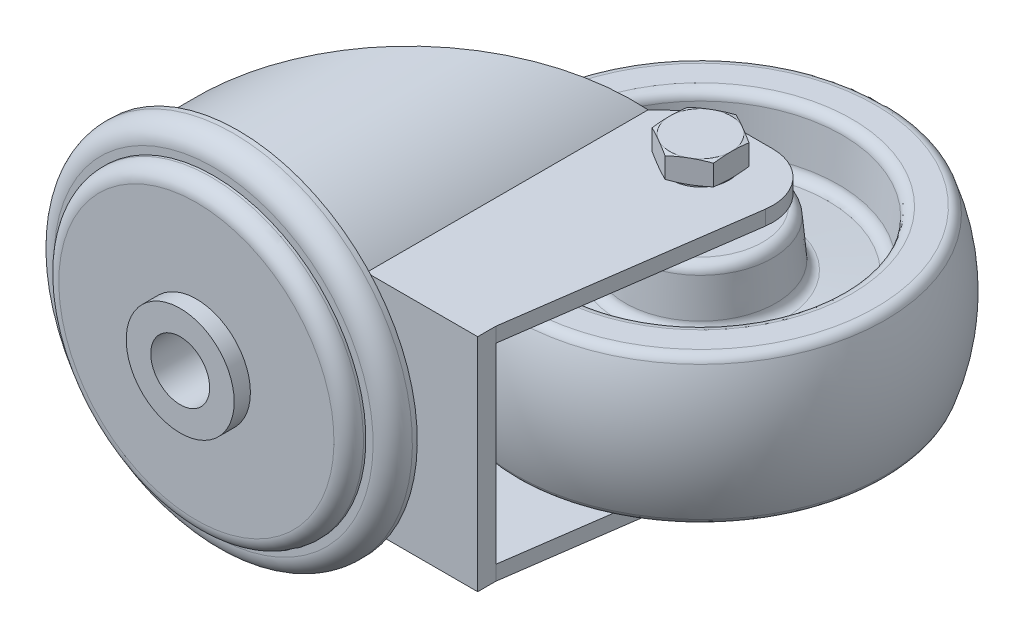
ISO-10303-21;
HEADER;
FILE_DESCRIPTION(('STEP AP214'),'2;1');
FILE_NAME('part.step','',(''),(''),'','','');
FILE_SCHEMA(('AUTOMOTIVE_DESIGN { 1 0 10303 214 1 1 1 1 }'));
ENDSEC;
DATA;
#1=APPLICATION_CONTEXT('core data for automotive mechanical design processes');
#2=APPLICATION_PROTOCOL_DEFINITION('international standard','automotive_design',2000,#1);
#3=PRODUCT_CONTEXT('',#1,'mechanical');
#4=PRODUCT('Part','Part','',(#3));
#5=PRODUCT_RELATED_PRODUCT_CATEGORY('part','',(#4));
#6=PRODUCT_DEFINITION_FORMATION('','',#4);
#7=PRODUCT_DEFINITION_CONTEXT('part definition',#1,'design');
#8=PRODUCT_DEFINITION('design','',#6,#7);
#9=PRODUCT_DEFINITION_SHAPE('','',#8);
#10=(LENGTH_UNIT() NAMED_UNIT(*) SI_UNIT(.MILLI.,.METRE.));
#11=(NAMED_UNIT(*) PLANE_ANGLE_UNIT() SI_UNIT($,.RADIAN.));
#12=(NAMED_UNIT(*) SI_UNIT($,.STERADIAN.) SOLID_ANGLE_UNIT());
#13=UNCERTAINTY_MEASURE_WITH_UNIT(LENGTH_MEASURE(1.E-05),#10,'distance_accuracy_value','');
#14=(GEOMETRIC_REPRESENTATION_CONTEXT(3) GLOBAL_UNCERTAINTY_ASSIGNED_CONTEXT((#13)) GLOBAL_UNIT_ASSIGNED_CONTEXT((#10,
#11,#12)) REPRESENTATION_CONTEXT('',''));
#15=CARTESIAN_POINT('',(0.,0.,0.));
#16=DIRECTION('',(0.,0.,1.));
#17=DIRECTION('',(1.,0.,0.));
#18=AXIS2_PLACEMENT_3D('',#15,#16,#17);
#19=CARTESIAN_POINT('',(26.332662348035,-15.,-67.));
#20=DIRECTION('',(0.,-1.,0.));
#21=DIRECTION('',(1.,0.,0.));
#22=AXIS2_PLACEMENT_3D('',#19,#20,#21);
#23=PLANE('',#22);
#24=CARTESIAN_POINT('',(39.,-15.,-67.));
#25=DIRECTION('',(0.,1.,0.));
#26=DIRECTION('',(-1.,0.,0.));
#27=AXIS2_PLACEMENT_3D('',#24,#25,#26);
#28=CIRCLE('',#27,6.);
#29=CARTESIAN_POINT('',(33.,-15.,-67.));
#30=VERTEX_POINT('',#29);
#31=EDGE_CURVE('E9',#30,#30,#28,.T.);
#32=ORIENTED_EDGE('',*,*,#31,.T.);
#33=EDGE_LOOP('',(#32));
#34=FACE_BOUND('',#33,.T.);
#35=CARTESIAN_POINT('',(39.,-15.,-67.));
#36=DIRECTION('',(0.,1.,0.));
#37=DIRECTION('',(-1.,0.,0.));
#38=AXIS2_PLACEMENT_3D('',#35,#36,#37);
#39=CIRCLE('',#38,12.667337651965);
#40=CARTESIAN_POINT('',(26.332662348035,-15.,-67.));
#41=VERTEX_POINT('',#40);
#42=EDGE_CURVE('E2648',#41,#41,#39,.T.);
#43=ORIENTED_EDGE('',*,*,#42,.F.);
#44=EDGE_LOOP('',(#43));
#45=FACE_BOUND('',#44,.T.);
#46=ADVANCED_FACE('F14',(#34,#45),#23,.T.);
#47=CARTESIAN_POINT('',(33.,15.,-67.));
#48=DIRECTION('',(0.,1.,0.));
#49=DIRECTION('',(-1.,0.,0.));
#50=AXIS2_PLACEMENT_3D('',#47,#48,#49);
#51=PLANE('',#50);
#52=CARTESIAN_POINT('',(39.,15.,-67.));
#53=DIRECTION('',(0.,1.,0.));
#54=DIRECTION('',(-1.,0.,0.));
#55=AXIS2_PLACEMENT_3D('',#52,#53,#54);
#56=CIRCLE('',#55,12.667337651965);
#57=CARTESIAN_POINT('',(26.332662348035,15.,-67.));
#58=VERTEX_POINT('',#57);
#59=EDGE_CURVE('E2603',#58,#58,#56,.T.);
#60=ORIENTED_EDGE('',*,*,#59,.T.);
#61=EDGE_LOOP('',(#60));
#62=FACE_BOUND('',#61,.T.);
#63=CARTESIAN_POINT('',(39.,15.,-67.));
#64=DIRECTION('',(0.,1.,0.));
#65=DIRECTION('',(-1.,0.,0.));
#66=AXIS2_PLACEMENT_3D('',#63,#64,#65);
#67=CIRCLE('',#66,6.);
#68=CARTESIAN_POINT('',(33.,15.,-67.));
#69=VERTEX_POINT('',#68);
#70=EDGE_CURVE('E24',#69,#69,#67,.T.);
#71=ORIENTED_EDGE('',*,*,#70,.F.);
#72=EDGE_LOOP('',(#71));
#73=FACE_BOUND('',#72,.T.);
#74=ADVANCED_FACE('F1235',(#62,#73),#51,.T.);
#75=CARTESIAN_POINT('',(39.,12.999999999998,-67.));
#76=DIRECTION('',(0.,1.,0.));
#77=DIRECTION('',(-1.,0.,0.));
#78=AXIS2_PLACEMENT_3D('',#75,#76,#77);
#79=TOROIDAL_SURFACE('',#78,12.6673376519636,2.00000000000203);
#80=CARTESIAN_POINT('',(39.,13.174311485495,-67.));
#81=DIRECTION('',(0.,1.,0.));
#82=DIRECTION('',(-1.,0.,0.));
#83=AXIS2_PLACEMENT_3D('',#80,#81,#82);
#84=CIRCLE('',#83,14.659727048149);
#85=CARTESIAN_POINT('',(24.340272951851,13.174311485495,-67.));
#86=VERTEX_POINT('',#85);
#87=EDGE_CURVE('E2606',#86,#86,#84,.T.);
#88=ORIENTED_EDGE('',*,*,#87,.T.);
#89=EDGE_LOOP('',(#88));
#90=FACE_BOUND('',#89,.T.);
#91=ORIENTED_EDGE('',*,*,#59,.F.);
#92=EDGE_LOOP('',(#91));
#93=FACE_BOUND('',#92,.T.);
#94=ADVANCED_FACE('F1224',(#90,#93),#79,.T.);
#95=CARTESIAN_POINT('',(39.,13.174311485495,-67.));
#96=DIRECTION('',(0.,-1.,0.));
#97=DIRECTION('',(1.,0.,0.));
#98=AXIS2_PLACEMENT_3D('',#95,#96,#97);
#99=CONICAL_SURFACE('',#98,14.659727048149,0.0872664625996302);
#100=CARTESIAN_POINT('',(39.,5.5682378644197,-67.));
#101=DIRECTION('',(0.,1.,0.));
#102=DIRECTION('',(-1.,0.,0.));
#103=AXIS2_PLACEMENT_3D('',#100,#101,#102);
#104=CIRCLE('',#103,15.325172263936);
#105=CARTESIAN_POINT('',(23.674827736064,5.5682378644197,-67.));
#106=VERTEX_POINT('',#105);
#107=EDGE_CURVE('E2609',#106,#106,#104,.T.);
#108=ORIENTED_EDGE('',*,*,#107,.T.);
#109=EDGE_LOOP('',(#108));
#110=FACE_BOUND('',#109,.T.);
#111=ORIENTED_EDGE('',*,*,#87,.F.);
#112=EDGE_LOOP('',(#111));
#113=FACE_BOUND('',#112,.T.);
#114=ADVANCED_FACE('F1213',(#110,#113),#99,.T.);
#115=CARTESIAN_POINT('',(39.,5.74254934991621,-67.));
#116=DIRECTION('',(0.,1.,0.));
#117=DIRECTION('',(-1.,0.,0.));
#118=AXIS2_PLACEMENT_3D('',#115,#116,#117);
#119=TOROIDAL_SURFACE('',#118,17.3175616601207,2.00000000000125);
#120=CARTESIAN_POINT('',(39.,3.7501599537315,-67.));
#121=DIRECTION('',(0.,1.,0.));
#122=DIRECTION('',(-1.,0.,0.));
#123=AXIS2_PLACEMENT_3D('',#120,#121,#122);
#124=CIRCLE('',#123,17.143250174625);
#125=CARTESIAN_POINT('',(21.856749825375,3.7501599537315,-67.));
#126=VERTEX_POINT('',#125);
#127=EDGE_CURVE('E2612',#126,#126,#124,.T.);
#128=ORIENTED_EDGE('',*,*,#127,.T.);
#129=EDGE_LOOP('',(#128));
#130=FACE_BOUND('',#129,.T.);
#131=ORIENTED_EDGE('',*,*,#107,.F.);
#132=EDGE_LOOP('',(#131));
#133=FACE_BOUND('',#132,.T.);
#134=ADVANCED_FACE('F1202',(#130,#133),#119,.F.);
#135=CARTESIAN_POINT('',(39.,3.7501599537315,-67.));
#136=DIRECTION('',(0.,-1.,0.));
#137=DIRECTION('',(1.,0.,0.));
#138=AXIS2_PLACEMENT_3D('',#135,#136,#137);
#139=CONICAL_SURFACE('',#138,17.143250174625,1.48352986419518);
#140=CARTESIAN_POINT('',(39.,2.9804751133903,-67.));
#141=DIRECTION('',(0.,1.,0.));
#142=DIRECTION('',(-1.,0.,0.));
#143=AXIS2_PLACEMENT_3D('',#140,#141,#142);
#144=CIRCLE('',#143,25.940788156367);
#145=CARTESIAN_POINT('',(13.059211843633,2.9804751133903,-67.));
#146=VERTEX_POINT('',#145);
#147=EDGE_CURVE('E2615',#146,#146,#144,.T.);
#148=ORIENTED_EDGE('',*,*,#147,.T.);
#149=EDGE_LOOP('',(#148));
#150=FACE_BOUND('',#149,.T.);
#151=ORIENTED_EDGE('',*,*,#127,.F.);
#152=EDGE_LOOP('',(#151));
#153=FACE_BOUND('',#152,.T.);
#154=ADVANCED_FACE('F1191',(#150,#153),#139,.T.);
#155=CARTESIAN_POINT('',(39.,4.97286450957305,-67.));
#156=DIRECTION('',(0.,1.,0.));
#157=DIRECTION('',(-1.,0.,0.));
#158=AXIS2_PLACEMENT_3D('',#155,#156,#157);
#159=TOROIDAL_SURFACE('',#158,26.1150996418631,1.99999999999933);
#160=CARTESIAN_POINT('',(39.,4.7985530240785,-67.));
#161=DIRECTION('',(0.,1.,0.));
#162=DIRECTION('',(-1.,0.,0.));
#163=AXIS2_PLACEMENT_3D('',#160,#161,#162);
#164=CIRCLE('',#163,28.107489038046);
#165=CARTESIAN_POINT('',(10.892510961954,4.7985530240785,-67.));
#166=VERTEX_POINT('',#165);
#167=EDGE_CURVE('E2618',#166,#166,#164,.T.);
#168=ORIENTED_EDGE('',*,*,#167,.T.);
#169=EDGE_LOOP('',(#168));
#170=FACE_BOUND('',#169,.T.);
#171=ORIENTED_EDGE('',*,*,#147,.F.);
#172=EDGE_LOOP('',(#171));
#173=FACE_BOUND('',#172,.T.);
#174=ADVANCED_FACE('F1180',(#170,#173),#159,.F.);
#175=CARTESIAN_POINT('',(39.,4.7985530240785,-67.));
#176=DIRECTION('',(0.,1.,0.));
#177=DIRECTION('',(-1.,0.,0.));
#178=AXIS2_PLACEMENT_3D('',#175,#176,#177);
#179=CONICAL_SURFACE('',#178,28.107489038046,0.0872664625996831);
#180=CARTESIAN_POINT('',(39.,13.174311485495,-67.));
#181=DIRECTION('',(0.,1.,0.));
#182=DIRECTION('',(-1.,0.,0.));
#183=AXIS2_PLACEMENT_3D('',#180,#181,#182);
#184=CIRCLE('',#183,28.840272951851);
#185=CARTESIAN_POINT('',(10.159727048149,13.174311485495,-67.));
#186=VERTEX_POINT('',#185);
#187=EDGE_CURVE('E2621',#186,#186,#184,.T.);
#188=ORIENTED_EDGE('',*,*,#187,.T.);
#189=EDGE_LOOP('',(#188));
#190=FACE_BOUND('',#189,.T.);
#191=ORIENTED_EDGE('',*,*,#167,.F.);
#192=EDGE_LOOP('',(#191));
#193=FACE_BOUND('',#192,.T.);
#194=ADVANCED_FACE('F1169',(#190,#193),#179,.F.);
#195=CARTESIAN_POINT('',(39.,12.999999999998,-67.));
#196=DIRECTION('',(0.,1.,0.));
#197=DIRECTION('',(-1.,0.,0.));
#198=AXIS2_PLACEMENT_3D('',#195,#196,#197);
#199=TOROIDAL_SURFACE('',#198,30.8326623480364,2.00000000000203);
#200=CARTESIAN_POINT('',(39.,15.,-67.));
#201=DIRECTION('',(0.,1.,0.));
#202=DIRECTION('',(-1.,0.,0.));
#203=AXIS2_PLACEMENT_3D('',#200,#201,#202);
#204=CIRCLE('',#203,30.832662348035);
#205=CARTESIAN_POINT('',(8.167337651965,15.,-67.));
#206=VERTEX_POINT('',#205);
#207=EDGE_CURVE('E2624',#206,#206,#204,.T.);
#208=ORIENTED_EDGE('',*,*,#207,.T.);
#209=EDGE_LOOP('',(#208));
#210=FACE_BOUND('',#209,.T.);
#211=ORIENTED_EDGE('',*,*,#187,.F.);
#212=EDGE_LOOP('',(#211));
#213=FACE_BOUND('',#212,.T.);
#214=ADVANCED_FACE('F1158',(#210,#213),#199,.T.);
#215=CARTESIAN_POINT('',(8.167337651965,15.,-67.));
#216=DIRECTION('',(0.,1.,0.));
#217=DIRECTION('',(-1.,0.,0.));
#218=AXIS2_PLACEMENT_3D('',#215,#216,#217);
#219=PLANE('',#218);
#220=CARTESIAN_POINT('',(39.,15.,-67.));
#221=DIRECTION('',(0.,1.,0.));
#222=DIRECTION('',(-1.,0.,0.));
#223=AXIS2_PLACEMENT_3D('',#220,#221,#222);
#224=CIRCLE('',#223,35.707142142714);
#225=CARTESIAN_POINT('',(3.292857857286,15.,-67.));
#226=VERTEX_POINT('',#225);
#227=EDGE_CURVE('E2651',#226,#226,#224,.T.);
#228=ORIENTED_EDGE('',*,*,#227,.T.);
#229=EDGE_LOOP('',(#228));
#230=FACE_BOUND('',#229,.T.);
#231=ORIENTED_EDGE('',*,*,#207,.F.);
#232=EDGE_LOOP('',(#231));
#233=FACE_BOUND('',#232,.T.);
#234=ADVANCED_FACE('F1147',(#230,#233),#219,.T.);
#235=CARTESIAN_POINT('',(5.,-15.,-67.));
#236=DIRECTION('',(0.,-1.,0.));
#237=DIRECTION('',(1.,0.,0.));
#238=AXIS2_PLACEMENT_3D('',#235,#236,#237);
#239=PLANE('',#238);
#240=CARTESIAN_POINT('',(39.,-15.,-67.));
#241=DIRECTION('',(0.,1.,0.));
#242=DIRECTION('',(-1.,0.,0.));
#243=AXIS2_PLACEMENT_3D('',#240,#241,#242);
#244=CIRCLE('',#243,30.832662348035);
#245=CARTESIAN_POINT('',(8.167337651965,-15.,-67.));
#246=VERTEX_POINT('',#245);
#247=EDGE_CURVE('E2627',#246,#246,#244,.T.);
#248=ORIENTED_EDGE('',*,*,#247,.T.);
#249=EDGE_LOOP('',(#248));
#250=FACE_BOUND('',#249,.T.);
#251=CARTESIAN_POINT('',(39.,-15.,-67.));
#252=DIRECTION('',(0.,1.,0.));
#253=DIRECTION('',(-1.,0.,0.));
#254=AXIS2_PLACEMENT_3D('',#251,#252,#253);
#255=CIRCLE('',#254,35.707142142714);
#256=CARTESIAN_POINT('',(3.292857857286,-15.,-67.));
#257=VERTEX_POINT('',#256);
#258=EDGE_CURVE('E2438',#257,#257,#255,.T.);
#259=ORIENTED_EDGE('',*,*,#258,.F.);
#260=EDGE_LOOP('',(#259));
#261=FACE_BOUND('',#260,.T.);
#262=ADVANCED_FACE('F1136',(#250,#261),#239,.T.);
#263=CARTESIAN_POINT('',(39.,-12.999999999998,-67.));
#264=DIRECTION('',(0.,1.,0.));
#265=DIRECTION('',(-1.,0.,0.));
#266=AXIS2_PLACEMENT_3D('',#263,#264,#265);
#267=TOROIDAL_SURFACE('',#266,30.8326623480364,2.00000000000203);
#268=CARTESIAN_POINT('',(39.,-13.174311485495,-67.));
#269=DIRECTION('',(0.,1.,0.));
#270=DIRECTION('',(-1.,0.,0.));
#271=AXIS2_PLACEMENT_3D('',#268,#269,#270);
#272=CIRCLE('',#271,28.840272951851);
#273=CARTESIAN_POINT('',(10.159727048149,-13.174311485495,-67.));
#274=VERTEX_POINT('',#273);
#275=EDGE_CURVE('E2630',#274,#274,#272,.T.);
#276=ORIENTED_EDGE('',*,*,#275,.T.);
#277=EDGE_LOOP('',(#276));
#278=FACE_BOUND('',#277,.T.);
#279=ORIENTED_EDGE('',*,*,#247,.F.);
#280=EDGE_LOOP('',(#279));
#281=FACE_BOUND('',#280,.T.);
#282=ADVANCED_FACE('F1125',(#278,#281),#267,.T.);
#283=CARTESIAN_POINT('',(39.,-13.174311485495,-67.));
#284=DIRECTION('',(0.,-1.,0.));
#285=DIRECTION('',(1.,0.,0.));
#286=AXIS2_PLACEMENT_3D('',#283,#284,#285);
#287=CONICAL_SURFACE('',#286,28.840272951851,0.0872664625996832);
#288=CARTESIAN_POINT('',(39.,-4.7985530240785,-67.));
#289=DIRECTION('',(0.,1.,0.));
#290=DIRECTION('',(-1.,0.,0.));
#291=AXIS2_PLACEMENT_3D('',#288,#289,#290);
#292=CIRCLE('',#291,28.107489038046);
#293=CARTESIAN_POINT('',(10.892510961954,-4.7985530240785,-67.));
#294=VERTEX_POINT('',#293);
#295=EDGE_CURVE('E2633',#294,#294,#292,.T.);
#296=ORIENTED_EDGE('',*,*,#295,.T.);
#297=EDGE_LOOP('',(#296));
#298=FACE_BOUND('',#297,.T.);
#299=ORIENTED_EDGE('',*,*,#275,.F.);
#300=EDGE_LOOP('',(#299));
#301=FACE_BOUND('',#300,.T.);
#302=ADVANCED_FACE('F1114',(#298,#301),#287,.F.);
#303=CARTESIAN_POINT('',(39.,-4.97286450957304,-67.));
#304=DIRECTION('',(0.,1.,0.));
#305=DIRECTION('',(-1.,0.,0.));
#306=AXIS2_PLACEMENT_3D('',#303,#304,#305);
#307=TOROIDAL_SURFACE('',#306,26.1150996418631,1.99999999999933);
#308=CARTESIAN_POINT('',(39.,-2.9804751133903,-67.));
#309=DIRECTION('',(0.,1.,0.));
#310=DIRECTION('',(-1.,0.,0.));
#311=AXIS2_PLACEMENT_3D('',#308,#309,#310);
#312=CIRCLE('',#311,25.940788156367);
#313=CARTESIAN_POINT('',(13.059211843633,-2.9804751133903,-67.));
#314=VERTEX_POINT('',#313);
#315=EDGE_CURVE('E2636',#314,#314,#312,.T.);
#316=ORIENTED_EDGE('',*,*,#315,.T.);
#317=EDGE_LOOP('',(#316));
#318=FACE_BOUND('',#317,.T.);
#319=ORIENTED_EDGE('',*,*,#295,.F.);
#320=EDGE_LOOP('',(#319));
#321=FACE_BOUND('',#320,.T.);
#322=ADVANCED_FACE('F1103',(#318,#321),#307,.F.);
#323=CARTESIAN_POINT('',(39.,-2.9804751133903,-67.));
#324=DIRECTION('',(0.,1.,0.));
#325=DIRECTION('',(-1.,0.,0.));
#326=AXIS2_PLACEMENT_3D('',#323,#324,#325);
#327=CONICAL_SURFACE('',#326,25.940788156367,1.48352986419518);
#328=CARTESIAN_POINT('',(39.,-3.7501599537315,-67.));
#329=DIRECTION('',(0.,1.,0.));
#330=DIRECTION('',(-1.,0.,0.));
#331=AXIS2_PLACEMENT_3D('',#328,#329,#330);
#332=CIRCLE('',#331,17.143250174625);
#333=CARTESIAN_POINT('',(21.856749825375,-3.7501599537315,-67.));
#334=VERTEX_POINT('',#333);
#335=EDGE_CURVE('E2639',#334,#334,#332,.T.);
#336=ORIENTED_EDGE('',*,*,#335,.T.);
#337=EDGE_LOOP('',(#336));
#338=FACE_BOUND('',#337,.T.);
#339=ORIENTED_EDGE('',*,*,#315,.F.);
#340=EDGE_LOOP('',(#339));
#341=FACE_BOUND('',#340,.T.);
#342=ADVANCED_FACE('F1092',(#338,#341),#327,.T.);
#343=CARTESIAN_POINT('',(39.,-5.74254934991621,-67.));
#344=DIRECTION('',(0.,1.,0.));
#345=DIRECTION('',(-1.,0.,0.));
#346=AXIS2_PLACEMENT_3D('',#343,#344,#345);
#347=TOROIDAL_SURFACE('',#346,17.3175616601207,2.00000000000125);
#348=CARTESIAN_POINT('',(39.,-5.5682378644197,-67.));
#349=DIRECTION('',(0.,1.,0.));
#350=DIRECTION('',(-1.,0.,0.));
#351=AXIS2_PLACEMENT_3D('',#348,#349,#350);
#352=CIRCLE('',#351,15.325172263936);
#353=CARTESIAN_POINT('',(23.674827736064,-5.5682378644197,-67.));
#354=VERTEX_POINT('',#353);
#355=EDGE_CURVE('E2642',#354,#354,#352,.T.);
#356=ORIENTED_EDGE('',*,*,#355,.T.);
#357=EDGE_LOOP('',(#356));
#358=FACE_BOUND('',#357,.T.);
#359=ORIENTED_EDGE('',*,*,#335,.F.);
#360=EDGE_LOOP('',(#359));
#361=FACE_BOUND('',#360,.T.);
#362=ADVANCED_FACE('F1081',(#358,#361),#347,.F.);
#363=CARTESIAN_POINT('',(39.,-5.5682378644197,-67.));
#364=DIRECTION('',(0.,1.,0.));
#365=DIRECTION('',(-1.,0.,0.));
#366=AXIS2_PLACEMENT_3D('',#363,#364,#365);
#367=CONICAL_SURFACE('',#366,15.325172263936,0.0872664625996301);
#368=CARTESIAN_POINT('',(39.,-13.174311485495,-67.));
#369=DIRECTION('',(0.,1.,0.));
#370=DIRECTION('',(-1.,0.,0.));
#371=AXIS2_PLACEMENT_3D('',#368,#369,#370);
#372=CIRCLE('',#371,14.659727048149);
#373=CARTESIAN_POINT('',(24.340272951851,-13.174311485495,-67.));
#374=VERTEX_POINT('',#373);
#375=EDGE_CURVE('E2645',#374,#374,#372,.T.);
#376=ORIENTED_EDGE('',*,*,#375,.T.);
#377=EDGE_LOOP('',(#376));
#378=FACE_BOUND('',#377,.T.);
#379=ORIENTED_EDGE('',*,*,#355,.F.);
#380=EDGE_LOOP('',(#379));
#381=FACE_BOUND('',#380,.T.);
#382=ADVANCED_FACE('F1070',(#378,#381),#367,.T.);
#383=CARTESIAN_POINT('',(39.,-12.999999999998,-67.));
#384=DIRECTION('',(0.,1.,0.));
#385=DIRECTION('',(-1.,0.,0.));
#386=AXIS2_PLACEMENT_3D('',#383,#384,#385);
#387=TOROIDAL_SURFACE('',#386,12.6673376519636,2.00000000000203);
#388=ORIENTED_EDGE('',*,*,#42,.T.);
#389=EDGE_LOOP('',(#388));
#390=FACE_BOUND('',#389,.T.);
#391=ORIENTED_EDGE('',*,*,#375,.F.);
#392=EDGE_LOOP('',(#391));
#393=FACE_BOUND('',#392,.T.);
#394=ADVANCED_FACE('F1059',(#390,#393),#387,.T.);
#395=CARTESIAN_POINT('',(39.,12.9999999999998,-67.));
#396=DIRECTION('',(0.,1.,0.));
#397=DIRECTION('',(-1.,0.,0.));
#398=AXIS2_PLACEMENT_3D('',#395,#396,#397);
#399=TOROIDAL_SURFACE('',#398,35.7071421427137,2.0000000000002);
#400=CARTESIAN_POINT('',(39.,13.684210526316,-67.));
#401=DIRECTION('',(0.,1.,0.));
#402=DIRECTION('',(-1.,0.,0.));
#403=AXIS2_PLACEMENT_3D('',#400,#401,#402);
#404=CIRCLE('',#403,37.586465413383);
#405=CARTESIAN_POINT('',(1.413534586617,13.684210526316,-67.));
#406=VERTEX_POINT('',#405);
#407=EDGE_CURVE('E2654',#406,#406,#404,.T.);
#408=ORIENTED_EDGE('',*,*,#407,.T.);
#409=EDGE_LOOP('',(#408));
#410=FACE_BOUND('',#409,.T.);
#411=ORIENTED_EDGE('',*,*,#227,.F.);
#412=EDGE_LOOP('',(#411));
#413=FACE_BOUND('',#412,.T.);
#414=ADVANCED_FACE('F1048',(#410,#413),#399,.T.);
#415=CARTESIAN_POINT('',(38.9999999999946,0.,-67.));
#416=DIRECTION('',(0.,1.,0.));
#417=DIRECTION('',(-1.,0.,0.));
#418=AXIS2_PLACEMENT_3D('',#415,#416,#417);
#419=SPHERICAL_SURFACE('',#418,39.9999999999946);
#420=CARTESIAN_POINT('',(39.,-13.684210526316,-67.));
#421=DIRECTION('',(0.,1.,0.));
#422=DIRECTION('',(-1.,0.,0.));
#423=AXIS2_PLACEMENT_3D('',#420,#421,#422);
#424=CIRCLE('',#423,37.586465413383);
#425=CARTESIAN_POINT('',(1.413534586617,-13.684210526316,-67.));
#426=VERTEX_POINT('',#425);
#427=EDGE_CURVE('E2441',#426,#426,#424,.T.);
#428=CARTESIAN_POINT('',(1.413534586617,-13.684210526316,-67.));
#429=CARTESIAN_POINT('',(1.3139938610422,-13.4108032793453,-67.));
#430=CARTESIAN_POINT('',(1.21743733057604,-13.1363095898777,-67.));
#431=CARTESIAN_POINT('',(1.0303363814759,-12.5852808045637,-67.));
#432=CARTESIAN_POINT('',(0.939791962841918,-12.3087457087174,-67.));
#433=CARTESIAN_POINT('',(0.764758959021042,-11.7537655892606,-67.));
#434=CARTESIAN_POINT('',(0.680270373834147,-11.4753205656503,-67.));
#435=CARTESIAN_POINT('',(0.517389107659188,-10.9166532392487,-67.));
#436=CARTESIAN_POINT('',(0.438996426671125,-10.6364309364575,-67.));
#437=CARTESIAN_POINT('',(0.288344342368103,-10.0743424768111,-67.));
#438=CARTESIAN_POINT('',(0.216084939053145,-9.79247631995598,-67.));
#439=CARTESIAN_POINT('',(0.0777338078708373,-9.22723437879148,-67.));
#440=CARTESIAN_POINT('',(0.0116420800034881,-8.94385859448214,-67.));
#441=CARTESIAN_POINT('',(-0.11434222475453,-8.37573233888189,-67.));
#442=CARTESIAN_POINT('',(-0.174234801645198,-8.09098186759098,-67.));
#443=CARTESIAN_POINT('',(-0.287792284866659,-7.52024183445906,-67.));
#444=CARTESIAN_POINT('',(-0.341457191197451,-7.23425227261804,-67.));
#445=CARTESIAN_POINT('',(-0.442533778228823,-6.66117024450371,-67.));
#446=CARTESIAN_POINT('',(-0.489945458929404,-6.37407777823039,-67.));
#447=CARTESIAN_POINT('',(-0.578493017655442,-5.79892665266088,-67.));
#448=CARTESIAN_POINT('',(-0.619628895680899,-5.51086799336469,-67.));
#449=CARTESIAN_POINT('',(-0.695605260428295,-4.93392165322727,-67.));
#450=CARTESIAN_POINT('',(-0.730445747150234,-4.64503397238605,-67.));
#451=CARTESIAN_POINT('',(-0.793814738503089,-4.06656715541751,-67.));
#452=CARTESIAN_POINT('',(-0.822343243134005,-3.77698801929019,-67.));
#453=CARTESIAN_POINT('',(-0.873074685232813,-3.1972761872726,-67.));
#454=CARTESIAN_POINT('',(-0.895277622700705,-2.90714349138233,-67.));
#455=CARTESIAN_POINT('',(-0.933347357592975,-2.32646269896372,-67.));
#456=CARTESIAN_POINT('',(-0.949214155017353,-2.03591460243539,-67.));
#457=CARTESIAN_POINT('',(-0.974604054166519,-1.4545413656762,-67.));
#458=CARTESIAN_POINT('',(-0.984127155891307,-1.16371622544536,-67.));
#459=CARTESIAN_POINT('',(-0.996825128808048,-0.581927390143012,-67.));
#460=CARTESIAN_POINT('',(-1.,-0.290963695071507,-67.));
#461=CARTESIAN_POINT('',(-1.,0.290963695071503,-67.));
#462=CARTESIAN_POINT('',(-0.996825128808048,0.581927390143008,-67.));
#463=CARTESIAN_POINT('',(-0.984127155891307,1.16371622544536,-67.));
#464=CARTESIAN_POINT('',(-0.974604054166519,1.4545413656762,-67.));
#465=CARTESIAN_POINT('',(-0.949214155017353,2.03591460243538,-67.));
#466=CARTESIAN_POINT('',(-0.933347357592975,2.32646269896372,-67.));
#467=CARTESIAN_POINT('',(-0.895277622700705,2.90714349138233,-67.));
#468=CARTESIAN_POINT('',(-0.873074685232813,3.19727618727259,-67.));
#469=CARTESIAN_POINT('',(-0.822343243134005,3.77698801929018,-67.));
#470=CARTESIAN_POINT('',(-0.793814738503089,4.06656715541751,-67.));
#471=CARTESIAN_POINT('',(-0.730445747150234,4.64503397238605,-67.));
#472=CARTESIAN_POINT('',(-0.695605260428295,4.93392165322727,-67.));
#473=CARTESIAN_POINT('',(-0.619628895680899,5.51086799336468,-67.));
#474=CARTESIAN_POINT('',(-0.578493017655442,5.79892665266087,-67.));
#475=CARTESIAN_POINT('',(-0.489945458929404,6.37407777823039,-67.));
#476=CARTESIAN_POINT('',(-0.442533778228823,6.66117024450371,-67.));
#477=CARTESIAN_POINT('',(-0.341457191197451,7.23425227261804,-67.));
#478=CARTESIAN_POINT('',(-0.287792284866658,7.52024183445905,-67.));
#479=CARTESIAN_POINT('',(-0.174234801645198,8.09098186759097,-67.));
#480=CARTESIAN_POINT('',(-0.11434222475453,8.37573233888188,-67.));
#481=CARTESIAN_POINT('',(0.0116420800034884,8.94385859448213,-67.));
#482=CARTESIAN_POINT('',(0.0777338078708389,9.22723437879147,-67.));
#483=CARTESIAN_POINT('',(0.216084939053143,9.79247631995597,-67.));
#484=CARTESIAN_POINT('',(0.288344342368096,10.0743424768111,-67.));
#485=CARTESIAN_POINT('',(0.438996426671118,10.6364309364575,-67.));
#486=CARTESIAN_POINT('',(0.517389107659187,10.9166532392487,-67.));
#487=CARTESIAN_POINT('',(0.680270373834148,11.4753205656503,-67.));
#488=CARTESIAN_POINT('',(0.764758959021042,11.7537655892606,-67.));
#489=CARTESIAN_POINT('',(0.939791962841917,12.3087457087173,-67.));
#490=CARTESIAN_POINT('',(1.0303363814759,12.5852808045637,-67.));
#491=CARTESIAN_POINT('',(1.21743733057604,13.1363095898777,-67.));
#492=CARTESIAN_POINT('',(1.3139938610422,13.4108032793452,-67.));
#493=CARTESIAN_POINT('',(1.413534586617,13.684210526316,-67.));
#494=B_SPLINE_CURVE_WITH_KNOTS('',3,(#428,#429,#430,#431,#432,#433,#434,#435,#436,#437,#438,
#439,#440,#441,#442,#443,#444,#445,#446,#447,#448,#449,#450,#451,#452,#453,#454,#455,#456,#457,
#458,#459,#460,#461,#462,#463,#464,#465,#466,#467,#468,#469,#470,#471,#472,#473,#474,#475,#476,
#477,#478,#479,#480,#481,#482,#483,#484,#485,#486,#487,#488,#489,#490,#491,#492,#493),
.UNSPECIFIED.,.F.,.F.,(4,2,2,2,2,2,2,2,2,2,2,2,2,2,2,2,2,2,2,2,2,2,2,2,2,2,2,2,2,2,2,2,4),(0.,
0.872873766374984,1.74574753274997,2.61862129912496,3.49149506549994,4.36436883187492,
5.23724259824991,6.1101163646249,6.98299013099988,7.85586389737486,8.72873766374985,
9.60161143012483,10.4744851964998,11.3473589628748,12.2202327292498,13.0931064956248,
13.9659802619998,14.8388540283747,15.7117277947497,16.5846015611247,17.4574753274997,
18.3303490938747,19.2032228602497,20.0760966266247,20.9489703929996,21.8218441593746,
22.6947179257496,23.5675916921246,24.4404654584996,25.3133392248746,26.1862129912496,
27.0590867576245,27.9319605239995),.UNSPECIFIED.);
#495=EDGE_CURVE('BSEAM1037',#426,#406,#494,.T.);
#496=ORIENTED_EDGE('',*,*,#427,.T.);
#497=ORIENTED_EDGE('',*,*,#407,.F.);
#498=ORIENTED_EDGE('',*,*,#495,.T.);
#499=ORIENTED_EDGE('',*,*,#495,.F.);
#500=EDGE_LOOP('',(#496,#498,#497,#499));
#501=FACE_BOUND('',#500,.T.);
#502=ADVANCED_FACE('F1037',(#501),#419,.T.);
#503=CARTESIAN_POINT('',(39.,-12.9999999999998,-67.));
#504=DIRECTION('',(0.,1.,0.));
#505=DIRECTION('',(-1.,0.,0.));
#506=AXIS2_PLACEMENT_3D('',#503,#504,#505);
#507=TOROIDAL_SURFACE('',#506,35.7071421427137,2.0000000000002);
#508=ORIENTED_EDGE('',*,*,#258,.T.);
#509=EDGE_LOOP('',(#508));
#510=FACE_BOUND('',#509,.T.);
#511=ORIENTED_EDGE('',*,*,#427,.F.);
#512=EDGE_LOOP('',(#511));
#513=FACE_BOUND('',#512,.T.);
#514=ADVANCED_FACE('F482',(#510,#513),#507,.T.);
#515=CARTESIAN_POINT('',(39.,-32.5,-70.233));
#516=DIRECTION('',(0.,-1.,0.));
#517=DIRECTION('',(-1.,0.,0.));
#518=AXIS2_PLACEMENT_3D('',#515,#516,#517);
#519=PLANE('',#518);
#520=CARTESIAN_POINT('',(39.,-32.5,-67.));
#521=DIRECTION('',(0.,1.,0.));
#522=DIRECTION('',(1.,0.,0.));
#523=AXIS2_PLACEMENT_3D('',#520,#521,#522);
#524=CIRCLE('',#523,3.233);
#525=CARTESIAN_POINT('',(42.233,-32.5,-67.));
#526=VERTEX_POINT('',#525);
#527=EDGE_CURVE('E741',#526,#526,#524,.T.);
#528=ORIENTED_EDGE('',*,*,#527,.F.);
#529=EDGE_LOOP('',(#528));
#530=FACE_BOUND('',#529,.T.);
#531=ADVANCED_FACE('F465',(#530),#519,.T.);
#532=CARTESIAN_POINT('',(39.,-31.733,-67.));
#533=DIRECTION('',(0.,1.,0.));
#534=DIRECTION('',(1.,0.,0.));
#535=AXIS2_PLACEMENT_3D('',#532,#533,#534);
#536=CONICAL_SURFACE('',#535,4.,0.78539816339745);
#537=ORIENTED_EDGE('',*,*,#527,.T.);
#538=EDGE_LOOP('',(#537));
#539=FACE_BOUND('',#538,.T.);
#540=CARTESIAN_POINT('',(39.,-31.733,-67.));
#541=DIRECTION('',(0.,1.,0.));
#542=DIRECTION('',(1.,0.,0.));
#543=AXIS2_PLACEMENT_3D('',#540,#541,#542);
#544=CIRCLE('',#543,4.);
#545=CARTESIAN_POINT('',(43.,-31.733,-67.));
#546=VERTEX_POINT('',#545);
#547=EDGE_CURVE('E739',#546,#546,#544,.T.);
#548=ORIENTED_EDGE('',*,*,#547,.F.);
#549=EDGE_LOOP('',(#548));
#550=FACE_BOUND('',#549,.T.);
#551=ADVANCED_FACE('F700',(#539,#550),#536,.T.);
#552=CARTESIAN_POINT('',(39.,-32.5,-67.));
#553=DIRECTION('',(0.,1.,0.));
#554=DIRECTION('',(1.,0.,0.));
#555=AXIS2_PLACEMENT_3D('',#552,#553,#554);
#556=CYLINDRICAL_SURFACE('',#555,4.);
#557=ORIENTED_EDGE('',*,*,#547,.T.);
#558=EDGE_LOOP('',(#557));
#559=FACE_BOUND('',#558,.T.);
#560=CARTESIAN_POINT('',(39.,-30.5,-67.));
#561=DIRECTION('',(0.,1.,0.));
#562=DIRECTION('',(1.,0.,0.));
#563=AXIS2_PLACEMENT_3D('',#560,#561,#562);
#564=CIRCLE('',#563,4.);
#565=CARTESIAN_POINT('',(43.,-30.5,-67.));
#566=VERTEX_POINT('',#565);
#567=EDGE_CURVE('E2387',#566,#566,#564,.T.);
#568=ORIENTED_EDGE('',*,*,#567,.F.);
#569=EDGE_LOOP('',(#568));
#570=FACE_BOUND('',#569,.T.);
#571=ADVANCED_FACE('F633',(#559,#570),#556,.T.);
#572=CARTESIAN_POINT('',(39.,27.8,-67.));
#573=DIRECTION('',(0.,1.,0.));
#574=DIRECTION('',(1.,0.,0.));
#575=AXIS2_PLACEMENT_3D('',#572,#573,#574);
#576=PLANE('',#575);
#577=CARTESIAN_POINT('',(39.,27.8,-67.));
#578=DIRECTION('',(0.,1.,0.));
#579=DIRECTION('',(1.,0.,0.));
#580=AXIS2_PLACEMENT_3D('',#577,#578,#579);
#581=CIRCLE('',#580,6.2583333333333);
#582=CARTESIAN_POINT('',(45.2583333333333,27.8,-67.));
#583=VERTEX_POINT('',#582);
#584=CARTESIAN_POINT('',(42.1291666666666,27.8,-72.4198756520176));
#585=VERTEX_POINT('',#584);
#586=EDGE_CURVE('E302',#583,#585,#581,.T.);
#587=ORIENTED_EDGE('',*,*,#586,.T.);
#588=CARTESIAN_POINT('',(35.8708333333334,27.8,-72.4198756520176));
#589=VERTEX_POINT('',#588);
#590=EDGE_CURVE('E312',#585,#589,#581,.T.);
#591=ORIENTED_EDGE('',*,*,#590,.T.);
#592=CARTESIAN_POINT('',(32.7416666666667,27.8,-67.));
#593=VERTEX_POINT('',#592);
#594=EDGE_CURVE('E316',#589,#593,#581,.T.);
#595=ORIENTED_EDGE('',*,*,#594,.T.);
#596=CARTESIAN_POINT('',(35.8708333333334,27.8,-61.5801243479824));
#597=VERTEX_POINT('',#596);
#598=EDGE_CURVE('E765',#593,#597,#581,.T.);
#599=ORIENTED_EDGE('',*,*,#598,.T.);
#600=CARTESIAN_POINT('',(42.1291666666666,27.8,-61.5801243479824));
#601=VERTEX_POINT('',#600);
#602=EDGE_CURVE('E305',#597,#601,#581,.T.);
#603=ORIENTED_EDGE('',*,*,#602,.T.);
#604=EDGE_CURVE('E294',#601,#583,#581,.T.);
#605=ORIENTED_EDGE('',*,*,#604,.T.);
#606=EDGE_LOOP('',(#587,#591,#595,#599,#603,#605));
#607=FACE_BOUND('',#606,.T.);
#608=ADVANCED_FACE('F300',(#607),#576,.T.);
#609=CARTESIAN_POINT('',(39.,-30.5,-71.));
#610=DIRECTION('',(0.,1.,0.));
#611=DIRECTION('',(1.,0.,0.));
#612=AXIS2_PLACEMENT_3D('',#609,#610,#611);
#613=PLANE('',#612);
#614=CARTESIAN_POINT('',(39.,-30.5,-67.));
#615=DIRECTION('',(0.,1.,0.));
#616=DIRECTION('',(1.,0.,0.));
#617=AXIS2_PLACEMENT_3D('',#614,#615,#616);
#618=CIRCLE('',#617,5.815);
#619=CARTESIAN_POINT('',(44.815,-30.5,-67.));
#620=VERTEX_POINT('',#619);
#621=EDGE_CURVE('E2384',#620,#620,#618,.T.);
#622=ORIENTED_EDGE('',*,*,#621,.F.);
#623=EDGE_LOOP('',(#622));
#624=FACE_BOUND('',#623,.T.);
#625=ORIENTED_EDGE('',*,*,#567,.T.);
#626=EDGE_LOOP('',(#625));
#627=FACE_BOUND('',#626,.T.);
#628=ADVANCED_FACE('F427',(#624,#627),#613,.F.);
#629=CARTESIAN_POINT('',(39.,27.8,-67.));
#630=DIRECTION('',(0.,-1.,0.));
#631=DIRECTION('',(-1.,0.,0.));
#632=AXIS2_PLACEMENT_3D('',#629,#630,#631);
#633=CONICAL_SURFACE('',#632,6.2583333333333,1.30899693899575);
#634=CARTESIAN_POINT('',(32.7416666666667,26.415610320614,-57.4416186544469));
#635=CARTESIAN_POINT('',(32.7416666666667,26.4792409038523,-57.7255412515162));
#636=CARTESIAN_POINT('',(32.7416666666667,26.5420932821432,-58.0096414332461));
#637=CARTESIAN_POINT('',(32.7416666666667,26.6658215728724,-58.5782841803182));
#638=CARTESIAN_POINT('',(32.7416666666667,26.7266973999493,-58.8628267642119));
#639=CARTESIAN_POINT('',(32.7416666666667,26.8461055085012,-59.4326964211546));
#640=CARTESIAN_POINT('',(32.7416666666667,26.9046354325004,-59.7180239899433));
#641=CARTESIAN_POINT('',(32.7416666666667,27.0187199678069,-60.2892730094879));
#642=CARTESIAN_POINT('',(32.7416666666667,27.0742746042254,-60.5751944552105));
#643=CARTESIAN_POINT('',(32.7416666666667,27.1812719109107,-61.1454542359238));
#644=CARTESIAN_POINT('',(32.7416666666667,27.2327437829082,-61.4297870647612));
#645=CARTESIAN_POINT('',(32.7416666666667,27.3311937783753,-61.9992282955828));
#646=CARTESIAN_POINT('',(32.7416666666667,27.3781720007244,-62.2843366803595));
#647=CARTESIAN_POINT('',(32.7416666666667,27.466576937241,-62.8553843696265));
#648=CARTESIAN_POINT('',(32.7416666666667,27.5080043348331,-63.1413235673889));
#649=CARTESIAN_POINT('',(32.7416666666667,27.5840868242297,-63.7141118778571));
#650=CARTESIAN_POINT('',(32.7416666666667,27.6187419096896,-64.0009609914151));
#651=CARTESIAN_POINT('',(32.7416666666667,27.6802984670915,-64.5788053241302));
#652=CARTESIAN_POINT('',(32.7416666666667,27.7071071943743,-64.8698105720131));
#653=CARTESIAN_POINT('',(32.7416666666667,27.7511216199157,-65.4525526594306));
#654=CARTESIAN_POINT('',(32.7416666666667,27.7683275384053,-65.7442894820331));
#655=CARTESIAN_POINT('',(32.7416666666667,27.7921328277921,-66.3280715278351));
#656=CARTESIAN_POINT('',(32.7416666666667,27.7987370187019,-66.6201165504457));
#657=CARTESIAN_POINT('',(32.7416666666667,27.8009328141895,-67.2042485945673));
#658=CARTESIAN_POINT('',(32.7416666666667,27.7965244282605,-67.4963356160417));
#659=CARTESIAN_POINT('',(32.7416666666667,27.7769429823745,-68.0812041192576));
#660=CARTESIAN_POINT('',(32.7416666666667,27.7617308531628,-68.3739842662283));
#661=CARTESIAN_POINT('',(32.7416666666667,27.7214102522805,-68.9588560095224));
#662=CARTESIAN_POINT('',(32.7416666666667,27.6963015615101,-69.2509475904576));
#663=CARTESIAN_POINT('',(32.7416666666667,27.6374561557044,-69.8344397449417));
#664=CARTESIAN_POINT('',(32.7416666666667,27.6037138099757,-70.1258397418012));
#665=CARTESIAN_POINT('',(32.7416666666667,27.5290051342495,-70.7077019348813));
#666=CARTESIAN_POINT('',(32.7416666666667,27.4880387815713,-70.9981641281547));
#667=CARTESIAN_POINT('',(32.7416666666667,27.4031009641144,-71.5589779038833));
#668=CARTESIAN_POINT('',(32.7416666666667,27.3595081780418,-71.8293874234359));
#669=CARTESIAN_POINT('',(32.7416666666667,27.2680911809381,-72.3694937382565));
#670=CARTESIAN_POINT('',(32.7416666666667,27.2202668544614,-72.6391905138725));
#671=CARTESIAN_POINT('',(32.7416666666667,27.1211609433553,-73.1779700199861));
#672=CARTESIAN_POINT('',(32.7416666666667,27.0698790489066,-73.447052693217));
#673=CARTESIAN_POINT('',(32.7416666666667,26.9644891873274,-73.9846653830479));
#674=CARTESIAN_POINT('',(32.7416666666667,26.9103811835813,-74.2531953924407));
#675=CARTESIAN_POINT('',(32.7416666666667,26.7445857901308,-75.0581940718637));
#676=CARTESIAN_POINT('',(32.7416666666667,26.6294495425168,-75.593951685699));
#677=CARTESIAN_POINT('',(32.7416666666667,26.3929441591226,-76.6640421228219));
#678=CARTESIAN_POINT('',(32.7416666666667,26.2715753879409,-77.1983750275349));
#679=CARTESIAN_POINT('',(32.7416666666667,26.0256612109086,-78.2607760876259));
#680=CARTESIAN_POINT('',(32.7416666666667,25.9011587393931,-78.7888542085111));
#681=CARTESIAN_POINT('',(32.7416666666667,25.6490368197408,-79.8442737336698));
#682=CARTESIAN_POINT('',(32.7416666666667,25.5214173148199,-80.3716151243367));
#683=CARTESIAN_POINT('',(32.7416666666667,25.2640342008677,-81.4250837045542));
#684=CARTESIAN_POINT('',(32.7416666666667,25.1342734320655,-81.9512115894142));
#685=CARTESIAN_POINT('',(32.7416666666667,24.8729800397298,-83.0030090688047));
#686=CARTESIAN_POINT('',(32.7416666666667,24.7414474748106,-83.5286786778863));
#687=CARTESIAN_POINT('',(32.7416666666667,24.6092874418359,-84.0541885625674));
#688=B_SPLINE_CURVE_WITH_KNOTS('',3,(#634,#635,#636,#637,#638,#639,#640,#641,#642,#643,#644,
#645,#646,#647,#648,#649,#650,#651,#652,#653,#654,#655,#656,#657,#658,#659,#660,#661,#662,#663,
#664,#665,#666,#667,#668,#669,#670,#671,#672,#673,#674,#675,#676,#677,#678,#679,#680,#681,#682,
#683,#684,#685,#686,#687),.UNSPECIFIED.,.F.,.F.,(4,2,2,2,2,2,2,2,2,2,2,2,2,2,2,2,2,2,2,2,2,2,2,
2,2,2,4),(0.,0.872899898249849,1.74583744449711,2.61963129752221,3.49341777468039,
4.36025148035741,5.22706610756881,6.09377391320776,6.96048253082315,7.83705637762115,
8.7136101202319,9.58976522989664,10.4659195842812,11.3452585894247,12.2246170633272,
13.1045505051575,13.9844867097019,14.8061494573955,15.6278346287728,16.4495935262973,
17.2713630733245,18.9152675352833,20.5590759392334,22.186731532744,23.814416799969,
25.4400934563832,27.065716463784),.UNSPECIFIED.);
#689=CARTESIAN_POINT('',(32.7416666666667,27.5405802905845,-70.6132504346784));
#690=VERTEX_POINT('',#689);
#691=EDGE_CURVE('E668',#593,#690,#688,.T.);
#692=ORIENTED_EDGE('',*,*,#691,.F.);
#693=ORIENTED_EDGE('',*,*,#594,.F.);
#694=CARTESIAN_POINT('',(32.7414666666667,27.5405493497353,-70.6131349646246));
#695=CARTESIAN_POINT('',(33.0013760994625,27.5807746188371,-70.7631937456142));
#696=CARTESIAN_POINT('',(33.2617567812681,27.6172925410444,-70.9135246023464));
#697=CARTESIAN_POINT('',(33.783437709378,27.6814511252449,-71.2147172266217));
#698=CARTESIAN_POINT('',(34.0447382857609,27.7090881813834,-71.3655791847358));
#699=CARTESIAN_POINT('',(34.5666747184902,27.7538715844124,-71.6669193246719));
#700=CARTESIAN_POINT('',(34.8273070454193,27.7710713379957,-71.817395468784));
#701=CARTESIAN_POINT('',(35.3489040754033,27.7941344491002,-72.1185396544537));
#702=CARTESIAN_POINT('',(35.6098687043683,27.8,-72.2692076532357));
#703=CARTESIAN_POINT('',(36.1317979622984,27.8,-72.5705436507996));
#704=CARTESIAN_POINT('',(36.3927625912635,27.7941344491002,-72.7212116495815));
#705=CARTESIAN_POINT('',(36.9143596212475,27.7710713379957,-73.0223558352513));
#706=CARTESIAN_POINT('',(37.1749919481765,27.7538715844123,-73.1728319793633));
#707=CARTESIAN_POINT('',(37.6969283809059,27.7090881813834,-73.4741721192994));
#708=CARTESIAN_POINT('',(37.9582289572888,27.6814511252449,-73.6250340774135));
#709=CARTESIAN_POINT('',(38.4799098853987,27.6172925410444,-73.9262267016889));
#710=CARTESIAN_POINT('',(38.7402905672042,27.5807746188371,-74.0765575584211));
#711=CARTESIAN_POINT('',(39.0002,27.5405493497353,-74.2266163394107));
#712=B_SPLINE_CURVE_WITH_KNOTS('',3,(#694,#695,#696,#697,#698,#699,#700,#701,#702,#703,#704,
#705,#706,#707,#708,#709,#710,#711),.UNSPECIFIED.,.F.,.F.,(4,2,2,2,2,2,2,2,4),(0.,
0.908451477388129,1.8172713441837,2.72140076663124,3.62535520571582,4.52930964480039,
5.43343906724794,6.34225893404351,7.25071041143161),.UNSPECIFIED.);
#713=EDGE_CURVE('E682',#690,#589,#712,.T.);
#714=ORIENTED_EDGE('',*,*,#713,.F.);
#715=EDGE_LOOP('',(#692,#693,#714));
#716=FACE_BOUND('',#715,.T.);
#717=ADVANCED_FACE('F538',(#716),#633,.T.);
#718=CARTESIAN_POINT('',(32.7416666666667,27.5405802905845,-63.3867495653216));
#719=VERTEX_POINT('',#718);
#720=EDGE_CURVE('E769',#719,#593,#688,.T.);
#721=ORIENTED_EDGE('',*,*,#720,.F.);
#722=CARTESIAN_POINT('',(39.0002,27.5405493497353,-59.7733836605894));
#723=CARTESIAN_POINT('',(38.7402905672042,27.5807746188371,-59.923442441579));
#724=CARTESIAN_POINT('',(38.4799098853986,27.6172925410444,-60.0737732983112));
#725=CARTESIAN_POINT('',(37.9582289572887,27.6814511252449,-60.3749659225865));
#726=CARTESIAN_POINT('',(37.6969283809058,27.7090881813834,-60.5258278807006));
#727=CARTESIAN_POINT('',(37.1749919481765,27.7538715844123,-60.8271680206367));
#728=CARTESIAN_POINT('',(36.9143596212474,27.7710713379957,-60.9776441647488));
#729=CARTESIAN_POINT('',(36.3927625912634,27.7941344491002,-61.2787883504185));
#730=CARTESIAN_POINT('',(36.1317979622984,27.8,-61.4294563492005));
#731=CARTESIAN_POINT('',(35.6098687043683,27.8,-61.7307923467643));
#732=CARTESIAN_POINT('',(35.3489040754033,27.7941344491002,-61.8814603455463));
#733=CARTESIAN_POINT('',(34.8273070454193,27.7710713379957,-62.182604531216));
#734=CARTESIAN_POINT('',(34.5666747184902,27.7538715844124,-62.3330806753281));
#735=CARTESIAN_POINT('',(34.0447382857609,27.7090881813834,-62.6344208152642));
#736=CARTESIAN_POINT('',(33.7834377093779,27.6814511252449,-62.7852827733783));
#737=CARTESIAN_POINT('',(33.2617567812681,27.6172925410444,-63.0864753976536));
#738=CARTESIAN_POINT('',(33.0013760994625,27.5807746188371,-63.2368062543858));
#739=CARTESIAN_POINT('',(32.7414666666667,27.5405493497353,-63.3868650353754));
#740=B_SPLINE_CURVE_WITH_KNOTS('',3,(#722,#723,#724,#725,#726,#727,#728,#729,#730,#731,#732,
#733,#734,#735,#736,#737,#738,#739),.UNSPECIFIED.,.F.,.F.,(4,2,2,2,2,2,2,2,4),(0.,
0.908451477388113,1.81727134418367,2.72140076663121,3.62535520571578,4.52930964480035,
5.43343906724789,6.34225893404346,7.25071041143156),.UNSPECIFIED.);
#741=EDGE_CURVE('E660',#597,#719,#740,.T.);
#742=ORIENTED_EDGE('',*,*,#741,.F.);
#743=ORIENTED_EDGE('',*,*,#598,.F.);
#744=EDGE_LOOP('',(#721,#742,#743));
#745=FACE_BOUND('',#744,.T.);
#746=ADVANCED_FACE('F636',(#745),#633,.T.);
#747=CARTESIAN_POINT('',(39.,27.5405802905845,-59.7734991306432));
#748=VERTEX_POINT('',#747);
#749=EDGE_CURVE('E773',#748,#597,#740,.T.);
#750=ORIENTED_EDGE('',*,*,#749,.F.);
#751=CARTESIAN_POINT('',(45.2585333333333,27.5405493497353,-63.3868650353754));
#752=CARTESIAN_POINT('',(44.9986239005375,27.5807746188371,-63.2368062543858));
#753=CARTESIAN_POINT('',(44.7382432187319,27.6172925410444,-63.0864753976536));
#754=CARTESIAN_POINT('',(44.2165622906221,27.6814511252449,-62.7852827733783));
#755=CARTESIAN_POINT('',(43.9552617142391,27.7090881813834,-62.6344208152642));
#756=CARTESIAN_POINT('',(43.4333252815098,27.7538715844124,-62.3330806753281));
#757=CARTESIAN_POINT('',(43.1726929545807,27.7710713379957,-62.182604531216));
#758=CARTESIAN_POINT('',(42.6510959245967,27.7941344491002,-61.8814603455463));
#759=CARTESIAN_POINT('',(42.3901312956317,27.8,-61.7307923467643));
#760=CARTESIAN_POINT('',(41.8682020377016,27.8,-61.4294563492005));
#761=CARTESIAN_POINT('',(41.6072374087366,27.7941344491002,-61.2787883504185));
#762=CARTESIAN_POINT('',(41.0856403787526,27.7710713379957,-60.9776441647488));
#763=CARTESIAN_POINT('',(40.8250080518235,27.7538715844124,-60.8271680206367));
#764=CARTESIAN_POINT('',(40.3030716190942,27.7090881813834,-60.5258278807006));
#765=CARTESIAN_POINT('',(40.0417710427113,27.6814511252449,-60.3749659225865));
#766=CARTESIAN_POINT('',(39.5200901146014,27.6172925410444,-60.0737732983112));
#767=CARTESIAN_POINT('',(39.2597094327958,27.5807746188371,-59.923442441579));
#768=CARTESIAN_POINT('',(38.9998,27.5405493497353,-59.7733836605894));
#769=B_SPLINE_CURVE_WITH_KNOTS('',3,(#751,#752,#753,#754,#755,#756,#757,#758,#759,#760,#761,
#762,#763,#764,#765,#766,#767,#768),.UNSPECIFIED.,.F.,.F.,(4,2,2,2,2,2,2,2,4),(0.,
0.908451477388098,1.81727134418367,2.7214007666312,3.62535520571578,4.52930964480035,
5.43343906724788,6.34225893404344,7.25071041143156),.UNSPECIFIED.);
#770=EDGE_CURVE('E651',#601,#748,#769,.T.);
#771=ORIENTED_EDGE('',*,*,#770,.F.);
#772=ORIENTED_EDGE('',*,*,#602,.F.);
#773=EDGE_LOOP('',(#750,#771,#772));
#774=FACE_BOUND('',#773,.T.);
#775=ADVANCED_FACE('F537',(#774),#633,.T.);
#776=CARTESIAN_POINT('',(45.2583333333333,27.5405802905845,-63.3867495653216));
#777=VERTEX_POINT('',#776);
#778=EDGE_CURVE('E296',#777,#601,#769,.T.);
#779=ORIENTED_EDGE('',*,*,#778,.F.);
#780=CARTESIAN_POINT('',(45.2583333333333,26.415610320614,-57.4416186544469));
#781=CARTESIAN_POINT('',(45.2583333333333,26.4792409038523,-57.7255412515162));
#782=CARTESIAN_POINT('',(45.2583333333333,26.5420932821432,-58.0096414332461));
#783=CARTESIAN_POINT('',(45.2583333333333,26.6658215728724,-58.5782841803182));
#784=CARTESIAN_POINT('',(45.2583333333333,26.7266973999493,-58.8628267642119));
#785=CARTESIAN_POINT('',(45.2583333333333,26.8461055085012,-59.4326964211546));
#786=CARTESIAN_POINT('',(45.2583333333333,26.9046354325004,-59.7180239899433));
#787=CARTESIAN_POINT('',(45.2583333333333,27.0187199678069,-60.2892730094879));
#788=CARTESIAN_POINT('',(45.2583333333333,27.0742746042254,-60.5751944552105));
#789=CARTESIAN_POINT('',(45.2583333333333,27.1812719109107,-61.1454542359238));
#790=CARTESIAN_POINT('',(45.2583333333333,27.2327437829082,-61.4297870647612));
#791=CARTESIAN_POINT('',(45.2583333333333,27.3311937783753,-61.9992282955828));
#792=CARTESIAN_POINT('',(45.2583333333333,27.3781720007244,-62.2843366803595));
#793=CARTESIAN_POINT('',(45.2583333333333,27.466576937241,-62.8553843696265));
#794=CARTESIAN_POINT('',(45.2583333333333,27.5080043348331,-63.1413235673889));
#795=CARTESIAN_POINT('',(45.2583333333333,27.5840868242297,-63.7141118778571));
#796=CARTESIAN_POINT('',(45.2583333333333,27.6187419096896,-64.0009609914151));
#797=CARTESIAN_POINT('',(45.2583333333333,27.6802984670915,-64.5788053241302));
#798=CARTESIAN_POINT('',(45.2583333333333,27.7071071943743,-64.8698105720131));
#799=CARTESIAN_POINT('',(45.2583333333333,27.7511216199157,-65.4525526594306));
#800=CARTESIAN_POINT('',(45.2583333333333,27.7683275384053,-65.7442894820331));
#801=CARTESIAN_POINT('',(45.2583333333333,27.7921328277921,-66.3280715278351));
#802=CARTESIAN_POINT('',(45.2583333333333,27.7987370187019,-66.6201165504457));
#803=CARTESIAN_POINT('',(45.2583333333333,27.8009328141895,-67.2042485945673));
#804=CARTESIAN_POINT('',(45.2583333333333,27.7965244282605,-67.4963356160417));
#805=CARTESIAN_POINT('',(45.2583333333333,27.7769429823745,-68.0812041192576));
#806=CARTESIAN_POINT('',(45.2583333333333,27.7617308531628,-68.3739842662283));
#807=CARTESIAN_POINT('',(45.2583333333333,27.7214102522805,-68.9588560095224));
#808=CARTESIAN_POINT('',(45.2583333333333,27.6963015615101,-69.2509475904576));
#809=CARTESIAN_POINT('',(45.2583333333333,27.6374561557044,-69.8344397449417));
#810=CARTESIAN_POINT('',(45.2583333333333,27.6037138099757,-70.1258397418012));
#811=CARTESIAN_POINT('',(45.2583333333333,27.5290051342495,-70.7077019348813));
#812=CARTESIAN_POINT('',(45.2583333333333,27.4880387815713,-70.9981641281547));
#813=CARTESIAN_POINT('',(45.2583333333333,27.4031009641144,-71.5589779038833));
#814=CARTESIAN_POINT('',(45.2583333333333,27.3595081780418,-71.8293874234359));
#815=CARTESIAN_POINT('',(45.2583333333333,27.2680911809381,-72.3694937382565));
#816=CARTESIAN_POINT('',(45.2583333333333,27.2202668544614,-72.6391905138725));
#817=CARTESIAN_POINT('',(45.2583333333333,27.1211609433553,-73.1779700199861));
#818=CARTESIAN_POINT('',(45.2583333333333,27.0698790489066,-73.447052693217));
#819=CARTESIAN_POINT('',(45.2583333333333,26.9644891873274,-73.9846653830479));
#820=CARTESIAN_POINT('',(45.2583333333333,26.9103811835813,-74.2531953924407));
#821=CARTESIAN_POINT('',(45.2583333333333,26.7445857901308,-75.0581940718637));
#822=CARTESIAN_POINT('',(45.2583333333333,26.6294495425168,-75.593951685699));
#823=CARTESIAN_POINT('',(45.2583333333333,26.3929441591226,-76.6640421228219));
#824=CARTESIAN_POINT('',(45.2583333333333,26.2715753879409,-77.1983750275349));
#825=CARTESIAN_POINT('',(45.2583333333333,26.0256612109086,-78.2607760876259));
#826=CARTESIAN_POINT('',(45.2583333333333,25.9011587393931,-78.7888542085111));
#827=CARTESIAN_POINT('',(45.2583333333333,25.6490368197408,-79.8442737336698));
#828=CARTESIAN_POINT('',(45.2583333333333,25.5214173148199,-80.3716151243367));
#829=CARTESIAN_POINT('',(45.2583333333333,25.2640342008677,-81.4250837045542));
#830=CARTESIAN_POINT('',(45.2583333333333,25.1342734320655,-81.9512115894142));
#831=CARTESIAN_POINT('',(45.2583333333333,24.8729800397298,-83.0030090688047));
#832=CARTESIAN_POINT('',(45.2583333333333,24.7414474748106,-83.5286786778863));
#833=CARTESIAN_POINT('',(45.2583333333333,24.6092874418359,-84.0541885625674));
#834=B_SPLINE_CURVE_WITH_KNOTS('',3,(#780,#781,#782,#783,#784,#785,#786,#787,#788,#789,#790,
#791,#792,#793,#794,#795,#796,#797,#798,#799,#800,#801,#802,#803,#804,#805,#806,#807,#808,#809,
#810,#811,#812,#813,#814,#815,#816,#817,#818,#819,#820,#821,#822,#823,#824,#825,#826,#827,#828,
#829,#830,#831,#832,#833),.UNSPECIFIED.,.F.,.F.,(4,2,2,2,2,2,2,2,2,2,2,2,2,2,2,2,2,2,2,2,2,2,2,
2,2,2,4),(0.,0.872899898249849,1.74583744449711,2.61963129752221,3.49341777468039,
4.36025148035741,5.22706610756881,6.09377391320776,6.96048253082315,7.83705637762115,
8.7136101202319,9.58976522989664,10.4659195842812,11.3452585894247,12.2246170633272,
13.1045505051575,13.9844867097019,14.8061494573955,15.6278346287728,16.4495935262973,
17.2713630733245,18.9152675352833,20.5590759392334,22.186731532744,23.814416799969,
25.4400934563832,27.065716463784),.UNSPECIFIED.);
#835=EDGE_CURVE('E280',#583,#777,#834,.F.);
#836=ORIENTED_EDGE('',*,*,#835,.F.);
#837=ORIENTED_EDGE('',*,*,#604,.F.);
#838=EDGE_LOOP('',(#779,#836,#837));
#839=FACE_BOUND('',#838,.T.);
#840=ADVANCED_FACE('F293',(#839),#633,.T.);
#841=CARTESIAN_POINT('',(38.9998,27.5405493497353,-74.2266163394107));
#842=CARTESIAN_POINT('',(39.2597094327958,27.5807746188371,-74.0765575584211));
#843=CARTESIAN_POINT('',(39.5200901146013,27.6172925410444,-73.9262267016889));
#844=CARTESIAN_POINT('',(40.0417710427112,27.6814511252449,-73.6250340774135));
#845=CARTESIAN_POINT('',(40.3030716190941,27.7090881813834,-73.4741721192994));
#846=CARTESIAN_POINT('',(40.8250080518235,27.7538715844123,-73.1728319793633));
#847=CARTESIAN_POINT('',(41.0856403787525,27.7710713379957,-73.0223558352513));
#848=CARTESIAN_POINT('',(41.6072374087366,27.7941344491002,-72.7212116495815));
#849=CARTESIAN_POINT('',(41.8682020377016,27.8,-72.5705436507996));
#850=CARTESIAN_POINT('',(42.3901312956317,27.8,-72.2692076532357));
#851=CARTESIAN_POINT('',(42.6510959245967,27.7941344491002,-72.1185396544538));
#852=CARTESIAN_POINT('',(43.1726929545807,27.7710713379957,-71.817395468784));
#853=CARTESIAN_POINT('',(43.4333252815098,27.7538715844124,-71.666919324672));
#854=CARTESIAN_POINT('',(43.9552617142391,27.7090881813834,-71.3655791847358));
#855=CARTESIAN_POINT('',(44.216562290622,27.6814511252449,-71.2147172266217));
#856=CARTESIAN_POINT('',(44.7382432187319,27.6172925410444,-70.9135246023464));
#857=CARTESIAN_POINT('',(44.9986239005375,27.5807746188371,-70.7631937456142));
#858=CARTESIAN_POINT('',(45.2585333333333,27.5405493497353,-70.6131349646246));
#859=B_SPLINE_CURVE_WITH_KNOTS('',3,(#841,#842,#843,#844,#845,#846,#847,#848,#849,#850,#851,
#852,#853,#854,#855,#856,#857,#858),.UNSPECIFIED.,.F.,.F.,(4,2,2,2,2,2,2,2,4),(0.,
0.908451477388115,1.81727134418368,2.72140076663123,3.6253552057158,4.52930964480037,
5.43343906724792,6.3422589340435,7.25071041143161),.UNSPECIFIED.);
#860=CARTESIAN_POINT('',(45.2583333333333,27.5405802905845,-70.6132504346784));
#861=VERTEX_POINT('',#860);
#862=EDGE_CURVE('E309',#585,#861,#859,.T.);
#863=ORIENTED_EDGE('',*,*,#862,.F.);
#864=ORIENTED_EDGE('',*,*,#586,.F.);
#865=EDGE_CURVE('E276',#861,#583,#834,.F.);
#866=ORIENTED_EDGE('',*,*,#865,.F.);
#867=EDGE_LOOP('',(#863,#864,#866));
#868=FACE_BOUND('',#867,.T.);
#869=ADVANCED_FACE('F308',(#868),#633,.T.);
#870=CARTESIAN_POINT('',(39.,27.5405802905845,-74.2265008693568));
#871=VERTEX_POINT('',#870);
#872=EDGE_CURVE('E676',#589,#871,#712,.T.);
#873=ORIENTED_EDGE('',*,*,#872,.F.);
#874=ORIENTED_EDGE('',*,*,#590,.F.);
#875=EDGE_CURVE('E745',#871,#585,#859,.T.);
#876=ORIENTED_EDGE('',*,*,#875,.F.);
#877=EDGE_LOOP('',(#873,#874,#876));
#878=FACE_BOUND('',#877,.T.);
#879=ADVANCED_FACE('F523',(#878),#633,.T.);
#880=CARTESIAN_POINT('',(0.,0.,-11.8));
#881=DIRECTION('',(0.,0.,1.));
#882=DIRECTION('',(0.,1.,0.));
#883=AXIS2_PLACEMENT_3D('',#880,#881,#882);
#884=CYLINDRICAL_SURFACE('',#883,31.025);
#885=CARTESIAN_POINT('',(0.,0.,-6.8));
#886=DIRECTION('',(0.,0.,1.));
#887=DIRECTION('',(0.,1.,0.));
#888=AXIS2_PLACEMENT_3D('',#885,#886,#887);
#889=CIRCLE('',#888,31.025);
#890=CARTESIAN_POINT('',(0.,31.025,-6.8));
#891=VERTEX_POINT('',#890);
#892=EDGE_CURVE('E2536',#891,#891,#889,.T.);
#893=ORIENTED_EDGE('',*,*,#892,.T.);
#894=EDGE_LOOP('',(#893));
#895=FACE_BOUND('',#894,.T.);
#896=CARTESIAN_POINT('',(0.,0.,-6.3));
#897=DIRECTION('',(0.,0.,1.));
#898=DIRECTION('',(0.,1.,0.));
#899=AXIS2_PLACEMENT_3D('',#896,#897,#898);
#900=CIRCLE('',#899,31.025);
#901=CARTESIAN_POINT('',(0.,31.025,-6.3));
#902=VERTEX_POINT('',#901);
#903=EDGE_CURVE('E2538',#902,#902,#900,.T.);
#904=ORIENTED_EDGE('',*,*,#903,.F.);
#905=EDGE_LOOP('',(#904));
#906=FACE_BOUND('',#905,.T.);
#907=ADVANCED_FACE('F515',(#895,#906),#884,.T.);
#908=CARTESIAN_POINT('',(39.,-30.5,-67.));
#909=DIRECTION('',(0.,1.,0.));
#910=DIRECTION('',(1.,0.,0.));
#911=AXIS2_PLACEMENT_3D('',#908,#909,#910);
#912=CYLINDRICAL_SURFACE('',#911,5.815);
#913=CARTESIAN_POINT('',(39.,-28.,-67.));
#914=DIRECTION('',(0.,1.,0.));
#915=DIRECTION('',(1.,0.,0.));
#916=AXIS2_PLACEMENT_3D('',#913,#914,#915);
#917=CIRCLE('',#916,5.815);
#918=CARTESIAN_POINT('',(44.815,-28.,-67.));
#919=VERTEX_POINT('',#918);
#920=EDGE_CURVE('E2375',#919,#919,#917,.T.);
#921=ORIENTED_EDGE('',*,*,#920,.F.);
#922=EDGE_LOOP('',(#921));
#923=FACE_BOUND('',#922,.T.);
#924=ORIENTED_EDGE('',*,*,#621,.T.);
#925=EDGE_LOOP('',(#924));
#926=FACE_BOUND('',#925,.T.);
#927=ADVANCED_FACE('F512',(#923,#926),#912,.T.);
#928=CARTESIAN_POINT('',(0.,0.,-6.29999999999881));
#929=DIRECTION('',(0.,0.,1.));
#930=DIRECTION('',(0.,1.,0.));
#931=AXIS2_PLACEMENT_3D('',#928,#929,#930);
#932=TOROIDAL_SURFACE('',#931,28.0250000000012,2.99999999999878);
#933=ORIENTED_EDGE('',*,*,#903,.T.);
#934=EDGE_LOOP('',(#933));
#935=FACE_BOUND('',#934,.T.);
#936=CARTESIAN_POINT('',(0.,0.,-3.3));
#937=DIRECTION('',(0.,0.,1.));
#938=DIRECTION('',(0.,1.,0.));
#939=AXIS2_PLACEMENT_3D('',#936,#937,#938);
#940=CIRCLE('',#939,28.025);
#941=CARTESIAN_POINT('',(0.,28.025,-3.3));
#942=VERTEX_POINT('',#941);
#943=EDGE_CURVE('E2540',#942,#942,#940,.T.);
#944=ORIENTED_EDGE('',*,*,#943,.F.);
#945=EDGE_LOOP('',(#944));
#946=FACE_BOUND('',#945,.T.);
#947=ADVANCED_FACE('F494',(#935,#946),#932,.T.);
#948=CARTESIAN_POINT('',(32.7416666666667,23.1,-70.6132504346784));
#949=DIRECTION('',(0.5,0.,0.866025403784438));
#950=DIRECTION('',(-0.866025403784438,0.,0.5));
#951=AXIS2_PLACEMENT_3D('',#948,#949,#950);
#952=PLANE('',#951);
#953=ORIENTED_EDGE('',*,*,#713,.T.);
#954=ORIENTED_EDGE('',*,*,#872,.T.);
#955=DIRECTION('',(0.,1.,0.));
#956=VECTOR('',#955,1.);
#957=CARTESIAN_POINT('',(39.,23.1,-74.2265008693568));
#958=LINE('',#957,#956);
#959=CARTESIAN_POINT('',(39.,23.3594197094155,-74.2265008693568));
#960=VERTEX_POINT('',#959);
#961=EDGE_CURVE('E830',#960,#871,#958,.T.);
#962=ORIENTED_EDGE('',*,*,#961,.F.);
#963=CARTESIAN_POINT('',(39.0002,23.3594506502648,-74.2266163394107));
#964=CARTESIAN_POINT('',(38.7402905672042,23.319225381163,-74.0765575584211));
#965=CARTESIAN_POINT('',(38.4799098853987,23.2827074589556,-73.9262267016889));
#966=CARTESIAN_POINT('',(37.9582289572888,23.2185488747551,-73.6250340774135));
#967=CARTESIAN_POINT('',(37.6969283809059,23.1909118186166,-73.4741721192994));
#968=CARTESIAN_POINT('',(37.1749919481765,23.1461284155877,-73.1728319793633));
#969=CARTESIAN_POINT('',(36.9143596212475,23.1289286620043,-73.0223558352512));
#970=CARTESIAN_POINT('',(36.3927625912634,23.1058655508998,-72.7212116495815));
#971=CARTESIAN_POINT('',(36.1317979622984,23.1,-72.5705436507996));
#972=CARTESIAN_POINT('',(35.6098687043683,23.1,-72.2692076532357));
#973=CARTESIAN_POINT('',(35.3489040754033,23.1058655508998,-72.1185396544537));
#974=CARTESIAN_POINT('',(34.8273070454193,23.1289286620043,-71.817395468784));
#975=CARTESIAN_POINT('',(34.5666747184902,23.1461284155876,-71.666919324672));
#976=CARTESIAN_POINT('',(34.0447382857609,23.1909118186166,-71.3655791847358));
#977=CARTESIAN_POINT('',(33.783437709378,23.2185488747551,-71.2147172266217));
#978=CARTESIAN_POINT('',(33.2617567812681,23.2827074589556,-70.9135246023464));
#979=CARTESIAN_POINT('',(33.0013760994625,23.319225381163,-70.7631937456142));
#980=CARTESIAN_POINT('',(32.7414666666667,23.3594506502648,-70.6131349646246));
#981=B_SPLINE_CURVE_WITH_KNOTS('',3,(#963,#964,#965,#966,#967,#968,#969,#970,#971,#972,#973,
#974,#975,#976,#977,#978,#979,#980),.UNSPECIFIED.,.F.,.F.,(4,2,2,2,2,2,2,2,4),(0.,
0.908451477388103,1.81727134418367,2.72140076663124,3.6253552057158,4.52930964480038,
5.43343906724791,6.3422589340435,7.25071041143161),.UNSPECIFIED.);
#982=CARTESIAN_POINT('',(35.8708333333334,23.1,-72.4198756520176));
#983=VERTEX_POINT('',#982);
#984=EDGE_CURVE('E683',#960,#983,#981,.T.);
#985=ORIENTED_EDGE('',*,*,#984,.T.);
#986=CARTESIAN_POINT('',(32.7416666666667,23.3594197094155,-70.6132504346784));
#987=VERTEX_POINT('',#986);
#988=EDGE_CURVE('E684',#983,#987,#981,.T.);
#989=ORIENTED_EDGE('',*,*,#988,.T.);
#990=DIRECTION('',(0.,1.,0.));
#991=VECTOR('',#990,1.);
#992=CARTESIAN_POINT('',(32.7416666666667,23.1,-70.6132504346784));
#993=LINE('',#992,#991);
#994=EDGE_CURVE('E758',#987,#690,#993,.T.);
#995=ORIENTED_EDGE('',*,*,#994,.T.);
#996=EDGE_LOOP('',(#953,#954,#962,#985,#989,#995));
#997=FACE_BOUND('',#996,.T.);
#998=ADVANCED_FACE('F511',(#997),#952,.F.);
#999=CARTESIAN_POINT('',(32.7416666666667,23.1,-63.3867495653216));
#1000=DIRECTION('',(1.,0.,0.));
#1001=DIRECTION('',(0.,-1.,0.));
#1002=AXIS2_PLACEMENT_3D('',#999,#1000,#1001);
#1003=PLANE('',#1002);
#1004=ORIENTED_EDGE('',*,*,#720,.T.);
#1005=ORIENTED_EDGE('',*,*,#691,.T.);
#1006=ORIENTED_EDGE('',*,*,#994,.F.);
#1007=CARTESIAN_POINT('',(32.7416666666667,24.484389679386,-57.4416186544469));
#1008=CARTESIAN_POINT('',(32.7416666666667,24.4207590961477,-57.7255412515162));
#1009=CARTESIAN_POINT('',(32.7416666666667,24.3579067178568,-58.0096414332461));
#1010=CARTESIAN_POINT('',(32.7416666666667,24.2341784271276,-58.5782841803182));
#1011=CARTESIAN_POINT('',(32.7416666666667,24.1733026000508,-58.8628267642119));
#1012=CARTESIAN_POINT('',(32.7416666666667,24.0538944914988,-59.4326964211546));
#1013=CARTESIAN_POINT('',(32.7416666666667,23.9953645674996,-59.7180239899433));
#1014=CARTESIAN_POINT('',(32.7416666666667,23.8812800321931,-60.2892730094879));
#1015=CARTESIAN_POINT('',(32.7416666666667,23.8257253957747,-60.5751944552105));
#1016=CARTESIAN_POINT('',(32.7416666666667,23.7187280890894,-61.1454542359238));
#1017=CARTESIAN_POINT('',(32.7416666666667,23.6672562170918,-61.4297870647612));
#1018=CARTESIAN_POINT('',(32.7416666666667,23.5688062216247,-61.9992282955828));
#1019=CARTESIAN_POINT('',(32.7416666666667,23.5218279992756,-62.2843366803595));
#1020=CARTESIAN_POINT('',(32.7416666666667,23.433423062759,-62.8553843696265));
#1021=CARTESIAN_POINT('',(32.7416666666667,23.3919956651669,-63.1413235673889));
#1022=CARTESIAN_POINT('',(32.7416666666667,23.3159131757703,-63.7141118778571));
#1023=CARTESIAN_POINT('',(32.7416666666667,23.2812580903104,-64.0009609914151));
#1024=CARTESIAN_POINT('',(32.7416666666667,23.2197015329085,-64.5788053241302));
#1025=CARTESIAN_POINT('',(32.7416666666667,23.1928928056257,-64.8698105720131));
#1026=CARTESIAN_POINT('',(32.7416666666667,23.1488783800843,-65.4525526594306));
#1027=CARTESIAN_POINT('',(32.7416666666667,23.1316724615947,-65.7442894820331));
#1028=CARTESIAN_POINT('',(32.7416666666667,23.1078671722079,-66.3280715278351));
#1029=CARTESIAN_POINT('',(32.7416666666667,23.1012629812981,-66.6201165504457));
#1030=CARTESIAN_POINT('',(32.7416666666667,23.0990671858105,-67.2042485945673));
#1031=CARTESIAN_POINT('',(32.7416666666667,23.1034755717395,-67.4963356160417));
#1032=CARTESIAN_POINT('',(32.7416666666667,23.1230570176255,-68.0812041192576));
#1033=CARTESIAN_POINT('',(32.7416666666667,23.1382691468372,-68.3739842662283));
#1034=CARTESIAN_POINT('',(32.7416666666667,23.1785897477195,-68.9588560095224));
#1035=CARTESIAN_POINT('',(32.7416666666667,23.2036984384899,-69.2509475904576));
#1036=CARTESIAN_POINT('',(32.7416666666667,23.2625438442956,-69.8344397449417));
#1037=CARTESIAN_POINT('',(32.7416666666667,23.2962861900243,-70.1258397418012));
#1038=CARTESIAN_POINT('',(32.7416666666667,23.3709948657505,-70.7077019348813));
#1039=CARTESIAN_POINT('',(32.7416666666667,23.4119612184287,-70.9981641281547));
#1040=CARTESIAN_POINT('',(32.7416666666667,23.4968990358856,-71.5589779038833));
#1041=CARTESIAN_POINT('',(32.7416666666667,23.5404918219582,-71.8293874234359));
#1042=CARTESIAN_POINT('',(32.7416666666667,23.6319088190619,-72.3694937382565));
#1043=CARTESIAN_POINT('',(32.7416666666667,23.6797331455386,-72.6391905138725));
#1044=CARTESIAN_POINT('',(32.7416666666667,23.7788390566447,-73.1779700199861));
#1045=CARTESIAN_POINT('',(32.7416666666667,23.8301209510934,-73.4470526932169));
#1046=CARTESIAN_POINT('',(32.7416666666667,23.9355108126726,-73.9846653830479));
#1047=CARTESIAN_POINT('',(32.7416666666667,23.9896188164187,-74.2531953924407));
#1048=CARTESIAN_POINT('',(32.7416666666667,24.1554142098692,-75.0581940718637));
#1049=CARTESIAN_POINT('',(32.7416666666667,24.2705504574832,-75.5939516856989));
#1050=CARTESIAN_POINT('',(32.7416666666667,24.5070558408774,-76.6640421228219));
#1051=CARTESIAN_POINT('',(32.7416666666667,24.6284246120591,-77.1983750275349));
#1052=CARTESIAN_POINT('',(32.7416666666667,24.8743387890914,-78.2607760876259));
#1053=CARTESIAN_POINT('',(32.7416666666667,24.998841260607,-78.7888542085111));
#1054=CARTESIAN_POINT('',(32.7416666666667,25.2509631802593,-79.8442737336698));
#1055=CARTESIAN_POINT('',(32.7416666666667,25.3785826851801,-80.3716151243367));
#1056=CARTESIAN_POINT('',(32.7416666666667,25.6359657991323,-81.4250837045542));
#1057=CARTESIAN_POINT('',(32.7416666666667,25.7657265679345,-81.9512115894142));
#1058=CARTESIAN_POINT('',(32.7416666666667,26.0270199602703,-83.0030090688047));
#1059=CARTESIAN_POINT('',(32.7416666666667,26.1585525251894,-83.5286786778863));
#1060=CARTESIAN_POINT('',(32.7416666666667,26.2907125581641,-84.0541885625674));
#1061=B_SPLINE_CURVE_WITH_KNOTS('',3,(#1007,#1008,#1009,#1010,#1011,#1012,#1013,#1014,#1015,
#1016,#1017,#1018,#1019,#1020,#1021,#1022,#1023,#1024,#1025,#1026,#1027,#1028,#1029,#1030,#1031,
#1032,#1033,#1034,#1035,#1036,#1037,#1038,#1039,#1040,#1041,#1042,#1043,#1044,#1045,#1046,#1047,
#1048,#1049,#1050,#1051,#1052,#1053,#1054,#1055,#1056,#1057,#1058,#1059,#1060),.UNSPECIFIED.,
.F.,.F.,(4,2,2,2,2,2,2,2,2,2,2,2,2,2,2,2,2,2,2,2,2,2,2,2,2,2,4),(0.,0.872899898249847,
1.74583744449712,2.61963129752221,3.49341777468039,4.36025148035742,5.22706610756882,
6.09377391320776,6.96048253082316,7.83705637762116,8.71361012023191,9.58976522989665,
10.4659195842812,11.3452585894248,12.2246170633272,13.1045505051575,13.9844867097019,
14.8061494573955,15.6278346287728,16.4495935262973,17.2713630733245,18.9152675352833,
20.5590759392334,22.1867315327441,23.8144167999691,25.4400934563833,27.065716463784),.UNSPECIFIED.);
#1062=CARTESIAN_POINT('',(32.7416666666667,23.1,-67.));
#1063=VERTEX_POINT('',#1062);
#1064=EDGE_CURVE('E816',#987,#1063,#1061,.F.);
#1065=ORIENTED_EDGE('',*,*,#1064,.T.);
#1066=CARTESIAN_POINT('',(32.7416666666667,23.3594197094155,-63.3867495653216));
#1067=VERTEX_POINT('',#1066);
#1068=EDGE_CURVE('E812',#1063,#1067,#1061,.F.);
#1069=ORIENTED_EDGE('',*,*,#1068,.T.);
#1070=DIRECTION('',(0.,1.,0.));
#1071=VECTOR('',#1070,1.);
#1072=CARTESIAN_POINT('',(32.7416666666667,23.1,-63.3867495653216));
#1073=LINE('',#1072,#1071);
#1074=EDGE_CURVE('E803',#1067,#719,#1073,.T.);
#1075=ORIENTED_EDGE('',*,*,#1074,.T.);
#1076=EDGE_LOOP('',(#1004,#1005,#1006,#1065,#1069,#1075));
#1077=FACE_BOUND('',#1076,.T.);
#1078=ADVANCED_FACE('F520',(#1077),#1003,.F.);
#1079=CARTESIAN_POINT('',(39.,23.1,-59.7734991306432));
#1080=DIRECTION('',(0.5,0.,-0.866025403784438));
#1081=DIRECTION('',(0.866025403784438,0.,0.5));
#1082=AXIS2_PLACEMENT_3D('',#1079,#1080,#1081);
#1083=PLANE('',#1082);
#1084=ORIENTED_EDGE('',*,*,#749,.T.);
#1085=ORIENTED_EDGE('',*,*,#741,.T.);
#1086=ORIENTED_EDGE('',*,*,#1074,.F.);
#1087=CARTESIAN_POINT('',(32.7414666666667,23.3594506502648,-63.3868650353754));
#1088=CARTESIAN_POINT('',(33.0013760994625,23.319225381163,-63.2368062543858));
#1089=CARTESIAN_POINT('',(33.2617567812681,23.2827074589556,-63.0864753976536));
#1090=CARTESIAN_POINT('',(33.7834377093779,23.2185488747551,-62.7852827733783));
#1091=CARTESIAN_POINT('',(34.0447382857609,23.1909118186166,-62.6344208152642));
#1092=CARTESIAN_POINT('',(34.5666747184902,23.1461284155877,-62.3330806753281));
#1093=CARTESIAN_POINT('',(34.8273070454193,23.1289286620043,-62.1826045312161));
#1094=CARTESIAN_POINT('',(35.3489040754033,23.1058655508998,-61.8814603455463));
#1095=CARTESIAN_POINT('',(35.6098687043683,23.1,-61.7307923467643));
#1096=CARTESIAN_POINT('',(36.1317979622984,23.1,-61.4294563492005));
#1097=CARTESIAN_POINT('',(36.3927625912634,23.1058655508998,-61.2787883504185));
#1098=CARTESIAN_POINT('',(36.9143596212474,23.1289286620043,-60.9776441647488));
#1099=CARTESIAN_POINT('',(37.1749919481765,23.1461284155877,-60.8271680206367));
#1100=CARTESIAN_POINT('',(37.6969283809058,23.1909118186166,-60.5258278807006));
#1101=CARTESIAN_POINT('',(37.9582289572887,23.2185488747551,-60.3749659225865));
#1102=CARTESIAN_POINT('',(38.4799098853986,23.2827074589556,-60.0737732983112));
#1103=CARTESIAN_POINT('',(38.7402905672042,23.319225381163,-59.923442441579));
#1104=CARTESIAN_POINT('',(39.0002,23.3594506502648,-59.7733836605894));
#1105=B_SPLINE_CURVE_WITH_KNOTS('',3,(#1087,#1088,#1089,#1090,#1091,#1092,#1093,#1094,#1095,
#1096,#1097,#1098,#1099,#1100,#1101,#1102,#1103,#1104),.UNSPECIFIED.,.F.,.F.,(4,2,2,2,2,2,2,2,
4),(0.,0.908451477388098,1.81727134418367,2.72140076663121,3.62535520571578,4.52930964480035,
5.43343906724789,6.34225893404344,7.25071041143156),.UNSPECIFIED.);
#1106=CARTESIAN_POINT('',(35.8708333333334,23.1,-61.5801243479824));
#1107=VERTEX_POINT('',#1106);
#1108=EDGE_CURVE('E774',#1067,#1107,#1105,.T.);
#1109=ORIENTED_EDGE('',*,*,#1108,.T.);
#1110=CARTESIAN_POINT('',(39.,23.3594197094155,-59.7734991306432));
#1111=VERTEX_POINT('',#1110);
#1112=EDGE_CURVE('E782',#1107,#1111,#1105,.T.);
#1113=ORIENTED_EDGE('',*,*,#1112,.T.);
#1114=DIRECTION('',(0.,1.,0.));
#1115=VECTOR('',#1114,1.);
#1116=CARTESIAN_POINT('',(39.,23.1,-59.7734991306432));
#1117=LINE('',#1116,#1115);
#1118=EDGE_CURVE('E823',#1111,#748,#1117,.T.);
#1119=ORIENTED_EDGE('',*,*,#1118,.T.);
#1120=EDGE_LOOP('',(#1084,#1085,#1086,#1109,#1113,#1119));
#1121=FACE_BOUND('',#1120,.T.);
#1122=ADVANCED_FACE('F791',(#1121),#1083,.F.);
#1123=CARTESIAN_POINT('',(45.2583333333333,23.1,-63.3867495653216));
#1124=DIRECTION('',(-0.5,0.,-0.866025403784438));
#1125=DIRECTION('',(0.866025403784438,0.,-0.5));
#1126=AXIS2_PLACEMENT_3D('',#1123,#1124,#1125);
#1127=PLANE('',#1126);
#1128=ORIENTED_EDGE('',*,*,#778,.T.);
#1129=ORIENTED_EDGE('',*,*,#770,.T.);
#1130=ORIENTED_EDGE('',*,*,#1118,.F.);
#1131=CARTESIAN_POINT('',(38.9998,23.3594506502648,-59.7733836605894));
#1132=CARTESIAN_POINT('',(39.2597094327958,23.319225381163,-59.923442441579));
#1133=CARTESIAN_POINT('',(39.5200901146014,23.2827074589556,-60.0737732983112));
#1134=CARTESIAN_POINT('',(40.0417710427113,23.2185488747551,-60.3749659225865));
#1135=CARTESIAN_POINT('',(40.3030716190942,23.1909118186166,-60.5258278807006));
#1136=CARTESIAN_POINT('',(40.8250080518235,23.1461284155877,-60.8271680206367));
#1137=CARTESIAN_POINT('',(41.0856403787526,23.1289286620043,-60.9776441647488));
#1138=CARTESIAN_POINT('',(41.6072374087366,23.1058655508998,-61.2787883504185));
#1139=CARTESIAN_POINT('',(41.8682020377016,23.1,-61.4294563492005));
#1140=CARTESIAN_POINT('',(42.3901312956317,23.1,-61.7307923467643));
#1141=CARTESIAN_POINT('',(42.6510959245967,23.1058655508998,-61.8814603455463));
#1142=CARTESIAN_POINT('',(43.1726929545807,23.1289286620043,-62.182604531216));
#1143=CARTESIAN_POINT('',(43.4333252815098,23.1461284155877,-62.3330806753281));
#1144=CARTESIAN_POINT('',(43.9552617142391,23.1909118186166,-62.6344208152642));
#1145=CARTESIAN_POINT('',(44.2165622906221,23.2185488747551,-62.7852827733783));
#1146=CARTESIAN_POINT('',(44.7382432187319,23.2827074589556,-63.0864753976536));
#1147=CARTESIAN_POINT('',(44.9986239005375,23.319225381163,-63.2368062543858));
#1148=CARTESIAN_POINT('',(45.2585333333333,23.3594506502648,-63.3868650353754));
#1149=B_SPLINE_CURVE_WITH_KNOTS('',3,(#1131,#1132,#1133,#1134,#1135,#1136,#1137,#1138,#1139,
#1140,#1141,#1142,#1143,#1144,#1145,#1146,#1147,#1148),.UNSPECIFIED.,.F.,.F.,(4,2,2,2,2,2,2,2,
4),(0.,0.908451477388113,1.81727134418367,2.72140076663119,3.62535520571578,4.52930964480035,
5.43343906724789,6.34225893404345,7.25071041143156),.UNSPECIFIED.);
#1150=CARTESIAN_POINT('',(42.1291666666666,23.1,-61.5801243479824));
#1151=VERTEX_POINT('',#1150);
#1152=EDGE_CURVE('E781',#1111,#1151,#1149,.T.);
#1153=ORIENTED_EDGE('',*,*,#1152,.T.);
#1154=CARTESIAN_POINT('',(45.2583333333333,23.3594197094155,-63.3867495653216));
#1155=VERTEX_POINT('',#1154);
#1156=EDGE_CURVE('E287',#1151,#1155,#1149,.T.);
#1157=ORIENTED_EDGE('',*,*,#1156,.T.);
#1158=DIRECTION('',(0.,1.,0.));
#1159=VECTOR('',#1158,1.);
#1160=CARTESIAN_POINT('',(45.2583333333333,23.1,-63.3867495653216));
#1161=LINE('',#1160,#1159);
#1162=EDGE_CURVE('E824',#1155,#777,#1161,.T.);
#1163=ORIENTED_EDGE('',*,*,#1162,.T.);
#1164=EDGE_LOOP('',(#1128,#1129,#1130,#1153,#1157,#1163));
#1165=FACE_BOUND('',#1164,.T.);
#1166=ADVANCED_FACE('F788',(#1165),#1127,.F.);
#1167=CARTESIAN_POINT('',(45.2583333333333,23.1,-70.6132504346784));
#1168=DIRECTION('',(-1.,0.,0.));
#1169=DIRECTION('',(0.,1.,0.));
#1170=AXIS2_PLACEMENT_3D('',#1167,#1168,#1169);
#1171=PLANE('',#1170);
#1172=ORIENTED_EDGE('',*,*,#865,.T.);
#1173=ORIENTED_EDGE('',*,*,#835,.T.);
#1174=ORIENTED_EDGE('',*,*,#1162,.F.);
#1175=CARTESIAN_POINT('',(45.2583333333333,24.484389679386,-57.4416186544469));
#1176=CARTESIAN_POINT('',(45.2583333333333,24.4207590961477,-57.7255412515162));
#1177=CARTESIAN_POINT('',(45.2583333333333,24.3579067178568,-58.0096414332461));
#1178=CARTESIAN_POINT('',(45.2583333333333,24.2341784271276,-58.5782841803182));
#1179=CARTESIAN_POINT('',(45.2583333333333,24.1733026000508,-58.8628267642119));
#1180=CARTESIAN_POINT('',(45.2583333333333,24.0538944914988,-59.4326964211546));
#1181=CARTESIAN_POINT('',(45.2583333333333,23.9953645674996,-59.7180239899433));
#1182=CARTESIAN_POINT('',(45.2583333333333,23.8812800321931,-60.2892730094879));
#1183=CARTESIAN_POINT('',(45.2583333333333,23.8257253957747,-60.5751944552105));
#1184=CARTESIAN_POINT('',(45.2583333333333,23.7187280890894,-61.1454542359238));
#1185=CARTESIAN_POINT('',(45.2583333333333,23.6672562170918,-61.4297870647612));
#1186=CARTESIAN_POINT('',(45.2583333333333,23.5688062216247,-61.9992282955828));
#1187=CARTESIAN_POINT('',(45.2583333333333,23.5218279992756,-62.2843366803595));
#1188=CARTESIAN_POINT('',(45.2583333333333,23.433423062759,-62.8553843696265));
#1189=CARTESIAN_POINT('',(45.2583333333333,23.3919956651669,-63.1413235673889));
#1190=CARTESIAN_POINT('',(45.2583333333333,23.3159131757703,-63.7141118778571));
#1191=CARTESIAN_POINT('',(45.2583333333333,23.2812580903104,-64.0009609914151));
#1192=CARTESIAN_POINT('',(45.2583333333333,23.2197015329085,-64.5788053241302));
#1193=CARTESIAN_POINT('',(45.2583333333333,23.1928928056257,-64.8698105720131));
#1194=CARTESIAN_POINT('',(45.2583333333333,23.1488783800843,-65.4525526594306));
#1195=CARTESIAN_POINT('',(45.2583333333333,23.1316724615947,-65.7442894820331));
#1196=CARTESIAN_POINT('',(45.2583333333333,23.1078671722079,-66.3280715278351));
#1197=CARTESIAN_POINT('',(45.2583333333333,23.1012629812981,-66.6201165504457));
#1198=CARTESIAN_POINT('',(45.2583333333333,23.0990671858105,-67.2042485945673));
#1199=CARTESIAN_POINT('',(45.2583333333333,23.1034755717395,-67.4963356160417));
#1200=CARTESIAN_POINT('',(45.2583333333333,23.1230570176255,-68.0812041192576));
#1201=CARTESIAN_POINT('',(45.2583333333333,23.1382691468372,-68.3739842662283));
#1202=CARTESIAN_POINT('',(45.2583333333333,23.1785897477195,-68.9588560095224));
#1203=CARTESIAN_POINT('',(45.2583333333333,23.2036984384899,-69.2509475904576));
#1204=CARTESIAN_POINT('',(45.2583333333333,23.2625438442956,-69.8344397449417));
#1205=CARTESIAN_POINT('',(45.2583333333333,23.2962861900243,-70.1258397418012));
#1206=CARTESIAN_POINT('',(45.2583333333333,23.3709948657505,-70.7077019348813));
#1207=CARTESIAN_POINT('',(45.2583333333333,23.4119612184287,-70.9981641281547));
#1208=CARTESIAN_POINT('',(45.2583333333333,23.4968990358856,-71.5589779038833));
#1209=CARTESIAN_POINT('',(45.2583333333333,23.5404918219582,-71.8293874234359));
#1210=CARTESIAN_POINT('',(45.2583333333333,23.6319088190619,-72.3694937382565));
#1211=CARTESIAN_POINT('',(45.2583333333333,23.6797331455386,-72.6391905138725));
#1212=CARTESIAN_POINT('',(45.2583333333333,23.7788390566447,-73.1779700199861));
#1213=CARTESIAN_POINT('',(45.2583333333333,23.8301209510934,-73.4470526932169));
#1214=CARTESIAN_POINT('',(45.2583333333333,23.9355108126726,-73.9846653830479));
#1215=CARTESIAN_POINT('',(45.2583333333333,23.9896188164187,-74.2531953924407));
#1216=CARTESIAN_POINT('',(45.2583333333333,24.1554142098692,-75.0581940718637));
#1217=CARTESIAN_POINT('',(45.2583333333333,24.2705504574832,-75.5939516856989));
#1218=CARTESIAN_POINT('',(45.2583333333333,24.5070558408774,-76.6640421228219));
#1219=CARTESIAN_POINT('',(45.2583333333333,24.6284246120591,-77.1983750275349));
#1220=CARTESIAN_POINT('',(45.2583333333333,24.8743387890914,-78.2607760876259));
#1221=CARTESIAN_POINT('',(45.2583333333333,24.998841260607,-78.7888542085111));
#1222=CARTESIAN_POINT('',(45.2583333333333,25.2509631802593,-79.8442737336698));
#1223=CARTESIAN_POINT('',(45.2583333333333,25.3785826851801,-80.3716151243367));
#1224=CARTESIAN_POINT('',(45.2583333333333,25.6359657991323,-81.4250837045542));
#1225=CARTESIAN_POINT('',(45.2583333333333,25.7657265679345,-81.9512115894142));
#1226=CARTESIAN_POINT('',(45.2583333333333,26.0270199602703,-83.0030090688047));
#1227=CARTESIAN_POINT('',(45.2583333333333,26.1585525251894,-83.5286786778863));
#1228=CARTESIAN_POINT('',(45.2583333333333,26.2907125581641,-84.0541885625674));
#1229=B_SPLINE_CURVE_WITH_KNOTS('',3,(#1175,#1176,#1177,#1178,#1179,#1180,#1181,#1182,#1183,
#1184,#1185,#1186,#1187,#1188,#1189,#1190,#1191,#1192,#1193,#1194,#1195,#1196,#1197,#1198,#1199,
#1200,#1201,#1202,#1203,#1204,#1205,#1206,#1207,#1208,#1209,#1210,#1211,#1212,#1213,#1214,#1215,
#1216,#1217,#1218,#1219,#1220,#1221,#1222,#1223,#1224,#1225,#1226,#1227,#1228),.UNSPECIFIED.,
.F.,.F.,(4,2,2,2,2,2,2,2,2,2,2,2,2,2,2,2,2,2,2,2,2,2,2,2,2,2,4),(0.,0.872899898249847,
1.74583744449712,2.61963129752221,3.49341777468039,4.36025148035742,5.22706610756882,
6.09377391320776,6.96048253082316,7.83705637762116,8.71361012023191,9.58976522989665,
10.4659195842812,11.3452585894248,12.2246170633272,13.1045505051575,13.9844867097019,
14.8061494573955,15.6278346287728,16.4495935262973,17.2713630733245,18.9152675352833,
20.5590759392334,22.1867315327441,23.8144167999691,25.4400934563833,27.065716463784),.UNSPECIFIED.);
#1230=CARTESIAN_POINT('',(45.2583333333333,23.1,-67.));
#1231=VERTEX_POINT('',#1230);
#1232=EDGE_CURVE('E297',#1155,#1231,#1229,.T.);
#1233=ORIENTED_EDGE('',*,*,#1232,.T.);
#1234=CARTESIAN_POINT('',(45.2583333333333,23.3594197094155,-70.6132504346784));
#1235=VERTEX_POINT('',#1234);
#1236=EDGE_CURVE('E832',#1231,#1235,#1229,.T.);
#1237=ORIENTED_EDGE('',*,*,#1236,.T.);
#1238=DIRECTION('',(0.,1.,0.));
#1239=VECTOR('',#1238,1.);
#1240=CARTESIAN_POINT('',(45.2583333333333,23.1,-70.6132504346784));
#1241=LINE('',#1240,#1239);
#1242=EDGE_CURVE('E283',#1235,#861,#1241,.T.);
#1243=ORIENTED_EDGE('',*,*,#1242,.T.);
#1244=EDGE_LOOP('',(#1172,#1173,#1174,#1233,#1237,#1243));
#1245=FACE_BOUND('',#1244,.T.);
#1246=ADVANCED_FACE('F278',(#1245),#1171,.F.);
#1247=CARTESIAN_POINT('',(39.,23.1,-74.2265008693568));
#1248=DIRECTION('',(-0.5,0.,0.866025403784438));
#1249=DIRECTION('',(-0.866025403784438,0.,-0.5));
#1250=AXIS2_PLACEMENT_3D('',#1247,#1248,#1249);
#1251=PLANE('',#1250);
#1252=ORIENTED_EDGE('',*,*,#875,.T.);
#1253=ORIENTED_EDGE('',*,*,#862,.T.);
#1254=ORIENTED_EDGE('',*,*,#1242,.F.);
#1255=CARTESIAN_POINT('',(45.2585333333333,23.3594506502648,-70.6131349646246));
#1256=CARTESIAN_POINT('',(44.9986239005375,23.319225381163,-70.7631937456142));
#1257=CARTESIAN_POINT('',(44.7382432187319,23.2827074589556,-70.9135246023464));
#1258=CARTESIAN_POINT('',(44.216562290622,23.2185488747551,-71.2147172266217));
#1259=CARTESIAN_POINT('',(43.9552617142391,23.1909118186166,-71.3655791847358));
#1260=CARTESIAN_POINT('',(43.4333252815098,23.1461284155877,-71.666919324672));
#1261=CARTESIAN_POINT('',(43.1726929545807,23.1289286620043,-71.817395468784));
#1262=CARTESIAN_POINT('',(42.6510959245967,23.1058655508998,-72.1185396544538));
#1263=CARTESIAN_POINT('',(42.3901312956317,23.1,-72.2692076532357));
#1264=CARTESIAN_POINT('',(41.8682020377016,23.1,-72.5705436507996));
#1265=CARTESIAN_POINT('',(41.6072374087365,23.1058655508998,-72.7212116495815));
#1266=CARTESIAN_POINT('',(41.0856403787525,23.1289286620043,-73.0223558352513));
#1267=CARTESIAN_POINT('',(40.8250080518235,23.1461284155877,-73.1728319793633));
#1268=CARTESIAN_POINT('',(40.3030716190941,23.1909118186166,-73.4741721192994));
#1269=CARTESIAN_POINT('',(40.0417710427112,23.2185488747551,-73.6250340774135));
#1270=CARTESIAN_POINT('',(39.5200901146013,23.2827074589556,-73.9262267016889));
#1271=CARTESIAN_POINT('',(39.2597094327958,23.319225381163,-74.0765575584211));
#1272=CARTESIAN_POINT('',(38.9998,23.3594506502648,-74.2266163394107));
#1273=B_SPLINE_CURVE_WITH_KNOTS('',3,(#1255,#1256,#1257,#1258,#1259,#1260,#1261,#1262,#1263,
#1264,#1265,#1266,#1267,#1268,#1269,#1270,#1271,#1272),.UNSPECIFIED.,.F.,.F.,(4,2,2,2,2,2,2,2,
4),(0.,0.908451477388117,1.8172713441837,2.72140076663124,3.62535520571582,4.52930964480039,
5.43343906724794,6.3422589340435,7.25071041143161),.UNSPECIFIED.);
#1274=CARTESIAN_POINT('',(42.1291666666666,23.1,-72.4198756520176));
#1275=VERTEX_POINT('',#1274);
#1276=EDGE_CURVE('E750',#1235,#1275,#1273,.T.);
#1277=ORIENTED_EDGE('',*,*,#1276,.T.);
#1278=EDGE_CURVE('E689',#1275,#960,#1273,.T.);
#1279=ORIENTED_EDGE('',*,*,#1278,.T.);
#1280=ORIENTED_EDGE('',*,*,#961,.T.);
#1281=EDGE_LOOP('',(#1252,#1253,#1254,#1277,#1279,#1280));
#1282=FACE_BOUND('',#1281,.T.);
#1283=ADVANCED_FACE('F428',(#1282),#1251,.F.);
#1284=CARTESIAN_POINT('',(-31.025,0.,-6.8));
#1285=DIRECTION('',(0.,0.,1.));
#1286=DIRECTION('',(0.,1.,0.));
#1287=AXIS2_PLACEMENT_3D('',#1284,#1285,#1286);
#1288=PLANE('',#1287);
#1289=CARTESIAN_POINT('',(0.,0.,-6.8));
#1290=DIRECTION('',(0.,0.,1.));
#1291=DIRECTION('',(0.,1.,0.));
#1292=AXIS2_PLACEMENT_3D('',#1289,#1290,#1291);
#1293=CIRCLE('',#1292,32.5);
#1294=CARTESIAN_POINT('',(0.,32.5,-6.8));
#1295=VERTEX_POINT('',#1294);
#1296=EDGE_CURVE('E2534',#1295,#1295,#1293,.T.);
#1297=ORIENTED_EDGE('',*,*,#1296,.T.);
#1298=EDGE_LOOP('',(#1297));
#1299=FACE_BOUND('',#1298,.T.);
#1300=ORIENTED_EDGE('',*,*,#892,.F.);
#1301=EDGE_LOOP('',(#1300));
#1302=FACE_BOUND('',#1301,.T.);
#1303=ADVANCED_FACE('F545',(#1299,#1302),#1288,.T.);
#1304=CARTESIAN_POINT('',(39.,-28.,-72.815));
#1305=DIRECTION('',(0.,1.,0.));
#1306=DIRECTION('',(1.,0.,0.));
#1307=AXIS2_PLACEMENT_3D('',#1304,#1305,#1306);
#1308=PLANE('',#1307);
#1309=CARTESIAN_POINT('',(39.,-28.,-67.));
#1310=DIRECTION('',(0.,1.,0.));
#1311=DIRECTION('',(1.,0.,0.));
#1312=AXIS2_PLACEMENT_3D('',#1309,#1310,#1311);
#1313=CIRCLE('',#1312,6.2583333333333);
#1314=CARTESIAN_POINT('',(45.2583333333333,-28.,-67.));
#1315=VERTEX_POINT('',#1314);
#1316=CARTESIAN_POINT('',(42.1291666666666,-28.,-72.4198756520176));
#1317=VERTEX_POINT('',#1316);
#1318=EDGE_CURVE('E2370',#1315,#1317,#1313,.T.);
#1319=ORIENTED_EDGE('',*,*,#1318,.F.);
#1320=CARTESIAN_POINT('',(42.1291666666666,-28.,-61.5801243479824));
#1321=VERTEX_POINT('',#1320);
#1322=EDGE_CURVE('E2376',#1321,#1315,#1313,.T.);
#1323=ORIENTED_EDGE('',*,*,#1322,.F.);
#1324=CARTESIAN_POINT('',(35.8708333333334,-28.,-61.5801243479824));
#1325=VERTEX_POINT('',#1324);
#1326=EDGE_CURVE('E2372',#1325,#1321,#1313,.T.);
#1327=ORIENTED_EDGE('',*,*,#1326,.F.);
#1328=CARTESIAN_POINT('',(32.7416666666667,-28.,-67.));
#1329=VERTEX_POINT('',#1328);
#1330=EDGE_CURVE('E2368',#1329,#1325,#1313,.T.);
#1331=ORIENTED_EDGE('',*,*,#1330,.F.);
#1332=CARTESIAN_POINT('',(35.8708333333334,-28.,-72.4198756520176));
#1333=VERTEX_POINT('',#1332);
#1334=EDGE_CURVE('E2363',#1333,#1329,#1313,.T.);
#1335=ORIENTED_EDGE('',*,*,#1334,.F.);
#1336=EDGE_CURVE('E2367',#1317,#1333,#1313,.T.);
#1337=ORIENTED_EDGE('',*,*,#1336,.F.);
#1338=EDGE_LOOP('',(#1319,#1323,#1327,#1331,#1335,#1337));
#1339=FACE_BOUND('',#1338,.T.);
#1340=ORIENTED_EDGE('',*,*,#920,.T.);
#1341=EDGE_LOOP('',(#1340));
#1342=FACE_BOUND('',#1341,.T.);
#1343=ADVANCED_FACE('F345',(#1339,#1342),#1308,.F.);
#1344=CARTESIAN_POINT('',(-9.125,0.,-3.3));
#1345=DIRECTION('',(0.,0.,1.));
#1346=DIRECTION('',(0.,1.,0.));
#1347=AXIS2_PLACEMENT_3D('',#1344,#1345,#1346);
#1348=PLANE('',#1347);
#1349=CARTESIAN_POINT('',(0.,0.,-3.3));
#1350=DIRECTION('',(0.,0.,1.));
#1351=DIRECTION('',(1.,0.,0.));
#1352=AXIS2_PLACEMENT_3D('',#1349,#1350,#1351);
#1353=CIRCLE('',#1352,11.);
#1354=CARTESIAN_POINT('',(11.,0.,-3.3));
#1355=VERTEX_POINT('',#1354);
#1356=EDGE_CURVE('E2659',#1355,#1355,#1353,.T.);
#1357=ORIENTED_EDGE('',*,*,#1356,.F.);
#1358=EDGE_LOOP('',(#1357));
#1359=FACE_BOUND('',#1358,.T.);
#1360=ORIENTED_EDGE('',*,*,#943,.T.);
#1361=EDGE_LOOP('',(#1360));
#1362=FACE_BOUND('',#1361,.T.);
#1363=ADVANCED_FACE('F531',(#1359,#1362),#1348,.T.);
#1364=CARTESIAN_POINT('',(39.,23.4353830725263,-67.));
#1365=DIRECTION('',(0.,1.,0.));
#1366=DIRECTION('',(1.,0.,0.));
#1367=AXIS2_PLACEMENT_3D('',#1364,#1365,#1366);
#1368=CONICAL_SURFACE('',#1367,7.51,1.30899693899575);
#1369=ORIENTED_EDGE('',*,*,#1278,.F.);
#1370=CARTESIAN_POINT('',(39.,23.1,-67.));
#1371=DIRECTION('',(0.,1.,0.));
#1372=DIRECTION('',(1.,0.,0.));
#1373=AXIS2_PLACEMENT_3D('',#1370,#1371,#1372);
#1374=CIRCLE('',#1373,6.2583333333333);
#1375=EDGE_CURVE('E730',#1275,#983,#1374,.T.);
#1376=ORIENTED_EDGE('',*,*,#1375,.T.);
#1377=ORIENTED_EDGE('',*,*,#984,.F.);
#1378=EDGE_LOOP('',(#1369,#1376,#1377));
#1379=FACE_BOUND('',#1378,.T.);
#1380=ADVANCED_FACE('F543',(#1379),#1368,.T.);
#1381=ORIENTED_EDGE('',*,*,#988,.F.);
#1382=EDGE_CURVE('E733',#983,#1063,#1374,.T.);
#1383=ORIENTED_EDGE('',*,*,#1382,.T.);
#1384=ORIENTED_EDGE('',*,*,#1064,.F.);
#1385=EDGE_LOOP('',(#1381,#1383,#1384));
#1386=FACE_BOUND('',#1385,.T.);
#1387=ADVANCED_FACE('F550',(#1386),#1368,.T.);
#1388=ORIENTED_EDGE('',*,*,#1068,.F.);
#1389=EDGE_CURVE('E738',#1063,#1107,#1374,.T.);
#1390=ORIENTED_EDGE('',*,*,#1389,.T.);
#1391=ORIENTED_EDGE('',*,*,#1108,.F.);
#1392=EDGE_LOOP('',(#1388,#1390,#1391));
#1393=FACE_BOUND('',#1392,.T.);
#1394=ADVANCED_FACE('F811',(#1393),#1368,.T.);
#1395=ORIENTED_EDGE('',*,*,#1112,.F.);
#1396=EDGE_CURVE('E734',#1107,#1151,#1374,.T.);
#1397=ORIENTED_EDGE('',*,*,#1396,.T.);
#1398=ORIENTED_EDGE('',*,*,#1152,.F.);
#1399=EDGE_LOOP('',(#1395,#1397,#1398));
#1400=FACE_BOUND('',#1399,.T.);
#1401=ADVANCED_FACE('F808',(#1400),#1368,.T.);
#1402=ORIENTED_EDGE('',*,*,#1156,.F.);
#1403=EDGE_CURVE('E726',#1151,#1231,#1374,.T.);
#1404=ORIENTED_EDGE('',*,*,#1403,.T.);
#1405=ORIENTED_EDGE('',*,*,#1232,.F.);
#1406=EDGE_LOOP('',(#1402,#1404,#1405));
#1407=FACE_BOUND('',#1406,.T.);
#1408=ADVANCED_FACE('F574',(#1407),#1368,.T.);
#1409=ORIENTED_EDGE('',*,*,#1276,.F.);
#1410=ORIENTED_EDGE('',*,*,#1236,.F.);
#1411=EDGE_CURVE('E306',#1231,#1275,#1374,.T.);
#1412=ORIENTED_EDGE('',*,*,#1411,.T.);
#1413=EDGE_LOOP('',(#1409,#1410,#1412));
#1414=FACE_BOUND('',#1413,.T.);
#1415=ADVANCED_FACE('F553',(#1414),#1368,.T.);
#1416=CARTESIAN_POINT('',(0.,0.,-10.8));
#1417=DIRECTION('',(0.,0.,1.));
#1418=DIRECTION('',(0.,1.,0.));
#1419=AXIS2_PLACEMENT_3D('',#1416,#1417,#1418);
#1420=TOROIDAL_SURFACE('',#1419,32.4999999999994,4.00000000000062);
#1421=CARTESIAN_POINT('',(0.,0.,-10.8));
#1422=DIRECTION('',(0.,0.,1.));
#1423=DIRECTION('',(0.,1.,0.));
#1424=AXIS2_PLACEMENT_3D('',#1421,#1422,#1423);
#1425=CIRCLE('',#1424,36.5);
#1426=CARTESIAN_POINT('',(0.,36.5,-10.8));
#1427=VERTEX_POINT('',#1426);
#1428=EDGE_CURVE('E2532',#1427,#1427,#1425,.T.);
#1429=ORIENTED_EDGE('',*,*,#1428,.T.);
#1430=EDGE_LOOP('',(#1429));
#1431=FACE_BOUND('',#1430,.T.);
#1432=ORIENTED_EDGE('',*,*,#1296,.F.);
#1433=EDGE_LOOP('',(#1432));
#1434=FACE_BOUND('',#1433,.T.);
#1435=ADVANCED_FACE('F464',(#1431,#1434),#1420,.T.);
#1436=CARTESIAN_POINT('',(39.,-28.,-67.));
#1437=DIRECTION('',(0.,1.,0.));
#1438=DIRECTION('',(1.,0.,0.));
#1439=AXIS2_PLACEMENT_3D('',#1436,#1437,#1438);
#1440=CONICAL_SURFACE('',#1439,6.2583333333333,1.30899693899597);
#1441=CARTESIAN_POINT('',(39.0002,-27.7405493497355,-59.7733836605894));
#1442=CARTESIAN_POINT('',(38.7402905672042,-27.7807746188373,-59.923442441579));
#1443=CARTESIAN_POINT('',(38.4799098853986,-27.8172925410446,-60.0737732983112));
#1444=CARTESIAN_POINT('',(37.9582289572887,-27.881451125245,-60.3749659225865));
#1445=CARTESIAN_POINT('',(37.6969283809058,-27.9090881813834,-60.5258278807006));
#1446=CARTESIAN_POINT('',(37.1749919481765,-27.9538715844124,-60.8271680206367));
#1447=CARTESIAN_POINT('',(36.9143596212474,-27.9710713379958,-60.9776441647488));
#1448=CARTESIAN_POINT('',(36.3927625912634,-27.9941344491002,-61.2787883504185));
#1449=CARTESIAN_POINT('',(36.1317979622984,-28.,-61.4294563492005));
#1450=CARTESIAN_POINT('',(35.6098687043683,-28.,-61.7307923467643));
#1451=CARTESIAN_POINT('',(35.3489040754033,-27.9941344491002,-61.8814603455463));
#1452=CARTESIAN_POINT('',(34.8273070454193,-27.9710713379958,-62.182604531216));
#1453=CARTESIAN_POINT('',(34.5666747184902,-27.9538715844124,-62.3330806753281));
#1454=CARTESIAN_POINT('',(34.0447382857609,-27.9090881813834,-62.6344208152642));
#1455=CARTESIAN_POINT('',(33.783437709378,-27.881451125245,-62.7852827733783));
#1456=CARTESIAN_POINT('',(33.2617567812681,-27.8172925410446,-63.0864753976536));
#1457=CARTESIAN_POINT('',(33.0013760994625,-27.7807746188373,-63.2368062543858));
#1458=CARTESIAN_POINT('',(32.7414666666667,-27.7405493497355,-63.3868650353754));
#1459=B_SPLINE_CURVE_WITH_KNOTS('',3,(#1441,#1442,#1443,#1444,#1445,#1446,#1447,#1448,#1449,
#1450,#1451,#1452,#1453,#1454,#1455,#1456,#1457,#1458),.UNSPECIFIED.,.F.,.F.,(4,2,2,2,2,2,2,2,
4),(0.,0.9084514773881,1.81727134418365,2.72140076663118,3.62535520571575,4.52930964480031,
5.43343906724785,6.34225893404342,7.25071041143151),.UNSPECIFIED.);
#1460=CARTESIAN_POINT('',(32.7416666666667,-27.7405802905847,-63.3867495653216));
#1461=VERTEX_POINT('',#1460);
#1462=EDGE_CURVE('E383',#1325,#1461,#1459,.T.);
#1463=ORIENTED_EDGE('',*,*,#1462,.T.);
#1464=CARTESIAN_POINT('',(32.7416666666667,-26.6156103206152,-57.441618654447));
#1465=CARTESIAN_POINT('',(32.7416666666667,-26.6792409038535,-57.7255412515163));
#1466=CARTESIAN_POINT('',(32.7416666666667,-26.7420932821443,-58.0096414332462));
#1467=CARTESIAN_POINT('',(32.7416666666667,-26.8658215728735,-58.5782841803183));
#1468=CARTESIAN_POINT('',(32.7416666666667,-26.9266973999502,-58.8628267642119));
#1469=CARTESIAN_POINT('',(32.7416666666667,-27.0461055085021,-59.4326964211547));
#1470=CARTESIAN_POINT('',(32.7416666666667,-27.1046354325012,-59.7180239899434));
#1471=CARTESIAN_POINT('',(32.7416666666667,-27.2187199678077,-60.289273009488));
#1472=CARTESIAN_POINT('',(32.7416666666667,-27.274274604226,-60.5751944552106));
#1473=CARTESIAN_POINT('',(32.7416666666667,-27.3812719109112,-61.1454542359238));
#1474=CARTESIAN_POINT('',(32.7416666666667,-27.4327437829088,-61.4297870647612));
#1475=CARTESIAN_POINT('',(32.7416666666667,-27.5311937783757,-61.9992282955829));
#1476=CARTESIAN_POINT('',(32.7416666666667,-27.5781720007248,-62.2843366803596));
#1477=CARTESIAN_POINT('',(32.7416666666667,-27.6665769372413,-62.8553843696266));
#1478=CARTESIAN_POINT('',(32.7416666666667,-27.7080043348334,-63.1413235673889));
#1479=CARTESIAN_POINT('',(32.7416666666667,-27.7840868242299,-63.7141118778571));
#1480=CARTESIAN_POINT('',(32.7416666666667,-27.8187419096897,-64.0009609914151));
#1481=CARTESIAN_POINT('',(32.7416666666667,-27.8802984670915,-64.5788053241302));
#1482=CARTESIAN_POINT('',(32.7416666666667,-27.9071071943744,-64.8698105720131));
#1483=CARTESIAN_POINT('',(32.7416666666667,-27.9511216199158,-65.4525526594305));
#1484=CARTESIAN_POINT('',(32.7416666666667,-27.9683275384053,-65.7442894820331));
#1485=CARTESIAN_POINT('',(32.7416666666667,-27.9921328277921,-66.328071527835));
#1486=CARTESIAN_POINT('',(32.7416666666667,-27.9987370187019,-66.6201165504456));
#1487=CARTESIAN_POINT('',(32.7416666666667,-28.0009328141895,-67.2042485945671));
#1488=CARTESIAN_POINT('',(32.7416666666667,-27.9965244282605,-67.4963356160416));
#1489=CARTESIAN_POINT('',(32.7416666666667,-27.9769429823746,-68.0812041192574));
#1490=CARTESIAN_POINT('',(32.7416666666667,-27.9617308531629,-68.3739842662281));
#1491=CARTESIAN_POINT('',(32.7416666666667,-27.9214102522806,-68.9588560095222));
#1492=CARTESIAN_POINT('',(32.7416666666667,-27.8963015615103,-69.2509475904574));
#1493=CARTESIAN_POINT('',(32.7416666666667,-27.8374561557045,-69.8344397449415));
#1494=CARTESIAN_POINT('',(32.7416666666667,-27.8037138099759,-70.1258397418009));
#1495=CARTESIAN_POINT('',(32.7416666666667,-27.7290051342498,-70.7077019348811));
#1496=CARTESIAN_POINT('',(32.7416666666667,-27.6880387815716,-70.9981641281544));
#1497=CARTESIAN_POINT('',(32.7416666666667,-27.6031009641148,-71.558977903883));
#1498=CARTESIAN_POINT('',(32.7416666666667,-27.5595081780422,-71.8293874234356));
#1499=CARTESIAN_POINT('',(32.7416666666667,-27.4680911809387,-72.3694937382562));
#1500=CARTESIAN_POINT('',(32.7416666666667,-27.4202668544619,-72.6391905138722));
#1501=CARTESIAN_POINT('',(32.7416666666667,-27.3211609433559,-73.1779700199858));
#1502=CARTESIAN_POINT('',(32.7416666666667,-27.2698790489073,-73.4470526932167));
#1503=CARTESIAN_POINT('',(32.7416666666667,-27.1644891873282,-73.9846653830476));
#1504=CARTESIAN_POINT('',(32.7416666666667,-27.1103811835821,-74.2531953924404));
#1505=CARTESIAN_POINT('',(32.7416666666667,-26.9445857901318,-75.0581940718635));
#1506=CARTESIAN_POINT('',(32.7416666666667,-26.8294495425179,-75.5939516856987));
#1507=CARTESIAN_POINT('',(32.7416666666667,-26.5929441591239,-76.6640421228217));
#1508=CARTESIAN_POINT('',(32.7416666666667,-26.4715753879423,-77.1983750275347));
#1509=CARTESIAN_POINT('',(32.7416666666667,-26.2256612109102,-78.2607760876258));
#1510=CARTESIAN_POINT('',(32.7416666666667,-26.1011587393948,-78.788854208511));
#1511=CARTESIAN_POINT('',(32.7416666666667,-25.8490368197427,-79.8442737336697));
#1512=CARTESIAN_POINT('',(32.7416666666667,-25.721417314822,-80.3716151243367));
#1513=CARTESIAN_POINT('',(32.7416666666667,-25.46403420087,-81.4250837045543));
#1514=CARTESIAN_POINT('',(32.7416666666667,-25.3342734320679,-81.9512115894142));
#1515=CARTESIAN_POINT('',(32.7416666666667,-25.0729800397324,-83.0030090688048));
#1516=CARTESIAN_POINT('',(32.7416666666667,-24.9414474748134,-83.5286786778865));
#1517=CARTESIAN_POINT('',(32.7416666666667,-24.8092874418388,-84.0541885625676));
#1518=B_SPLINE_CURVE_WITH_KNOTS('',3,(#1464,#1465,#1466,#1467,#1468,#1469,#1470,#1471,#1472,
#1473,#1474,#1475,#1476,#1477,#1478,#1479,#1480,#1481,#1482,#1483,#1484,#1485,#1486,#1487,#1488,
#1489,#1490,#1491,#1492,#1493,#1494,#1495,#1496,#1497,#1498,#1499,#1500,#1501,#1502,#1503,#1504,
#1505,#1506,#1507,#1508,#1509,#1510,#1511,#1512,#1513,#1514,#1515,#1516,#1517),.UNSPECIFIED.,
.F.,.F.,(4,2,2,2,2,2,2,2,2,2,2,2,2,2,2,2,2,2,2,2,2,2,2,2,2,2,4),(0.,0.872899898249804,
1.74583744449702,2.61963129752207,3.4934177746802,4.36025148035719,5.22706610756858,
6.0937739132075,6.96048253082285,7.83705637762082,8.71361012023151,9.58976522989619,
10.4659195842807,11.3452585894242,12.2246170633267,13.1045505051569,13.9844867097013,
14.8061494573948,15.6278346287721,16.4495935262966,17.2713630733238,18.9152675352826,
20.5590759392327,22.1867315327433,23.8144167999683,25.4400934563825,27.0657164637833),.UNSPECIFIED.);
#1519=EDGE_CURVE('E382',#1461,#1329,#1518,.T.);
#1520=ORIENTED_EDGE('',*,*,#1519,.T.);
#1521=ORIENTED_EDGE('',*,*,#1330,.T.);
#1522=EDGE_LOOP('',(#1463,#1520,#1521));
#1523=FACE_BOUND('',#1522,.T.);
#1524=ADVANCED_FACE('F344',(#1523),#1440,.T.);
#1525=ORIENTED_EDGE('',*,*,#1334,.T.);
#1526=CARTESIAN_POINT('',(32.7416666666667,-27.7405802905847,-70.6132504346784));
#1527=VERTEX_POINT('',#1526);
#1528=EDGE_CURVE('E375',#1329,#1527,#1518,.T.);
#1529=ORIENTED_EDGE('',*,*,#1528,.T.);
#1530=CARTESIAN_POINT('',(32.7414666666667,-27.7405493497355,-70.6131349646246));
#1531=CARTESIAN_POINT('',(33.0013760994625,-27.7807746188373,-70.7631937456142));
#1532=CARTESIAN_POINT('',(33.2617567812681,-27.8172925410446,-70.9135246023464));
#1533=CARTESIAN_POINT('',(33.783437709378,-27.881451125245,-71.2147172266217));
#1534=CARTESIAN_POINT('',(34.0447382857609,-27.9090881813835,-71.3655791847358));
#1535=CARTESIAN_POINT('',(34.5666747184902,-27.9538715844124,-71.6669193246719));
#1536=CARTESIAN_POINT('',(34.8273070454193,-27.9710713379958,-71.817395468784));
#1537=CARTESIAN_POINT('',(35.3489040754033,-27.9941344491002,-72.1185396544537));
#1538=CARTESIAN_POINT('',(35.6098687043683,-28.,-72.2692076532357));
#1539=CARTESIAN_POINT('',(36.1317979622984,-28.,-72.5705436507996));
#1540=CARTESIAN_POINT('',(36.3927625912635,-27.9941344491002,-72.7212116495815));
#1541=CARTESIAN_POINT('',(36.9143596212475,-27.9710713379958,-73.0223558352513));
#1542=CARTESIAN_POINT('',(37.1749919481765,-27.9538715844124,-73.1728319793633));
#1543=CARTESIAN_POINT('',(37.6969283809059,-27.9090881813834,-73.4741721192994));
#1544=CARTESIAN_POINT('',(37.9582289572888,-27.881451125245,-73.6250340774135));
#1545=CARTESIAN_POINT('',(38.4799098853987,-27.8172925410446,-73.9262267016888));
#1546=CARTESIAN_POINT('',(38.7402905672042,-27.7807746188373,-74.0765575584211));
#1547=CARTESIAN_POINT('',(39.0002,-27.7405493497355,-74.2266163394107));
#1548=B_SPLINE_CURVE_WITH_KNOTS('',3,(#1530,#1531,#1532,#1533,#1534,#1535,#1536,#1537,#1538,
#1539,#1540,#1541,#1542,#1543,#1544,#1545,#1546,#1547),.UNSPECIFIED.,.F.,.F.,(4,2,2,2,2,2,2,2,
4),(0.,0.908451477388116,1.81727134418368,2.72140076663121,3.62535520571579,4.52930964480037,
5.43343906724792,6.34225893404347,7.25071041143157),.UNSPECIFIED.);
#1549=EDGE_CURVE('E374',#1527,#1333,#1548,.T.);
#1550=ORIENTED_EDGE('',*,*,#1549,.T.);
#1551=EDGE_LOOP('',(#1525,#1529,#1550));
#1552=FACE_BOUND('',#1551,.T.);
#1553=ADVANCED_FACE('F572',(#1552),#1440,.T.);
#1554=ORIENTED_EDGE('',*,*,#1336,.T.);
#1555=CARTESIAN_POINT('',(39.,-27.7405802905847,-74.2265008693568));
#1556=VERTEX_POINT('',#1555);
#1557=EDGE_CURVE('E368',#1333,#1556,#1548,.T.);
#1558=ORIENTED_EDGE('',*,*,#1557,.T.);
#1559=CARTESIAN_POINT('',(38.9998,-27.7405493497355,-74.2266163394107));
#1560=CARTESIAN_POINT('',(39.2597094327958,-27.7807746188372,-74.0765575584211));
#1561=CARTESIAN_POINT('',(39.5200901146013,-27.8172925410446,-73.9262267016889));
#1562=CARTESIAN_POINT('',(40.0417710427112,-27.881451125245,-73.6250340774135));
#1563=CARTESIAN_POINT('',(40.3030716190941,-27.9090881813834,-73.4741721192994));
#1564=CARTESIAN_POINT('',(40.8250080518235,-27.9538715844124,-73.1728319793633));
#1565=CARTESIAN_POINT('',(41.0856403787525,-27.9710713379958,-73.0223558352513));
#1566=CARTESIAN_POINT('',(41.6072374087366,-27.9941344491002,-72.7212116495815));
#1567=CARTESIAN_POINT('',(41.8682020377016,-28.,-72.5705436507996));
#1568=CARTESIAN_POINT('',(42.3901312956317,-28.,-72.2692076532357));
#1569=CARTESIAN_POINT('',(42.6510959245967,-27.9941344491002,-72.1185396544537));
#1570=CARTESIAN_POINT('',(43.1726929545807,-27.9710713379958,-71.817395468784));
#1571=CARTESIAN_POINT('',(43.4333252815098,-27.9538715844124,-71.6669193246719));
#1572=CARTESIAN_POINT('',(43.9552617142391,-27.9090881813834,-71.3655791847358));
#1573=CARTESIAN_POINT('',(44.216562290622,-27.881451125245,-71.2147172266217));
#1574=CARTESIAN_POINT('',(44.7382432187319,-27.8172925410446,-70.9135246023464));
#1575=CARTESIAN_POINT('',(44.9986239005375,-27.7807746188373,-70.7631937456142));
#1576=CARTESIAN_POINT('',(45.2585333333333,-27.7405493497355,-70.6131349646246));
#1577=B_SPLINE_CURVE_WITH_KNOTS('',3,(#1559,#1560,#1561,#1562,#1563,#1564,#1565,#1566,#1567,
#1568,#1569,#1570,#1571,#1572,#1573,#1574,#1575,#1576),.UNSPECIFIED.,.F.,.F.,(4,2,2,2,2,2,2,2,
4),(0.,0.908451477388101,1.81727134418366,2.72140076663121,3.62535520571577,4.52930964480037,
5.43343906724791,6.34225893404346,7.25071041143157),.UNSPECIFIED.);
#1578=EDGE_CURVE('E2596',#1556,#1317,#1577,.T.);
#1579=ORIENTED_EDGE('',*,*,#1578,.T.);
#1580=EDGE_LOOP('',(#1554,#1558,#1579));
#1581=FACE_BOUND('',#1580,.T.);
#1582=ADVANCED_FACE('F525',(#1581),#1440,.T.);
#1583=ORIENTED_EDGE('',*,*,#1318,.T.);
#1584=CARTESIAN_POINT('',(45.2583333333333,-27.7405802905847,-70.6132504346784));
#1585=VERTEX_POINT('',#1584);
#1586=EDGE_CURVE('E141',#1317,#1585,#1577,.T.);
#1587=ORIENTED_EDGE('',*,*,#1586,.T.);
#1588=CARTESIAN_POINT('',(45.2583333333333,-26.6156103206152,-57.441618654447));
#1589=CARTESIAN_POINT('',(45.2583333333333,-26.6792409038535,-57.7255412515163));
#1590=CARTESIAN_POINT('',(45.2583333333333,-26.7420932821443,-58.0096414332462));
#1591=CARTESIAN_POINT('',(45.2583333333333,-26.8658215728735,-58.5782841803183));
#1592=CARTESIAN_POINT('',(45.2583333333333,-26.9266973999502,-58.8628267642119));
#1593=CARTESIAN_POINT('',(45.2583333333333,-27.0461055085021,-59.4326964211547));
#1594=CARTESIAN_POINT('',(45.2583333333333,-27.1046354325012,-59.7180239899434));
#1595=CARTESIAN_POINT('',(45.2583333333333,-27.2187199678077,-60.289273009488));
#1596=CARTESIAN_POINT('',(45.2583333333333,-27.274274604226,-60.5751944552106));
#1597=CARTESIAN_POINT('',(45.2583333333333,-27.3812719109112,-61.1454542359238));
#1598=CARTESIAN_POINT('',(45.2583333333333,-27.4327437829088,-61.4297870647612));
#1599=CARTESIAN_POINT('',(45.2583333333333,-27.5311937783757,-61.9992282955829));
#1600=CARTESIAN_POINT('',(45.2583333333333,-27.5781720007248,-62.2843366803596));
#1601=CARTESIAN_POINT('',(45.2583333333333,-27.6665769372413,-62.8553843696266));
#1602=CARTESIAN_POINT('',(45.2583333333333,-27.7080043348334,-63.1413235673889));
#1603=CARTESIAN_POINT('',(45.2583333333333,-27.7840868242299,-63.7141118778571));
#1604=CARTESIAN_POINT('',(45.2583333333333,-27.8187419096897,-64.0009609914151));
#1605=CARTESIAN_POINT('',(45.2583333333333,-27.8802984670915,-64.5788053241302));
#1606=CARTESIAN_POINT('',(45.2583333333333,-27.9071071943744,-64.8698105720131));
#1607=CARTESIAN_POINT('',(45.2583333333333,-27.9511216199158,-65.4525526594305));
#1608=CARTESIAN_POINT('',(45.2583333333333,-27.9683275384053,-65.7442894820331));
#1609=CARTESIAN_POINT('',(45.2583333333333,-27.9921328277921,-66.328071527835));
#1610=CARTESIAN_POINT('',(45.2583333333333,-27.9987370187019,-66.6201165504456));
#1611=CARTESIAN_POINT('',(45.2583333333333,-28.0009328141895,-67.2042485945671));
#1612=CARTESIAN_POINT('',(45.2583333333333,-27.9965244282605,-67.4963356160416));
#1613=CARTESIAN_POINT('',(45.2583333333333,-27.9769429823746,-68.0812041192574));
#1614=CARTESIAN_POINT('',(45.2583333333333,-27.9617308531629,-68.3739842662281));
#1615=CARTESIAN_POINT('',(45.2583333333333,-27.9214102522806,-68.9588560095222));
#1616=CARTESIAN_POINT('',(45.2583333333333,-27.8963015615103,-69.2509475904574));
#1617=CARTESIAN_POINT('',(45.2583333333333,-27.8374561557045,-69.8344397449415));
#1618=CARTESIAN_POINT('',(45.2583333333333,-27.8037138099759,-70.1258397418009));
#1619=CARTESIAN_POINT('',(45.2583333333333,-27.7290051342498,-70.7077019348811));
#1620=CARTESIAN_POINT('',(45.2583333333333,-27.6880387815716,-70.9981641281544));
#1621=CARTESIAN_POINT('',(45.2583333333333,-27.6031009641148,-71.558977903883));
#1622=CARTESIAN_POINT('',(45.2583333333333,-27.5595081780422,-71.8293874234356));
#1623=CARTESIAN_POINT('',(45.2583333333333,-27.4680911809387,-72.3694937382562));
#1624=CARTESIAN_POINT('',(45.2583333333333,-27.4202668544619,-72.6391905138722));
#1625=CARTESIAN_POINT('',(45.2583333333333,-27.3211609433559,-73.1779700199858));
#1626=CARTESIAN_POINT('',(45.2583333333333,-27.2698790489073,-73.4470526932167));
#1627=CARTESIAN_POINT('',(45.2583333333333,-27.1644891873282,-73.9846653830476));
#1628=CARTESIAN_POINT('',(45.2583333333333,-27.1103811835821,-74.2531953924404));
#1629=CARTESIAN_POINT('',(45.2583333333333,-26.9445857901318,-75.0581940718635));
#1630=CARTESIAN_POINT('',(45.2583333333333,-26.8294495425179,-75.5939516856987));
#1631=CARTESIAN_POINT('',(45.2583333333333,-26.5929441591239,-76.6640421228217));
#1632=CARTESIAN_POINT('',(45.2583333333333,-26.4715753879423,-77.1983750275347));
#1633=CARTESIAN_POINT('',(45.2583333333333,-26.2256612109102,-78.2607760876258));
#1634=CARTESIAN_POINT('',(45.2583333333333,-26.1011587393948,-78.788854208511));
#1635=CARTESIAN_POINT('',(45.2583333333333,-25.8490368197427,-79.8442737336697));
#1636=CARTESIAN_POINT('',(45.2583333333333,-25.721417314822,-80.3716151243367));
#1637=CARTESIAN_POINT('',(45.2583333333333,-25.46403420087,-81.4250837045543));
#1638=CARTESIAN_POINT('',(45.2583333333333,-25.3342734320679,-81.9512115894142));
#1639=CARTESIAN_POINT('',(45.2583333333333,-25.0729800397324,-83.0030090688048));
#1640=CARTESIAN_POINT('',(45.2583333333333,-24.9414474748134,-83.5286786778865));
#1641=CARTESIAN_POINT('',(45.2583333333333,-24.8092874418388,-84.0541885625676));
#1642=B_SPLINE_CURVE_WITH_KNOTS('',3,(#1588,#1589,#1590,#1591,#1592,#1593,#1594,#1595,#1596,
#1597,#1598,#1599,#1600,#1601,#1602,#1603,#1604,#1605,#1606,#1607,#1608,#1609,#1610,#1611,#1612,
#1613,#1614,#1615,#1616,#1617,#1618,#1619,#1620,#1621,#1622,#1623,#1624,#1625,#1626,#1627,#1628,
#1629,#1630,#1631,#1632,#1633,#1634,#1635,#1636,#1637,#1638,#1639,#1640,#1641),.UNSPECIFIED.,
.F.,.F.,(4,2,2,2,2,2,2,2,2,2,2,2,2,2,2,2,2,2,2,2,2,2,2,2,2,2,4),(0.,0.872899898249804,
1.74583744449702,2.61963129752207,3.4934177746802,4.36025148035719,5.22706610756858,
6.0937739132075,6.96048253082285,7.83705637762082,8.71361012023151,9.58976522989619,
10.4659195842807,11.3452585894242,12.2246170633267,13.1045505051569,13.9844867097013,
14.8061494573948,15.6278346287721,16.4495935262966,17.2713630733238,18.9152675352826,
20.5590759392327,22.1867315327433,23.8144167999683,25.4400934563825,27.0657164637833),.UNSPECIFIED.);
#1643=EDGE_CURVE('E314',#1585,#1315,#1642,.F.);
#1644=ORIENTED_EDGE('',*,*,#1643,.T.);
#1645=EDGE_LOOP('',(#1583,#1587,#1644));
#1646=FACE_BOUND('',#1645,.T.);
#1647=ADVANCED_FACE('F342',(#1646),#1440,.T.);
#1648=CARTESIAN_POINT('',(45.2583333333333,-27.7405802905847,-63.3867495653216));
#1649=VERTEX_POINT('',#1648);
#1650=EDGE_CURVE('E311',#1315,#1649,#1642,.F.);
#1651=ORIENTED_EDGE('',*,*,#1650,.T.);
#1652=CARTESIAN_POINT('',(45.2585333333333,-27.7405493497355,-63.3868650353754));
#1653=CARTESIAN_POINT('',(44.9986239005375,-27.7807746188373,-63.2368062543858));
#1654=CARTESIAN_POINT('',(44.7382432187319,-27.8172925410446,-63.0864753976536));
#1655=CARTESIAN_POINT('',(44.2165622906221,-27.881451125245,-62.7852827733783));
#1656=CARTESIAN_POINT('',(43.9552617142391,-27.9090881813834,-62.6344208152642));
#1657=CARTESIAN_POINT('',(43.4333252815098,-27.9538715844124,-62.3330806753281));
#1658=CARTESIAN_POINT('',(43.1726929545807,-27.9710713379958,-62.182604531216));
#1659=CARTESIAN_POINT('',(42.6510959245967,-27.9941344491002,-61.8814603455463));
#1660=CARTESIAN_POINT('',(42.3901312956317,-28.,-61.7307923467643));
#1661=CARTESIAN_POINT('',(41.8682020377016,-28.,-61.4294563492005));
#1662=CARTESIAN_POINT('',(41.6072374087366,-27.9941344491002,-61.2787883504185));
#1663=CARTESIAN_POINT('',(41.0856403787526,-27.9710713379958,-60.9776441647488));
#1664=CARTESIAN_POINT('',(40.8250080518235,-27.9538715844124,-60.8271680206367));
#1665=CARTESIAN_POINT('',(40.3030716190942,-27.9090881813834,-60.5258278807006));
#1666=CARTESIAN_POINT('',(40.0417710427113,-27.881451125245,-60.3749659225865));
#1667=CARTESIAN_POINT('',(39.5200901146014,-27.8172925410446,-60.0737732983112));
#1668=CARTESIAN_POINT('',(39.2597094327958,-27.7807746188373,-59.923442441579));
#1669=CARTESIAN_POINT('',(38.9998,-27.7405493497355,-59.7733836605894));
#1670=B_SPLINE_CURVE_WITH_KNOTS('',3,(#1652,#1653,#1654,#1655,#1656,#1657,#1658,#1659,#1660,
#1661,#1662,#1663,#1664,#1665,#1666,#1667,#1668,#1669),.UNSPECIFIED.,.F.,.F.,(4,2,2,2,2,2,2,2,
4),(0.,0.908451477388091,1.81727134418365,2.72140076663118,3.62535520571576,4.52930964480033,
5.43343906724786,6.34225893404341,7.25071041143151),.UNSPECIFIED.);
#1671=EDGE_CURVE('E326',#1649,#1321,#1670,.T.);
#1672=ORIENTED_EDGE('',*,*,#1671,.T.);
#1673=ORIENTED_EDGE('',*,*,#1322,.T.);
#1674=EDGE_LOOP('',(#1651,#1672,#1673));
#1675=FACE_BOUND('',#1674,.T.);
#1676=ADVANCED_FACE('F336',(#1675),#1440,.T.);
#1677=CARTESIAN_POINT('',(39.,-27.7405802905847,-59.7734991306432));
#1678=VERTEX_POINT('',#1677);
#1679=EDGE_CURVE('E2430',#1321,#1678,#1670,.T.);
#1680=ORIENTED_EDGE('',*,*,#1679,.T.);
#1681=EDGE_CURVE('E361',#1678,#1325,#1459,.T.);
#1682=ORIENTED_EDGE('',*,*,#1681,.T.);
#1683=ORIENTED_EDGE('',*,*,#1326,.T.);
#1684=EDGE_LOOP('',(#1680,#1682,#1683));
#1685=FACE_BOUND('',#1684,.T.);
#1686=ADVANCED_FACE('F341',(#1685),#1440,.T.);
#1687=CARTESIAN_POINT('',(39.,23.1,-73.2583333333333));
#1688=DIRECTION('',(0.,-1.,0.));
#1689=DIRECTION('',(-1.,0.,0.));
#1690=AXIS2_PLACEMENT_3D('',#1687,#1688,#1689);
#1691=PLANE('',#1690);
#1692=CARTESIAN_POINT('',(39.,23.1,-67.));
#1693=DIRECTION('',(0.,1.,0.));
#1694=DIRECTION('',(1.,0.,0.));
#1695=AXIS2_PLACEMENT_3D('',#1692,#1693,#1694);
#1696=CIRCLE('',#1695,5.815);
#1697=CARTESIAN_POINT('',(44.815,23.1,-67.));
#1698=VERTEX_POINT('',#1697);
#1699=EDGE_CURVE('E719',#1698,#1698,#1696,.T.);
#1700=ORIENTED_EDGE('',*,*,#1699,.T.);
#1701=EDGE_LOOP('',(#1700));
#1702=FACE_BOUND('',#1701,.T.);
#1703=ORIENTED_EDGE('',*,*,#1411,.F.);
#1704=ORIENTED_EDGE('',*,*,#1403,.F.);
#1705=ORIENTED_EDGE('',*,*,#1396,.F.);
#1706=ORIENTED_EDGE('',*,*,#1389,.F.);
#1707=ORIENTED_EDGE('',*,*,#1382,.F.);
#1708=ORIENTED_EDGE('',*,*,#1375,.F.);
#1709=EDGE_LOOP('',(#1703,#1704,#1705,#1706,#1707,#1708));
#1710=FACE_BOUND('',#1709,.T.);
#1711=ADVANCED_FACE('F576',(#1702,#1710),#1691,.T.);
#1712=CARTESIAN_POINT('',(0.,0.,-11.8));
#1713=DIRECTION('',(0.,0.,1.));
#1714=DIRECTION('',(0.,1.,0.));
#1715=AXIS2_PLACEMENT_3D('',#1712,#1713,#1714);
#1716=CYLINDRICAL_SURFACE('',#1715,36.5);
#1717=CARTESIAN_POINT('',(0.,0.,-11.8));
#1718=DIRECTION('',(0.,0.,1.));
#1719=DIRECTION('',(0.,1.,0.));
#1720=AXIS2_PLACEMENT_3D('',#1717,#1718,#1719);
#1721=CIRCLE('',#1720,36.5);
#1722=CARTESIAN_POINT('',(0.,36.5,-11.8));
#1723=VERTEX_POINT('',#1722);
#1724=EDGE_CURVE('E2529',#1723,#1723,#1721,.T.);
#1725=ORIENTED_EDGE('',*,*,#1724,.T.);
#1726=EDGE_LOOP('',(#1725));
#1727=FACE_BOUND('',#1726,.T.);
#1728=ORIENTED_EDGE('',*,*,#1428,.F.);
#1729=EDGE_LOOP('',(#1728));
#1730=FACE_BOUND('',#1729,.T.);
#1731=ADVANCED_FACE('F463',(#1727,#1730),#1716,.T.);
#1732=CARTESIAN_POINT('',(39.,-28.,-59.7734991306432));
#1733=DIRECTION('',(0.5,0.,-0.866025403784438));
#1734=DIRECTION('',(0.866025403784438,0.,0.5));
#1735=AXIS2_PLACEMENT_3D('',#1732,#1733,#1734);
#1736=PLANE('',#1735);
#1737=DIRECTION('',(0.,1.,0.));
#1738=VECTOR('',#1737,1.);
#1739=CARTESIAN_POINT('',(32.7416666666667,-28.,-63.3867495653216));
#1740=LINE('',#1739,#1738);
#1741=CARTESIAN_POINT('',(32.7416666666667,-22.7594197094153,-63.3867495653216));
#1742=VERTEX_POINT('',#1741);
#1743=EDGE_CURVE('E2414',#1461,#1742,#1740,.T.);
#1744=ORIENTED_EDGE('',*,*,#1743,.F.);
#1745=ORIENTED_EDGE('',*,*,#1462,.F.);
#1746=ORIENTED_EDGE('',*,*,#1681,.F.);
#1747=DIRECTION('',(0.,1.,0.));
#1748=VECTOR('',#1747,1.);
#1749=CARTESIAN_POINT('',(39.,-28.,-59.7734991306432));
#1750=LINE('',#1749,#1748);
#1751=CARTESIAN_POINT('',(39.,-22.7594197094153,-59.7734991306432));
#1752=VERTEX_POINT('',#1751);
#1753=EDGE_CURVE('E2588',#1678,#1752,#1750,.T.);
#1754=ORIENTED_EDGE('',*,*,#1753,.T.);
#1755=CARTESIAN_POINT('',(32.7414666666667,-22.7594506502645,-63.3868650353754));
#1756=CARTESIAN_POINT('',(33.0013760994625,-22.7192253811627,-63.2368062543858));
#1757=CARTESIAN_POINT('',(33.2617567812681,-22.6827074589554,-63.0864753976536));
#1758=CARTESIAN_POINT('',(33.7834377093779,-22.618548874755,-62.7852827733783));
#1759=CARTESIAN_POINT('',(34.0447382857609,-22.5909118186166,-62.6344208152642));
#1760=CARTESIAN_POINT('',(34.5666747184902,-22.5461284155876,-62.3330806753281));
#1761=CARTESIAN_POINT('',(34.8273070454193,-22.5289286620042,-62.182604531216));
#1762=CARTESIAN_POINT('',(35.3489040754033,-22.5058655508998,-61.8814603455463));
#1763=CARTESIAN_POINT('',(35.6098687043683,-22.5,-61.7307923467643));
#1764=CARTESIAN_POINT('',(36.1317979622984,-22.5,-61.4294563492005));
#1765=CARTESIAN_POINT('',(36.3927625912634,-22.5058655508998,-61.2787883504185));
#1766=CARTESIAN_POINT('',(36.9143596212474,-22.5289286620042,-60.9776441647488));
#1767=CARTESIAN_POINT('',(37.1749919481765,-22.5461284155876,-60.8271680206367));
#1768=CARTESIAN_POINT('',(37.6969283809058,-22.5909118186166,-60.5258278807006));
#1769=CARTESIAN_POINT('',(37.9582289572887,-22.618548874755,-60.3749659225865));
#1770=CARTESIAN_POINT('',(38.4799098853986,-22.6827074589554,-60.0737732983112));
#1771=CARTESIAN_POINT('',(38.7402905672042,-22.7192253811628,-59.923442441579));
#1772=CARTESIAN_POINT('',(39.0002,-22.7594506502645,-59.7733836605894));
#1773=B_SPLINE_CURVE_WITH_KNOTS('',3,(#1755,#1756,#1757,#1758,#1759,#1760,#1761,#1762,#1763,
#1764,#1765,#1766,#1767,#1768,#1769,#1770,#1771,#1772),.UNSPECIFIED.,.F.,.F.,(4,2,2,2,2,2,2,2,
4),(0.,0.908451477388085,1.81727134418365,2.72140076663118,3.62535520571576,4.52930964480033,
5.43343906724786,6.34225893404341,7.25071041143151),.UNSPECIFIED.);
#1774=CARTESIAN_POINT('',(35.8708333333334,-22.5,-61.5801243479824));
#1775=VERTEX_POINT('',#1774);
#1776=EDGE_CURVE('E405',#1775,#1752,#1773,.T.);
#1777=ORIENTED_EDGE('',*,*,#1776,.F.);
#1778=EDGE_CURVE('E404',#1742,#1775,#1773,.T.);
#1779=ORIENTED_EDGE('',*,*,#1778,.F.);
#1780=EDGE_LOOP('',(#1744,#1745,#1746,#1754,#1777,#1779));
#1781=FACE_BOUND('',#1780,.T.);
#1782=ADVANCED_FACE('F389',(#1781),#1736,.F.);
#1783=CARTESIAN_POINT('',(32.7416666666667,-28.,-63.3867495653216));
#1784=DIRECTION('',(1.,0.,0.));
#1785=DIRECTION('',(0.,-1.,0.));
#1786=AXIS2_PLACEMENT_3D('',#1783,#1784,#1785);
#1787=PLANE('',#1786);
#1788=DIRECTION('',(0.,1.,0.));
#1789=VECTOR('',#1788,1.);
#1790=CARTESIAN_POINT('',(32.7416666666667,-28.,-70.6132504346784));
#1791=LINE('',#1790,#1789);
#1792=CARTESIAN_POINT('',(32.7416666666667,-22.7594197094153,-70.6132504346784));
#1793=VERTEX_POINT('',#1792);
#1794=EDGE_CURVE('E2592',#1527,#1793,#1791,.T.);
#1795=ORIENTED_EDGE('',*,*,#1794,.F.);
#1796=ORIENTED_EDGE('',*,*,#1528,.F.);
#1797=ORIENTED_EDGE('',*,*,#1519,.F.);
#1798=ORIENTED_EDGE('',*,*,#1743,.T.);
#1799=CARTESIAN_POINT('',(32.7416666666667,-23.8843896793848,-57.441618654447));
#1800=CARTESIAN_POINT('',(32.7416666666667,-23.8207590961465,-57.7255412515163));
#1801=CARTESIAN_POINT('',(32.7416666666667,-23.7579067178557,-58.0096414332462));
#1802=CARTESIAN_POINT('',(32.7416666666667,-23.6341784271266,-58.5782841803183));
#1803=CARTESIAN_POINT('',(32.7416666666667,-23.5733026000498,-58.862826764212));
#1804=CARTESIAN_POINT('',(32.7416666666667,-23.4538944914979,-59.4326964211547));
#1805=CARTESIAN_POINT('',(32.7416666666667,-23.3953645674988,-59.7180239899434));
#1806=CARTESIAN_POINT('',(32.7416666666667,-23.2812800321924,-60.289273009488));
#1807=CARTESIAN_POINT('',(32.7416666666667,-23.225725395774,-60.5751944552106));
#1808=CARTESIAN_POINT('',(32.7416666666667,-23.1187280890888,-61.1454542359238));
#1809=CARTESIAN_POINT('',(32.7416666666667,-23.0672562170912,-61.4297870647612));
#1810=CARTESIAN_POINT('',(32.7416666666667,-22.9688062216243,-61.9992282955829));
#1811=CARTESIAN_POINT('',(32.7416666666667,-22.9218279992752,-62.2843366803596));
#1812=CARTESIAN_POINT('',(32.7416666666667,-22.8334230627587,-62.8553843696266));
#1813=CARTESIAN_POINT('',(32.7416666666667,-22.7919956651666,-63.1413235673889));
#1814=CARTESIAN_POINT('',(32.7416666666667,-22.7159131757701,-63.7141118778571));
#1815=CARTESIAN_POINT('',(32.7416666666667,-22.6812580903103,-64.0009609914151));
#1816=CARTESIAN_POINT('',(32.7416666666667,-22.6197015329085,-64.5788053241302));
#1817=CARTESIAN_POINT('',(32.7416666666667,-22.5928928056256,-64.8698105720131));
#1818=CARTESIAN_POINT('',(32.7416666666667,-22.5488783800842,-65.4525526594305));
#1819=CARTESIAN_POINT('',(32.7416666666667,-22.5316724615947,-65.7442894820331));
#1820=CARTESIAN_POINT('',(32.7416666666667,-22.5078671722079,-66.328071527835));
#1821=CARTESIAN_POINT('',(32.7416666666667,-22.5012629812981,-66.6201165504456));
#1822=CARTESIAN_POINT('',(32.7416666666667,-22.4990671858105,-67.2042485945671));
#1823=CARTESIAN_POINT('',(32.7416666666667,-22.5034755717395,-67.4963356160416));
#1824=CARTESIAN_POINT('',(32.7416666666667,-22.5230570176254,-68.0812041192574));
#1825=CARTESIAN_POINT('',(32.7416666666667,-22.5382691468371,-68.3739842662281));
#1826=CARTESIAN_POINT('',(32.7416666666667,-22.5785897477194,-68.9588560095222));
#1827=CARTESIAN_POINT('',(32.7416666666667,-22.6036984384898,-69.2509475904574));
#1828=CARTESIAN_POINT('',(32.7416666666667,-22.6625438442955,-69.8344397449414));
#1829=CARTESIAN_POINT('',(32.7416666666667,-22.6962861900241,-70.1258397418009));
#1830=CARTESIAN_POINT('',(32.7416666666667,-22.7709948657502,-70.707701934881));
#1831=CARTESIAN_POINT('',(32.7416666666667,-22.8119612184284,-70.9981641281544));
#1832=CARTESIAN_POINT('',(32.7416666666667,-22.8968990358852,-71.558977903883));
#1833=CARTESIAN_POINT('',(32.7416666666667,-22.9404918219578,-71.8293874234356));
#1834=CARTESIAN_POINT('',(32.7416666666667,-23.0319088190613,-72.3694937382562));
#1835=CARTESIAN_POINT('',(32.7416666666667,-23.0797331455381,-72.6391905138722));
#1836=CARTESIAN_POINT('',(32.7416666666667,-23.1788390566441,-73.1779700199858));
#1837=CARTESIAN_POINT('',(32.7416666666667,-23.2301209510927,-73.4470526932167));
#1838=CARTESIAN_POINT('',(32.7416666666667,-23.3355108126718,-73.9846653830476));
#1839=CARTESIAN_POINT('',(32.7416666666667,-23.3896188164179,-74.2531953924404));
#1840=CARTESIAN_POINT('',(32.7416666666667,-23.5554142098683,-75.0581940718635));
#1841=CARTESIAN_POINT('',(32.7416666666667,-23.6705504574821,-75.5939516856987));
#1842=CARTESIAN_POINT('',(32.7416666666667,-23.9070558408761,-76.6640421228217));
#1843=CARTESIAN_POINT('',(32.7416666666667,-24.0284246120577,-77.1983750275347));
#1844=CARTESIAN_POINT('',(32.7416666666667,-24.2743387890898,-78.2607760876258));
#1845=CARTESIAN_POINT('',(32.7416666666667,-24.3988412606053,-78.788854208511));
#1846=CARTESIAN_POINT('',(32.7416666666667,-24.6509631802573,-79.8442737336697));
#1847=CARTESIAN_POINT('',(32.7416666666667,-24.7785826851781,-80.3716151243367));
#1848=CARTESIAN_POINT('',(32.7416666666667,-25.0359657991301,-81.4250837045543));
#1849=CARTESIAN_POINT('',(32.7416666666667,-25.1657265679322,-81.9512115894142));
#1850=CARTESIAN_POINT('',(32.7416666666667,-25.4270199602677,-83.0030090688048));
#1851=CARTESIAN_POINT('',(32.7416666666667,-25.5585525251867,-83.5286786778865));
#1852=CARTESIAN_POINT('',(32.7416666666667,-25.6907125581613,-84.0541885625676));
#1853=B_SPLINE_CURVE_WITH_KNOTS('',3,(#1799,#1800,#1801,#1802,#1803,#1804,#1805,#1806,#1807,
#1808,#1809,#1810,#1811,#1812,#1813,#1814,#1815,#1816,#1817,#1818,#1819,#1820,#1821,#1822,#1823,
#1824,#1825,#1826,#1827,#1828,#1829,#1830,#1831,#1832,#1833,#1834,#1835,#1836,#1837,#1838,#1839,
#1840,#1841,#1842,#1843,#1844,#1845,#1846,#1847,#1848,#1849,#1850,#1851,#1852),.UNSPECIFIED.,
.F.,.F.,(4,2,2,2,2,2,2,2,2,2,2,2,2,2,2,2,2,2,2,2,2,2,2,2,2,2,4),(0.,0.872899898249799,
1.74583744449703,2.61963129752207,3.4934177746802,4.3602514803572,5.22706610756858,
6.0937739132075,6.96048253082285,7.83705637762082,8.71361012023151,9.58976522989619,
10.4659195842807,11.3452585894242,12.2246170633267,13.1045505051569,13.9844867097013,
14.8061494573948,15.6278346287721,16.4495935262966,17.2713630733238,18.9152675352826,
20.5590759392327,22.1867315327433,23.8144167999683,25.4400934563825,27.0657164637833),.UNSPECIFIED.);
#1854=CARTESIAN_POINT('',(32.7416666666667,-22.5,-67.));
#1855=VERTEX_POINT('',#1854);
#1856=EDGE_CURVE('E394',#1855,#1742,#1853,.F.);
#1857=ORIENTED_EDGE('',*,*,#1856,.F.);
#1858=EDGE_CURVE('E403',#1793,#1855,#1853,.F.);
#1859=ORIENTED_EDGE('',*,*,#1858,.F.);
#1860=EDGE_LOOP('',(#1795,#1796,#1797,#1798,#1857,#1859));
#1861=FACE_BOUND('',#1860,.T.);
#1862=ADVANCED_FACE('F386',(#1861),#1787,.F.);
#1863=CARTESIAN_POINT('',(32.7416666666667,-28.,-70.6132504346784));
#1864=DIRECTION('',(0.5,0.,0.866025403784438));
#1865=DIRECTION('',(-0.866025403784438,0.,0.5));
#1866=AXIS2_PLACEMENT_3D('',#1863,#1864,#1865);
#1867=PLANE('',#1866);
#1868=DIRECTION('',(0.,1.,0.));
#1869=VECTOR('',#1868,1.);
#1870=CARTESIAN_POINT('',(39.,-28.,-74.2265008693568));
#1871=LINE('',#1870,#1869);
#1872=CARTESIAN_POINT('',(39.,-22.7594197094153,-74.2265008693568));
#1873=VERTEX_POINT('',#1872);
#1874=EDGE_CURVE('E2593',#1556,#1873,#1871,.T.);
#1875=ORIENTED_EDGE('',*,*,#1874,.F.);
#1876=ORIENTED_EDGE('',*,*,#1557,.F.);
#1877=ORIENTED_EDGE('',*,*,#1549,.F.);
#1878=ORIENTED_EDGE('',*,*,#1794,.T.);
#1879=CARTESIAN_POINT('',(39.0002,-22.7594506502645,-74.2266163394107));
#1880=CARTESIAN_POINT('',(38.7402905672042,-22.7192253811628,-74.0765575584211));
#1881=CARTESIAN_POINT('',(38.4799098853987,-22.6827074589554,-73.9262267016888));
#1882=CARTESIAN_POINT('',(37.9582289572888,-22.618548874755,-73.6250340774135));
#1883=CARTESIAN_POINT('',(37.6969283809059,-22.5909118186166,-73.4741721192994));
#1884=CARTESIAN_POINT('',(37.1749919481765,-22.5461284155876,-73.1728319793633));
#1885=CARTESIAN_POINT('',(36.9143596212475,-22.5289286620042,-73.0223558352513));
#1886=CARTESIAN_POINT('',(36.3927625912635,-22.5058655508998,-72.7212116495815));
#1887=CARTESIAN_POINT('',(36.1317979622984,-22.5,-72.5705436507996));
#1888=CARTESIAN_POINT('',(35.6098687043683,-22.5,-72.2692076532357));
#1889=CARTESIAN_POINT('',(35.3489040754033,-22.5058655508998,-72.1185396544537));
#1890=CARTESIAN_POINT('',(34.8273070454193,-22.5289286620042,-71.817395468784));
#1891=CARTESIAN_POINT('',(34.5666747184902,-22.5461284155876,-71.6669193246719));
#1892=CARTESIAN_POINT('',(34.0447382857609,-22.5909118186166,-71.3655791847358));
#1893=CARTESIAN_POINT('',(33.783437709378,-22.618548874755,-71.2147172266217));
#1894=CARTESIAN_POINT('',(33.2617567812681,-22.6827074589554,-70.9135246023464));
#1895=CARTESIAN_POINT('',(33.0013760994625,-22.7192253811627,-70.7631937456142));
#1896=CARTESIAN_POINT('',(32.7414666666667,-22.7594506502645,-70.6131349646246));
#1897=B_SPLINE_CURVE_WITH_KNOTS('',3,(#1879,#1880,#1881,#1882,#1883,#1884,#1885,#1886,#1887,
#1888,#1889,#1890,#1891,#1892,#1893,#1894,#1895,#1896),.UNSPECIFIED.,.F.,.F.,(4,2,2,2,2,2,2,2,
4),(0.,0.908451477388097,1.81727134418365,2.7214007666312,3.62535520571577,4.52930964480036,
5.43343906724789,6.34225893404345,7.25071041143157),.UNSPECIFIED.);
#1898=CARTESIAN_POINT('',(35.8708333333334,-22.5,-72.4198756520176));
#1899=VERTEX_POINT('',#1898);
#1900=EDGE_CURVE('E411',#1899,#1793,#1897,.T.);
#1901=ORIENTED_EDGE('',*,*,#1900,.F.);
#1902=EDGE_CURVE('E2416',#1873,#1899,#1897,.T.);
#1903=ORIENTED_EDGE('',*,*,#1902,.F.);
#1904=EDGE_LOOP('',(#1875,#1876,#1877,#1878,#1901,#1903));
#1905=FACE_BOUND('',#1904,.T.);
#1906=ADVANCED_FACE('F346',(#1905),#1867,.F.);
#1907=CARTESIAN_POINT('',(39.,-28.,-74.2265008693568));
#1908=DIRECTION('',(-0.5,0.,0.866025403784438));
#1909=DIRECTION('',(-0.866025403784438,0.,-0.5));
#1910=AXIS2_PLACEMENT_3D('',#1907,#1908,#1909);
#1911=PLANE('',#1910);
#1912=DIRECTION('',(0.,1.,0.));
#1913=VECTOR('',#1912,1.);
#1914=CARTESIAN_POINT('',(45.2583333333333,-28.,-70.6132504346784));
#1915=LINE('',#1914,#1913);
#1916=CARTESIAN_POINT('',(45.2583333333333,-22.7594197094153,-70.6132504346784));
#1917=VERTEX_POINT('',#1916);
#1918=EDGE_CURVE('E33',#1585,#1917,#1915,.T.);
#1919=ORIENTED_EDGE('',*,*,#1918,.F.);
#1920=ORIENTED_EDGE('',*,*,#1586,.F.);
#1921=ORIENTED_EDGE('',*,*,#1578,.F.);
#1922=ORIENTED_EDGE('',*,*,#1874,.T.);
#1923=CARTESIAN_POINT('',(45.2585333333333,-22.7594506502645,-70.6131349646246));
#1924=CARTESIAN_POINT('',(44.9986239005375,-22.7192253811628,-70.7631937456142));
#1925=CARTESIAN_POINT('',(44.7382432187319,-22.6827074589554,-70.9135246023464));
#1926=CARTESIAN_POINT('',(44.216562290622,-22.618548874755,-71.2147172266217));
#1927=CARTESIAN_POINT('',(43.9552617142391,-22.5909118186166,-71.3655791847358));
#1928=CARTESIAN_POINT('',(43.4333252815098,-22.5461284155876,-71.666919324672));
#1929=CARTESIAN_POINT('',(43.1726929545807,-22.5289286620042,-71.817395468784));
#1930=CARTESIAN_POINT('',(42.6510959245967,-22.5058655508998,-72.1185396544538));
#1931=CARTESIAN_POINT('',(42.3901312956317,-22.5,-72.2692076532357));
#1932=CARTESIAN_POINT('',(41.8682020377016,-22.5,-72.5705436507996));
#1933=CARTESIAN_POINT('',(41.6072374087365,-22.5058655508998,-72.7212116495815));
#1934=CARTESIAN_POINT('',(41.0856403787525,-22.5289286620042,-73.0223558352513));
#1935=CARTESIAN_POINT('',(40.8250080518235,-22.5461284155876,-73.1728319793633));
#1936=CARTESIAN_POINT('',(40.3030716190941,-22.5909118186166,-73.4741721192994));
#1937=CARTESIAN_POINT('',(40.0417710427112,-22.618548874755,-73.6250340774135));
#1938=CARTESIAN_POINT('',(39.5200901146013,-22.6827074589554,-73.9262267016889));
#1939=CARTESIAN_POINT('',(39.2597094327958,-22.7192253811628,-74.0765575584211));
#1940=CARTESIAN_POINT('',(38.9998,-22.7594506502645,-74.2266163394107));
#1941=B_SPLINE_CURVE_WITH_KNOTS('',3,(#1923,#1924,#1925,#1926,#1927,#1928,#1929,#1930,#1931,
#1932,#1933,#1934,#1935,#1936,#1937,#1938,#1939,#1940),.UNSPECIFIED.,.F.,.F.,(4,2,2,2,2,2,2,2,
4),(0.,0.908451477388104,1.81727134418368,2.72140076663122,3.62535520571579,4.52930964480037,
5.43343906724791,6.34225893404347,7.25071041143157),.UNSPECIFIED.);
#1942=CARTESIAN_POINT('',(42.1291666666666,-22.5,-72.4198756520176));
#1943=VERTEX_POINT('',#1942);
#1944=EDGE_CURVE('E2377',#1943,#1873,#1941,.T.);
#1945=ORIENTED_EDGE('',*,*,#1944,.F.);
#1946=EDGE_CURVE('E2419',#1917,#1943,#1941,.T.);
#1947=ORIENTED_EDGE('',*,*,#1946,.F.);
#1948=EDGE_LOOP('',(#1919,#1920,#1921,#1922,#1945,#1947));
#1949=FACE_BOUND('',#1948,.T.);
#1950=ADVANCED_FACE('F426',(#1949),#1911,.F.);
#1951=CARTESIAN_POINT('',(45.2583333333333,-28.,-70.6132504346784));
#1952=DIRECTION('',(-1.,0.,0.));
#1953=DIRECTION('',(0.,1.,0.));
#1954=AXIS2_PLACEMENT_3D('',#1951,#1952,#1953);
#1955=PLANE('',#1954);
#1956=DIRECTION('',(0.,1.,0.));
#1957=VECTOR('',#1956,1.);
#1958=CARTESIAN_POINT('',(45.2583333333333,-28.,-63.3867495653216));
#1959=LINE('',#1958,#1957);
#1960=CARTESIAN_POINT('',(45.2583333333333,-22.7594197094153,-63.3867495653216));
#1961=VERTEX_POINT('',#1960);
#1962=EDGE_CURVE('E2582',#1649,#1961,#1959,.T.);
#1963=ORIENTED_EDGE('',*,*,#1962,.F.);
#1964=ORIENTED_EDGE('',*,*,#1650,.F.);
#1965=ORIENTED_EDGE('',*,*,#1643,.F.);
#1966=ORIENTED_EDGE('',*,*,#1918,.T.);
#1967=CARTESIAN_POINT('',(45.2583333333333,-23.8843896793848,-57.441618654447));
#1968=CARTESIAN_POINT('',(45.2583333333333,-23.8207590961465,-57.7255412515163));
#1969=CARTESIAN_POINT('',(45.2583333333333,-23.7579067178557,-58.0096414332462));
#1970=CARTESIAN_POINT('',(45.2583333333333,-23.6341784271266,-58.5782841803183));
#1971=CARTESIAN_POINT('',(45.2583333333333,-23.5733026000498,-58.862826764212));
#1972=CARTESIAN_POINT('',(45.2583333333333,-23.4538944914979,-59.4326964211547));
#1973=CARTESIAN_POINT('',(45.2583333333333,-23.3953645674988,-59.7180239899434));
#1974=CARTESIAN_POINT('',(45.2583333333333,-23.2812800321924,-60.289273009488));
#1975=CARTESIAN_POINT('',(45.2583333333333,-23.225725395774,-60.5751944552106));
#1976=CARTESIAN_POINT('',(45.2583333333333,-23.1187280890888,-61.1454542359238));
#1977=CARTESIAN_POINT('',(45.2583333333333,-23.0672562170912,-61.4297870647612));
#1978=CARTESIAN_POINT('',(45.2583333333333,-22.9688062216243,-61.9992282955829));
#1979=CARTESIAN_POINT('',(45.2583333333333,-22.9218279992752,-62.2843366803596));
#1980=CARTESIAN_POINT('',(45.2583333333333,-22.8334230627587,-62.8553843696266));
#1981=CARTESIAN_POINT('',(45.2583333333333,-22.7919956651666,-63.1413235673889));
#1982=CARTESIAN_POINT('',(45.2583333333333,-22.7159131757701,-63.7141118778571));
#1983=CARTESIAN_POINT('',(45.2583333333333,-22.6812580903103,-64.0009609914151));
#1984=CARTESIAN_POINT('',(45.2583333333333,-22.6197015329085,-64.5788053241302));
#1985=CARTESIAN_POINT('',(45.2583333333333,-22.5928928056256,-64.8698105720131));
#1986=CARTESIAN_POINT('',(45.2583333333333,-22.5488783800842,-65.4525526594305));
#1987=CARTESIAN_POINT('',(45.2583333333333,-22.5316724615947,-65.7442894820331));
#1988=CARTESIAN_POINT('',(45.2583333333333,-22.5078671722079,-66.328071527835));
#1989=CARTESIAN_POINT('',(45.2583333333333,-22.5012629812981,-66.6201165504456));
#1990=CARTESIAN_POINT('',(45.2583333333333,-22.4990671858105,-67.2042485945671));
#1991=CARTESIAN_POINT('',(45.2583333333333,-22.5034755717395,-67.4963356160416));
#1992=CARTESIAN_POINT('',(45.2583333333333,-22.5230570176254,-68.0812041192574));
#1993=CARTESIAN_POINT('',(45.2583333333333,-22.5382691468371,-68.3739842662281));
#1994=CARTESIAN_POINT('',(45.2583333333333,-22.5785897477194,-68.9588560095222));
#1995=CARTESIAN_POINT('',(45.2583333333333,-22.6036984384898,-69.2509475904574));
#1996=CARTESIAN_POINT('',(45.2583333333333,-22.6625438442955,-69.8344397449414));
#1997=CARTESIAN_POINT('',(45.2583333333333,-22.6962861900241,-70.1258397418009));
#1998=CARTESIAN_POINT('',(45.2583333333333,-22.7709948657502,-70.707701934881));
#1999=CARTESIAN_POINT('',(45.2583333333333,-22.8119612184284,-70.9981641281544));
#2000=CARTESIAN_POINT('',(45.2583333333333,-22.8968990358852,-71.558977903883));
#2001=CARTESIAN_POINT('',(45.2583333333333,-22.9404918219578,-71.8293874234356));
#2002=CARTESIAN_POINT('',(45.2583333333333,-23.0319088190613,-72.3694937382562));
#2003=CARTESIAN_POINT('',(45.2583333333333,-23.0797331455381,-72.6391905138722));
#2004=CARTESIAN_POINT('',(45.2583333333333,-23.1788390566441,-73.1779700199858));
#2005=CARTESIAN_POINT('',(45.2583333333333,-23.2301209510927,-73.4470526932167));
#2006=CARTESIAN_POINT('',(45.2583333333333,-23.3355108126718,-73.9846653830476));
#2007=CARTESIAN_POINT('',(45.2583333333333,-23.3896188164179,-74.2531953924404));
#2008=CARTESIAN_POINT('',(45.2583333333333,-23.5554142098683,-75.0581940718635));
#2009=CARTESIAN_POINT('',(45.2583333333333,-23.6705504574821,-75.5939516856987));
#2010=CARTESIAN_POINT('',(45.2583333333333,-23.9070558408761,-76.6640421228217));
#2011=CARTESIAN_POINT('',(45.2583333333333,-24.0284246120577,-77.1983750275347));
#2012=CARTESIAN_POINT('',(45.2583333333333,-24.2743387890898,-78.2607760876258));
#2013=CARTESIAN_POINT('',(45.2583333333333,-24.3988412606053,-78.788854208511));
#2014=CARTESIAN_POINT('',(45.2583333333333,-24.6509631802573,-79.8442737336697));
#2015=CARTESIAN_POINT('',(45.2583333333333,-24.7785826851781,-80.3716151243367));
#2016=CARTESIAN_POINT('',(45.2583333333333,-25.0359657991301,-81.4250837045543));
#2017=CARTESIAN_POINT('',(45.2583333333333,-25.1657265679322,-81.9512115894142));
#2018=CARTESIAN_POINT('',(45.2583333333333,-25.4270199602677,-83.0030090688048));
#2019=CARTESIAN_POINT('',(45.2583333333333,-25.5585525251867,-83.5286786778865));
#2020=CARTESIAN_POINT('',(45.2583333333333,-25.6907125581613,-84.0541885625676));
#2021=B_SPLINE_CURVE_WITH_KNOTS('',3,(#1967,#1968,#1969,#1970,#1971,#1972,#1973,#1974,#1975,
#1976,#1977,#1978,#1979,#1980,#1981,#1982,#1983,#1984,#1985,#1986,#1987,#1988,#1989,#1990,#1991,
#1992,#1993,#1994,#1995,#1996,#1997,#1998,#1999,#2000,#2001,#2002,#2003,#2004,#2005,#2006,#2007,
#2008,#2009,#2010,#2011,#2012,#2013,#2014,#2015,#2016,#2017,#2018,#2019,#2020),.UNSPECIFIED.,
.F.,.F.,(4,2,2,2,2,2,2,2,2,2,2,2,2,2,2,2,2,2,2,2,2,2,2,2,2,2,4),(0.,0.872899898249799,
1.74583744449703,2.61963129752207,3.4934177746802,4.3602514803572,5.22706610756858,
6.0937739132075,6.96048253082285,7.83705637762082,8.71361012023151,9.58976522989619,
10.4659195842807,11.3452585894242,12.2246170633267,13.1045505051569,13.9844867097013,
14.8061494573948,15.6278346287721,16.4495935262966,17.2713630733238,18.9152675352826,
20.5590759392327,22.1867315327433,23.8144167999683,25.4400934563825,27.0657164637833),.UNSPECIFIED.);
#2022=CARTESIAN_POINT('',(45.2583333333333,-22.5,-67.));
#2023=VERTEX_POINT('',#2022);
#2024=EDGE_CURVE('E434',#2023,#1917,#2021,.T.);
#2025=ORIENTED_EDGE('',*,*,#2024,.F.);
#2026=EDGE_CURVE('E450',#1961,#2023,#2021,.T.);
#2027=ORIENTED_EDGE('',*,*,#2026,.F.);
#2028=EDGE_LOOP('',(#1963,#1964,#1965,#1966,#2025,#2027));
#2029=FACE_BOUND('',#2028,.T.);
#2030=ADVANCED_FACE('F333',(#2029),#1955,.F.);
#2031=CARTESIAN_POINT('',(45.2583333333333,-28.,-63.3867495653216));
#2032=DIRECTION('',(-0.5,0.,-0.866025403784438));
#2033=DIRECTION('',(0.866025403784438,0.,-0.5));
#2034=AXIS2_PLACEMENT_3D('',#2031,#2032,#2033);
#2035=PLANE('',#2034);
#2036=ORIENTED_EDGE('',*,*,#1753,.F.);
#2037=ORIENTED_EDGE('',*,*,#1679,.F.);
#2038=ORIENTED_EDGE('',*,*,#1671,.F.);
#2039=ORIENTED_EDGE('',*,*,#1962,.T.);
#2040=CARTESIAN_POINT('',(38.9998,-22.7594506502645,-59.7733836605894));
#2041=CARTESIAN_POINT('',(39.2597094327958,-22.7192253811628,-59.923442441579));
#2042=CARTESIAN_POINT('',(39.5200901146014,-22.6827074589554,-60.0737732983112));
#2043=CARTESIAN_POINT('',(40.0417710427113,-22.618548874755,-60.3749659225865));
#2044=CARTESIAN_POINT('',(40.3030716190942,-22.5909118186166,-60.5258278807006));
#2045=CARTESIAN_POINT('',(40.8250080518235,-22.5461284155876,-60.8271680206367));
#2046=CARTESIAN_POINT('',(41.0856403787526,-22.5289286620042,-60.9776441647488));
#2047=CARTESIAN_POINT('',(41.6072374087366,-22.5058655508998,-61.2787883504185));
#2048=CARTESIAN_POINT('',(41.8682020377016,-22.5,-61.4294563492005));
#2049=CARTESIAN_POINT('',(42.3901312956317,-22.5,-61.7307923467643));
#2050=CARTESIAN_POINT('',(42.6510959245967,-22.5058655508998,-61.8814603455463));
#2051=CARTESIAN_POINT('',(43.1726929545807,-22.5289286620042,-62.182604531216));
#2052=CARTESIAN_POINT('',(43.4333252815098,-22.5461284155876,-62.3330806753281));
#2053=CARTESIAN_POINT('',(43.9552617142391,-22.5909118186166,-62.6344208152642));
#2054=CARTESIAN_POINT('',(44.2165622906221,-22.618548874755,-62.7852827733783));
#2055=CARTESIAN_POINT('',(44.7382432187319,-22.6827074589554,-63.0864753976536));
#2056=CARTESIAN_POINT('',(44.9986239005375,-22.7192253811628,-63.2368062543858));
#2057=CARTESIAN_POINT('',(45.2585333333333,-22.7594506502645,-63.3868650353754));
#2058=B_SPLINE_CURVE_WITH_KNOTS('',3,(#2040,#2041,#2042,#2043,#2044,#2045,#2046,#2047,#2048,
#2049,#2050,#2051,#2052,#2053,#2054,#2055,#2056,#2057),.UNSPECIFIED.,.F.,.F.,(4,2,2,2,2,2,2,2,
4),(0.,0.9084514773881,1.81727134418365,2.72140076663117,3.62535520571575,4.52930964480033,
5.43343906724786,6.34225893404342,7.25071041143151),.UNSPECIFIED.);
#2059=CARTESIAN_POINT('',(42.1291666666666,-22.5,-61.5801243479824));
#2060=VERTEX_POINT('',#2059);
#2061=EDGE_CURVE('E442',#2060,#1961,#2058,.T.);
#2062=ORIENTED_EDGE('',*,*,#2061,.F.);
#2063=EDGE_CURVE('E449',#1752,#2060,#2058,.T.);
#2064=ORIENTED_EDGE('',*,*,#2063,.F.);
#2065=EDGE_LOOP('',(#2036,#2037,#2038,#2039,#2062,#2064));
#2066=FACE_BOUND('',#2065,.T.);
#2067=ADVANCED_FACE('F451',(#2066),#2035,.F.);
#2068=CARTESIAN_POINT('',(0.,0.,0.));
#2069=DIRECTION('',(0.,0.,1.));
#2070=DIRECTION('',(0.,1.,0.));
#2071=AXIS2_PLACEMENT_3D('',#2068,#2069,#2070);
#2072=PLANE('',#2071);
#2073=CARTESIAN_POINT('',(0.,0.,0.));
#2074=DIRECTION('',(0.,0.,1.));
#2075=DIRECTION('',(0.,1.,0.));
#2076=AXIS2_PLACEMENT_3D('',#2073,#2074,#2075);
#2077=CIRCLE('',#2076,6.);
#2078=CARTESIAN_POINT('',(0.,6.,0.));
#2079=VERTEX_POINT('',#2078);
#2080=EDGE_CURVE('E2444',#2079,#2079,#2077,.T.);
#2081=ORIENTED_EDGE('',*,*,#2080,.F.);
#2082=EDGE_LOOP('',(#2081));
#2083=FACE_BOUND('',#2082,.T.);
#2084=CARTESIAN_POINT('',(0.,0.,0.));
#2085=DIRECTION('',(0.,0.,1.));
#2086=DIRECTION('',(1.,0.,0.));
#2087=AXIS2_PLACEMENT_3D('',#2084,#2085,#2086);
#2088=CIRCLE('',#2087,11.);
#2089=CARTESIAN_POINT('',(11.,0.,0.));
#2090=VERTEX_POINT('',#2089);
#2091=EDGE_CURVE('E2448',#2090,#2090,#2088,.T.);
#2092=ORIENTED_EDGE('',*,*,#2091,.T.);
#2093=EDGE_LOOP('',(#2092));
#2094=FACE_BOUND('',#2093,.T.);
#2095=ADVANCED_FACE('F16',(#2083,#2094),#2072,.T.);
#2096=CARTESIAN_POINT('',(39.,-32.5,-67.));
#2097=DIRECTION('',(0.,1.,0.));
#2098=DIRECTION('',(1.,0.,0.));
#2099=AXIS2_PLACEMENT_3D('',#2096,#2097,#2098);
#2100=CYLINDRICAL_SURFACE('',#2099,5.815);
#2101=CARTESIAN_POINT('',(39.,22.5,-67.));
#2102=DIRECTION('',(0.,-1.,0.));
#2103=DIRECTION('',(-1.,0.,0.));
#2104=AXIS2_PLACEMENT_3D('',#2101,#2102,#2103);
#2105=CIRCLE('',#2104,5.815);
#2106=CARTESIAN_POINT('',(33.185,22.5,-67.));
#2107=VERTEX_POINT('',#2106);
#2108=EDGE_CURVE('E2577',#2107,#2107,#2105,.F.);
#2109=ORIENTED_EDGE('',*,*,#2108,.T.);
#2110=EDGE_LOOP('',(#2109));
#2111=FACE_BOUND('',#2110,.T.);
#2112=ORIENTED_EDGE('',*,*,#1699,.F.);
#2113=EDGE_LOOP('',(#2112));
#2114=FACE_BOUND('',#2113,.T.);
#2115=ADVANCED_FACE('F461',(#2111,#2114),#2100,.T.);
#2116=CARTESIAN_POINT('',(-36.5,0.,-11.8));
#2117=DIRECTION('',(0.,0.,-1.));
#2118=DIRECTION('',(0.,-1.,0.));
#2119=AXIS2_PLACEMENT_3D('',#2116,#2117,#2118);
#2120=PLANE('',#2119);
#2121=CARTESIAN_POINT('',(0.,0.,-11.8));
#2122=DIRECTION('',(0.,0.,-1.));
#2123=DIRECTION('',(0.,-1.,0.));
#2124=AXIS2_PLACEMENT_3D('',#2121,#2122,#2123);
#2125=CIRCLE('',#2124,33.);
#2126=CARTESIAN_POINT('',(0.,-33.,-11.8));
#2127=VERTEX_POINT('',#2126);
#2128=EDGE_CURVE('E2543',#2127,#2127,#2125,.T.);
#2129=ORIENTED_EDGE('',*,*,#2128,.F.);
#2130=EDGE_LOOP('',(#2129));
#2131=FACE_BOUND('',#2130,.T.);
#2132=ORIENTED_EDGE('',*,*,#1724,.F.);
#2133=EDGE_LOOP('',(#2132));
#2134=FACE_BOUND('',#2133,.T.);
#2135=ADVANCED_FACE('F583',(#2131,#2134),#2120,.T.);
#2136=CARTESIAN_POINT('',(39.,-22.835383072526,-67.));
#2137=DIRECTION('',(0.,-1.,0.));
#2138=DIRECTION('',(-1.,0.,0.));
#2139=AXIS2_PLACEMENT_3D('',#2136,#2137,#2138);
#2140=CONICAL_SURFACE('',#2139,7.51,1.30899693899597);
#2141=CARTESIAN_POINT('',(39.,-22.5,-67.));
#2142=DIRECTION('',(0.,1.,0.));
#2143=DIRECTION('',(1.,0.,0.));
#2144=AXIS2_PLACEMENT_3D('',#2141,#2142,#2143);
#2145=CIRCLE('',#2144,6.2583333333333);
#2146=EDGE_CURVE('E2399',#1775,#2060,#2145,.T.);
#2147=ORIENTED_EDGE('',*,*,#2146,.F.);
#2148=ORIENTED_EDGE('',*,*,#1776,.T.);
#2149=ORIENTED_EDGE('',*,*,#2063,.T.);
#2150=EDGE_LOOP('',(#2147,#2148,#2149));
#2151=FACE_BOUND('',#2150,.T.);
#2152=ADVANCED_FACE('F425',(#2151),#2140,.T.);
#2153=EDGE_CURVE('E2401',#1855,#1775,#2145,.T.);
#2154=ORIENTED_EDGE('',*,*,#2153,.F.);
#2155=ORIENTED_EDGE('',*,*,#1856,.T.);
#2156=ORIENTED_EDGE('',*,*,#1778,.T.);
#2157=EDGE_LOOP('',(#2154,#2155,#2156));
#2158=FACE_BOUND('',#2157,.T.);
#2159=ADVANCED_FACE('F1305',(#2158),#2140,.T.);
#2160=EDGE_CURVE('E2398',#1899,#1855,#2145,.T.);
#2161=ORIENTED_EDGE('',*,*,#2160,.F.);
#2162=ORIENTED_EDGE('',*,*,#1900,.T.);
#2163=ORIENTED_EDGE('',*,*,#1858,.T.);
#2164=EDGE_LOOP('',(#2161,#2162,#2163));
#2165=FACE_BOUND('',#2164,.T.);
#2166=ADVANCED_FACE('F1298',(#2165),#2140,.T.);
#2167=EDGE_CURVE('E2393',#1943,#1899,#2145,.T.);
#2168=ORIENTED_EDGE('',*,*,#2167,.F.);
#2169=ORIENTED_EDGE('',*,*,#1944,.T.);
#2170=ORIENTED_EDGE('',*,*,#1902,.T.);
#2171=EDGE_LOOP('',(#2168,#2169,#2170));
#2172=FACE_BOUND('',#2171,.T.);
#2173=ADVANCED_FACE('F1304',(#2172),#2140,.T.);
#2174=ORIENTED_EDGE('',*,*,#2024,.T.);
#2175=ORIENTED_EDGE('',*,*,#1946,.T.);
#2176=EDGE_CURVE('E2391',#2023,#1943,#2145,.T.);
#2177=ORIENTED_EDGE('',*,*,#2176,.F.);
#2178=EDGE_LOOP('',(#2174,#2175,#2177));
#2179=FACE_BOUND('',#2178,.T.);
#2180=ADVANCED_FACE('F423',(#2179),#2140,.T.);
#2181=EDGE_CURVE('E2390',#2060,#2023,#2145,.T.);
#2182=ORIENTED_EDGE('',*,*,#2181,.F.);
#2183=ORIENTED_EDGE('',*,*,#2061,.T.);
#2184=ORIENTED_EDGE('',*,*,#2026,.T.);
#2185=EDGE_LOOP('',(#2182,#2183,#2184));
#2186=FACE_BOUND('',#2185,.T.);
#2187=ADVANCED_FACE('F417',(#2186),#2140,.T.);
#2188=CARTESIAN_POINT('',(0.,0.,-20.));
#2189=DIRECTION('',(0.,0.,1.));
#2190=DIRECTION('',(0.,1.,0.));
#2191=AXIS2_PLACEMENT_3D('',#2188,#2189,#2190);
#2192=CYLINDRICAL_SURFACE('',#2191,6.);
#2193=CARTESIAN_POINT('',(0.,0.,-14.));
#2194=DIRECTION('',(0.,0.,1.));
#2195=DIRECTION('',(0.,1.,0.));
#2196=AXIS2_PLACEMENT_3D('',#2193,#2194,#2195);
#2197=CIRCLE('',#2196,6.);
#2198=CARTESIAN_POINT('',(0.,6.,-14.));
#2199=VERTEX_POINT('',#2198);
#2200=EDGE_CURVE('E18',#2199,#2199,#2197,.T.);
#2201=ORIENTED_EDGE('',*,*,#2200,.F.);
#2202=EDGE_LOOP('',(#2201));
#2203=FACE_BOUND('',#2202,.T.);
#2204=ORIENTED_EDGE('',*,*,#2080,.T.);
#2205=EDGE_LOOP('',(#2204));
#2206=FACE_BOUND('',#2205,.T.);
#2207=ADVANCED_FACE('F422',(#2203,#2206),#2192,.F.);
#2208=CARTESIAN_POINT('',(39.,22.5,-72.815));
#2209=DIRECTION('',(0.,-1.,0.));
#2210=DIRECTION('',(-1.,0.,0.));
#2211=AXIS2_PLACEMENT_3D('',#2208,#2209,#2210);
#2212=PLANE('',#2211);
#2213=ORIENTED_EDGE('',*,*,#2108,.F.);
#2214=EDGE_LOOP('',(#2213));
#2215=FACE_BOUND('',#2214,.T.);
#2216=CARTESIAN_POINT('',(34.3,22.5,-67.));
#2217=DIRECTION('',(0.,1.,0.));
#2218=DIRECTION('',(-1.,0.,0.));
#2219=AXIS2_PLACEMENT_3D('',#2216,#2217,#2218);
#2220=CIRCLE('',#2219,10.0000000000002);
#2221=CARTESIAN_POINT('',(34.3,22.5,-77.));
#2222=VERTEX_POINT('',#2221);
#2223=CARTESIAN_POINT('',(27.453305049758,22.5,-74.2885367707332));
#2224=VERTEX_POINT('',#2223);
#2225=EDGE_CURVE('E2490',#2222,#2224,#2220,.T.);
#2226=ORIENTED_EDGE('',*,*,#2225,.T.);
#2227=DIRECTION('',(-0.728853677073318,0.,0.684669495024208));
#2228=VECTOR('',#2227,1.);
#2229=CARTESIAN_POINT('',(14.0265584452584,22.5,-61.6757392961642));
#2230=LINE('',#2229,#2228);
#2231=CARTESIAN_POINT('',(24.1402154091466,22.5,-71.1762914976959));
#2232=VERTEX_POINT('',#2231);
#2233=EDGE_CURVE('E2493',#2224,#2232,#2230,.T.);
#2234=ORIENTED_EDGE('',*,*,#2233,.T.);
#2235=DIRECTION('',(0.,0.,1.));
#2236=VECTOR('',#2235,1.);
#2237=CARTESIAN_POINT('',(24.1402154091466,22.5,-77.));
#2238=LINE('',#2237,#2236);
#2239=CARTESIAN_POINT('',(24.1402154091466,22.5,-13.8));
#2240=VERTEX_POINT('',#2239);
#2241=EDGE_CURVE('E2522',#2232,#2240,#2238,.T.);
#2242=ORIENTED_EDGE('',*,*,#2241,.T.);
#2243=DIRECTION('',(1.,0.,0.));
#2244=VECTOR('',#2243,1.);
#2245=CARTESIAN_POINT('',(0.,22.5,-13.8));
#2246=LINE('',#2245,#2244);
#2247=CARTESIAN_POINT('',(46.8,22.5,-13.8));
#2248=VERTEX_POINT('',#2247);
#2249=EDGE_CURVE('E2519',#2240,#2248,#2246,.T.);
#2250=ORIENTED_EDGE('',*,*,#2249,.T.);
#2251=DIRECTION('',(0.,0.,-1.));
#2252=VECTOR('',#2251,1.);
#2253=CARTESIAN_POINT('',(46.8,22.5,-13.8));
#2254=LINE('',#2253,#2252);
#2255=CARTESIAN_POINT('',(46.8,22.5,-17.5));
#2256=VERTEX_POINT('',#2255);
#2257=EDGE_CURVE('E2478',#2248,#2256,#2254,.T.);
#2258=ORIENTED_EDGE('',*,*,#2257,.T.);
#2259=DIRECTION('',(0.14001080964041,0.,-0.99014997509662));
#2260=VECTOR('',#2259,1.);
#2261=CARTESIAN_POINT('',(46.526219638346,22.5,-15.5638379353));
#2262=LINE('',#2261,#2260);
#2263=CARTESIAN_POINT('',(53.601499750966,22.5,-65.5998919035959));
#2264=VERTEX_POINT('',#2263);
#2265=EDGE_CURVE('E2481',#2256,#2264,#2262,.T.);
#2266=ORIENTED_EDGE('',*,*,#2265,.T.);
#2267=CARTESIAN_POINT('',(43.7,22.5,-67.));
#2268=DIRECTION('',(0.,1.,0.));
#2269=DIRECTION('',(-1.,0.,0.));
#2270=AXIS2_PLACEMENT_3D('',#2267,#2268,#2269);
#2271=CIRCLE('',#2270,9.99999999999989);
#2272=CARTESIAN_POINT('',(43.7,22.5,-77.));
#2273=VERTEX_POINT('',#2272);
#2274=EDGE_CURVE('E2484',#2264,#2273,#2271,.T.);
#2275=ORIENTED_EDGE('',*,*,#2274,.T.);
#2276=DIRECTION('',(-1.,0.,0.));
#2277=VECTOR('',#2276,1.);
#2278=CARTESIAN_POINT('',(59.,22.5,-77.));
#2279=LINE('',#2278,#2277);
#2280=EDGE_CURVE('E2487',#2273,#2222,#2279,.T.);
#2281=ORIENTED_EDGE('',*,*,#2280,.T.);
#2282=EDGE_LOOP('',(#2226,#2234,#2242,#2250,#2258,#2266,#2275,#2281));
#2283=FACE_BOUND('',#2282,.T.);
#2284=ADVANCED_FACE('F596',(#2215,#2283),#2212,.F.);
#2285=CARTESIAN_POINT('',(0.,-22.5,-13.8));
#2286=DIRECTION('',(0.,0.,1.));
#2287=DIRECTION('',(0.,1.,0.));
#2288=AXIS2_PLACEMENT_3D('',#2285,#2286,#2287);
#2289=PLANE('',#2288);
#2290=DIRECTION('',(0.,-1.,0.));
#2291=VECTOR('',#2290,1.);
#2292=CARTESIAN_POINT('',(46.8,-22.5,-13.8));
#2293=LINE('',#2292,#2291);
#2294=CARTESIAN_POINT('',(46.8,-22.5,-13.8));
#2295=VERTEX_POINT('',#2294);
#2296=EDGE_CURVE('E127',#2248,#2295,#2293,.T.);
#2297=ORIENTED_EDGE('',*,*,#2296,.F.);
#2298=ORIENTED_EDGE('',*,*,#2249,.F.);
#2299=CARTESIAN_POINT('',(0.,0.,-13.8));
#2300=DIRECTION('',(0.,0.,1.));
#2301=DIRECTION('',(0.,1.,0.));
#2302=AXIS2_PLACEMENT_3D('',#2299,#2300,#2301);
#2303=CIRCLE('',#2302,33.);
#2304=CARTESIAN_POINT('',(24.1402154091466,-22.5,-13.8));
#2305=VERTEX_POINT('',#2304);
#2306=EDGE_CURVE('E2546',#2240,#2305,#2303,.F.);
#2307=ORIENTED_EDGE('',*,*,#2306,.T.);
#2308=DIRECTION('',(1.,0.,0.));
#2309=VECTOR('',#2308,1.);
#2310=CARTESIAN_POINT('',(0.,-22.5,-13.8));
#2311=LINE('',#2310,#2309);
#2312=EDGE_CURVE('E2524',#2305,#2295,#2311,.T.);
#2313=ORIENTED_EDGE('',*,*,#2312,.T.);
#2314=EDGE_LOOP('',(#2297,#2298,#2307,#2313));
#2315=FACE_BOUND('',#2314,.T.);
#2316=ADVANCED_FACE('F591',(#2315),#2289,.T.);
#2317=CARTESIAN_POINT('',(0.,0.,-77.));
#2318=DIRECTION('',(0.,0.,1.));
#2319=DIRECTION('',(0.,1.,0.));
#2320=AXIS2_PLACEMENT_3D('',#2317,#2318,#2319);
#2321=CYLINDRICAL_SURFACE('',#2320,33.);
#2322=ORIENTED_EDGE('',*,*,#2128,.T.);
#2323=EDGE_LOOP('',(#2322));
#2324=FACE_BOUND('',#2323,.T.);
#2325=ORIENTED_EDGE('',*,*,#2241,.F.);
#2326=CARTESIAN_POINT('',(0.,0.,-48.4994914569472));
#2327=DIRECTION('',(0.684669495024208,0.,0.728853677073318));
#2328=DIRECTION('',(-0.728853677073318,0.,0.684669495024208));
#2329=AXIS2_PLACEMENT_3D('',#2326,#2327,#2328);
#2330=ELLIPSE('',#2329,45.2765775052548,33.);
#2331=CARTESIAN_POINT('',(24.1402154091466,-22.5,-71.1762914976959));
#2332=VERTEX_POINT('',#2331);
#2333=EDGE_CURVE('E2517',#2332,#2232,#2330,.F.);
#2334=ORIENTED_EDGE('',*,*,#2333,.F.);
#2335=DIRECTION('',(0.,0.,1.));
#2336=VECTOR('',#2335,1.);
#2337=CARTESIAN_POINT('',(24.1402154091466,-22.5,-77.));
#2338=LINE('',#2337,#2336);
#2339=EDGE_CURVE('E2527',#2332,#2305,#2338,.T.);
#2340=ORIENTED_EDGE('',*,*,#2339,.T.);
#2341=ORIENTED_EDGE('',*,*,#2306,.F.);
#2342=EDGE_LOOP('',(#2325,#2334,#2340,#2341));
#2343=FACE_BOUND('',#2342,.T.);
#2344=ADVANCED_FACE('F588',(#2324,#2343),#2321,.T.);
#2345=CARTESIAN_POINT('',(59.,-22.5,-13.8));
#2346=DIRECTION('',(0.,1.,0.));
#2347=DIRECTION('',(-1.,0.,0.));
#2348=AXIS2_PLACEMENT_3D('',#2345,#2346,#2347);
#2349=PLANE('',#2348);
#2350=ORIENTED_EDGE('',*,*,#2339,.F.);
#2351=DIRECTION('',(0.728853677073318,0.,-0.684669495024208));
#2352=VECTOR('',#2351,1.);
#2353=CARTESIAN_POINT('',(14.0265584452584,-22.5,-61.6757392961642));
#2354=LINE('',#2353,#2352);
#2355=CARTESIAN_POINT('',(27.453305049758,-22.5,-74.2885367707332));
#2356=VERTEX_POINT('',#2355);
#2357=EDGE_CURVE('E2563',#2332,#2356,#2354,.T.);
#2358=ORIENTED_EDGE('',*,*,#2357,.T.);
#2359=CARTESIAN_POINT('',(34.3,-22.5,-67.));
#2360=DIRECTION('',(0.,1.,0.));
#2361=DIRECTION('',(-1.,0.,0.));
#2362=AXIS2_PLACEMENT_3D('',#2359,#2360,#2361);
#2363=CIRCLE('',#2362,10.0000000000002);
#2364=CARTESIAN_POINT('',(34.3,-22.5,-77.));
#2365=VERTEX_POINT('',#2364);
#2366=EDGE_CURVE('E2560',#2356,#2365,#2363,.F.);
#2367=ORIENTED_EDGE('',*,*,#2366,.T.);
#2368=DIRECTION('',(1.,0.,0.));
#2369=VECTOR('',#2368,1.);
#2370=CARTESIAN_POINT('',(59.,-22.5,-77.));
#2371=LINE('',#2370,#2369);
#2372=CARTESIAN_POINT('',(43.7,-22.5,-77.));
#2373=VERTEX_POINT('',#2372);
#2374=EDGE_CURVE('E2557',#2365,#2373,#2371,.T.);
#2375=ORIENTED_EDGE('',*,*,#2374,.T.);
#2376=CARTESIAN_POINT('',(43.7,-22.5,-67.));
#2377=DIRECTION('',(0.,1.,0.));
#2378=DIRECTION('',(-1.,0.,0.));
#2379=AXIS2_PLACEMENT_3D('',#2376,#2377,#2378);
#2380=CIRCLE('',#2379,9.99999999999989);
#2381=CARTESIAN_POINT('',(53.601499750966,-22.5,-65.5998919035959));
#2382=VERTEX_POINT('',#2381);
#2383=EDGE_CURVE('E2554',#2373,#2382,#2380,.F.);
#2384=ORIENTED_EDGE('',*,*,#2383,.T.);
#2385=DIRECTION('',(-0.14001080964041,0.,0.99014997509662));
#2386=VECTOR('',#2385,1.);
#2387=CARTESIAN_POINT('',(46.526219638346,-22.5,-15.5638379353));
#2388=LINE('',#2387,#2386);
#2389=CARTESIAN_POINT('',(46.8,-22.5,-17.5));
#2390=VERTEX_POINT('',#2389);
#2391=EDGE_CURVE('E2551',#2382,#2390,#2388,.T.);
#2392=ORIENTED_EDGE('',*,*,#2391,.T.);
#2393=DIRECTION('',(0.,0.,1.));
#2394=VECTOR('',#2393,1.);
#2395=CARTESIAN_POINT('',(46.8,-22.5,-13.8));
#2396=LINE('',#2395,#2394);
#2397=EDGE_CURVE('E2549',#2390,#2295,#2396,.T.);
#2398=ORIENTED_EDGE('',*,*,#2397,.T.);
#2399=ORIENTED_EDGE('',*,*,#2312,.F.);
#2400=EDGE_LOOP('',(#2350,#2358,#2367,#2375,#2384,#2392,#2398,#2399));
#2401=FACE_BOUND('',#2400,.T.);
#2402=ORIENTED_EDGE('',*,*,#2181,.T.);
#2403=ORIENTED_EDGE('',*,*,#2176,.T.);
#2404=ORIENTED_EDGE('',*,*,#2167,.T.);
#2405=ORIENTED_EDGE('',*,*,#2160,.T.);
#2406=ORIENTED_EDGE('',*,*,#2153,.T.);
#2407=ORIENTED_EDGE('',*,*,#2146,.T.);
#2408=EDGE_LOOP('',(#2402,#2403,#2404,#2405,#2406,#2407));
#2409=FACE_BOUND('',#2408,.T.);
#2410=ADVANCED_FACE('F507',(#2401,#2409),#2349,.F.);
#2411=CARTESIAN_POINT('',(0.,0.,-14.));
#2412=DIRECTION('',(0.,0.,1.));
#2413=DIRECTION('',(0.,1.,0.));
#2414=AXIS2_PLACEMENT_3D('',#2411,#2412,#2413);
#2415=PLANE('',#2414);
#2416=ORIENTED_EDGE('',*,*,#2200,.T.);
#2417=EDGE_LOOP('',(#2416));
#2418=FACE_BOUND('',#2417,.T.);
#2419=CARTESIAN_POINT('',(0.,0.,-14.));
#2420=DIRECTION('',(0.,0.,1.));
#2421=DIRECTION('',(0.,1.,0.));
#2422=AXIS2_PLACEMENT_3D('',#2419,#2420,#2421);
#2423=CIRCLE('',#2422,30.5);
#2424=CARTESIAN_POINT('',(0.,30.5,-14.));
#2425=VERTEX_POINT('',#2424);
#2426=EDGE_CURVE('E2475',#2425,#2425,#2423,.T.);
#2427=ORIENTED_EDGE('',*,*,#2426,.F.);
#2428=EDGE_LOOP('',(#2427));
#2429=FACE_BOUND('',#2428,.T.);
#2430=ADVANCED_FACE('F587',(#2418,#2429),#2415,.F.);
#2431=CARTESIAN_POINT('',(46.8,-80.,-17.5));
#2432=DIRECTION('',(-1.,0.,0.));
#2433=DIRECTION('',(0.,-1.,0.));
#2434=AXIS2_PLACEMENT_3D('',#2431,#2432,#2433);
#2435=PLANE('',#2434);
#2436=ORIENTED_EDGE('',*,*,#2296,.T.);
#2437=ORIENTED_EDGE('',*,*,#2397,.F.);
#2438=DIRECTION('',(0.,1.,0.));
#2439=VECTOR('',#2438,1.);
#2440=CARTESIAN_POINT('',(46.8,-80.,-17.5));
#2441=LINE('',#2440,#2439);
#2442=CARTESIAN_POINT('',(46.8,-19.5,-17.5));
#2443=VERTEX_POINT('',#2442);
#2444=EDGE_CURVE('E2497',#2390,#2443,#2441,.T.);
#2445=ORIENTED_EDGE('',*,*,#2444,.T.);
#2446=DIRECTION('',(0.,-1.,0.));
#2447=VECTOR('',#2446,1.);
#2448=CARTESIAN_POINT('',(46.8,-80.,-17.5));
#2449=LINE('',#2448,#2447);
#2450=CARTESIAN_POINT('',(46.8,19.5,-17.5));
#2451=VERTEX_POINT('',#2450);
#2452=EDGE_CURVE('E2457',#2451,#2443,#2449,.T.);
#2453=ORIENTED_EDGE('',*,*,#2452,.F.);
#2454=EDGE_CURVE('E2496',#2451,#2256,#2441,.T.);
#2455=ORIENTED_EDGE('',*,*,#2454,.T.);
#2456=ORIENTED_EDGE('',*,*,#2257,.F.);
#2457=EDGE_LOOP('',(#2436,#2437,#2445,#2453,#2455,#2456));
#2458=FACE_BOUND('',#2457,.T.);
#2459=ADVANCED_FACE('F598',(#2458),#2435,.F.);
#2460=CARTESIAN_POINT('',(53.601499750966,-80.,-65.5998919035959));
#2461=DIRECTION('',(-0.99014997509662,0.,-0.14001080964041));
#2462=DIRECTION('',(-0.14001080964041,0.,0.99014997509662));
#2463=AXIS2_PLACEMENT_3D('',#2460,#2461,#2462);
#2464=PLANE('',#2463);
#2465=DIRECTION('',(0.14001080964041,0.,-0.99014997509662));
#2466=VECTOR('',#2465,1.);
#2467=CARTESIAN_POINT('',(53.601499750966,-19.5,-65.5998919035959));
#2468=LINE('',#2467,#2466);
#2469=CARTESIAN_POINT('',(53.601499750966,-19.5,-65.5998919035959));
#2470=VERTEX_POINT('',#2469);
#2471=EDGE_CURVE('E2463',#2443,#2470,#2468,.T.);
#2472=ORIENTED_EDGE('',*,*,#2471,.F.);
#2473=ORIENTED_EDGE('',*,*,#2444,.F.);
#2474=ORIENTED_EDGE('',*,*,#2391,.F.);
#2475=DIRECTION('',(0.,1.,0.));
#2476=VECTOR('',#2475,1.);
#2477=CARTESIAN_POINT('',(53.601499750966,-80.,-65.5998919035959));
#2478=LINE('',#2477,#2476);
#2479=EDGE_CURVE('E2501',#2382,#2470,#2478,.T.);
#2480=ORIENTED_EDGE('',*,*,#2479,.T.);
#2481=EDGE_LOOP('',(#2472,#2473,#2474,#2480));
#2482=FACE_BOUND('',#2481,.T.);
#2483=ADVANCED_FACE('F608',(#2482),#2464,.F.);
#2484=CARTESIAN_POINT('',(34.3,-80.,-77.));
#2485=DIRECTION('',(0.,0.,1.));
#2486=DIRECTION('',(0.,1.,0.));
#2487=AXIS2_PLACEMENT_3D('',#2484,#2485,#2486);
#2488=PLANE('',#2487);
#2489=DIRECTION('',(1.,0.,0.));
#2490=VECTOR('',#2489,1.);
#2491=CARTESIAN_POINT('',(0.,19.5,-77.));
#2492=LINE('',#2491,#2490);
#2493=CARTESIAN_POINT('',(34.3,19.5,-77.));
#2494=VERTEX_POINT('',#2493);
#2495=CARTESIAN_POINT('',(43.7,19.5,-77.));
#2496=VERTEX_POINT('',#2495);
#2497=EDGE_CURVE('E2455',#2494,#2496,#2492,.T.);
#2498=ORIENTED_EDGE('',*,*,#2497,.F.);
#2499=DIRECTION('',(0.,1.,0.));
#2500=VECTOR('',#2499,1.);
#2501=CARTESIAN_POINT('',(34.3,-80.,-77.));
#2502=LINE('',#2501,#2500);
#2503=EDGE_CURVE('E2508',#2494,#2222,#2502,.T.);
#2504=ORIENTED_EDGE('',*,*,#2503,.T.);
#2505=ORIENTED_EDGE('',*,*,#2280,.F.);
#2506=DIRECTION('',(0.,1.,0.));
#2507=VECTOR('',#2506,1.);
#2508=CARTESIAN_POINT('',(43.7,-80.,-77.));
#2509=LINE('',#2508,#2507);
#2510=EDGE_CURVE('E2504',#2496,#2273,#2509,.T.);
#2511=ORIENTED_EDGE('',*,*,#2510,.F.);
#2512=EDGE_LOOP('',(#2498,#2504,#2505,#2511));
#2513=FACE_BOUND('',#2512,.T.);
#2514=ADVANCED_FACE('F593',(#2513),#2488,.F.);
#2515=CARTESIAN_POINT('',(34.3,-80.,-67.));
#2516=DIRECTION('',(0.,1.,0.));
#2517=DIRECTION('',(-1.,0.,0.));
#2518=AXIS2_PLACEMENT_3D('',#2515,#2516,#2517);
#2519=CYLINDRICAL_SURFACE('',#2518,10.0000000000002);
#2520=CARTESIAN_POINT('',(34.3,19.5,-67.));
#2521=DIRECTION('',(0.,-1.,0.));
#2522=DIRECTION('',(1.,0.,0.));
#2523=AXIS2_PLACEMENT_3D('',#2520,#2521,#2522);
#2524=CIRCLE('',#2523,10.0000000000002);
#2525=CARTESIAN_POINT('',(27.453305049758,19.5,-74.2885367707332));
#2526=VERTEX_POINT('',#2525);
#2527=EDGE_CURVE('E2469',#2526,#2494,#2524,.T.);
#2528=ORIENTED_EDGE('',*,*,#2527,.F.);
#2529=DIRECTION('',(0.,1.,0.));
#2530=VECTOR('',#2529,1.);
#2531=CARTESIAN_POINT('',(27.453305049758,-80.,-74.2885367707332));
#2532=LINE('',#2531,#2530);
#2533=EDGE_CURVE('E2512',#2526,#2224,#2532,.T.);
#2534=ORIENTED_EDGE('',*,*,#2533,.T.);
#2535=ORIENTED_EDGE('',*,*,#2225,.F.);
#2536=ORIENTED_EDGE('',*,*,#2503,.F.);
#2537=EDGE_LOOP('',(#2528,#2534,#2535,#2536));
#2538=FACE_BOUND('',#2537,.T.);
#2539=ADVANCED_FACE('F502',(#2538),#2519,.T.);
#2540=CARTESIAN_POINT('',(-33.,-80.,-17.5));
#2541=DIRECTION('',(0.684669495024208,0.,0.728853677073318));
#2542=DIRECTION('',(0.728853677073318,0.,-0.684669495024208));
#2543=AXIS2_PLACEMENT_3D('',#2540,#2541,#2542);
#2544=PLANE('',#2543);
#2545=DIRECTION('',(0.728853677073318,0.,-0.684669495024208));
#2546=VECTOR('',#2545,1.);
#2547=CARTESIAN_POINT('',(-33.,19.5,-17.5));
#2548=LINE('',#2547,#2546);
#2549=CARTESIAN_POINT('',(23.4520787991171,19.5,-70.5298707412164));
#2550=VERTEX_POINT('',#2549);
#2551=EDGE_CURVE('E2467',#2550,#2526,#2548,.T.);
#2552=ORIENTED_EDGE('',*,*,#2551,.F.);
#2553=CARTESIAN_POINT('',(0.,0.,-48.4994914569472));
#2554=DIRECTION('',(0.684669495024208,0.,0.728853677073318));
#2555=DIRECTION('',(-0.728853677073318,0.,0.684669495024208));
#2556=AXIS2_PLACEMENT_3D('',#2553,#2554,#2555);
#2557=ELLIPSE('',#2556,41.8465337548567,30.5);
#2558=CARTESIAN_POINT('',(23.4520787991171,-19.5,-70.5298707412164));
#2559=VERTEX_POINT('',#2558);
#2560=EDGE_CURVE('E2566',#2550,#2559,#2557,.T.);
#2561=ORIENTED_EDGE('',*,*,#2560,.T.);
#2562=DIRECTION('',(-0.728853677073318,0.,0.684669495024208));
#2563=VECTOR('',#2562,1.);
#2564=CARTESIAN_POINT('',(-33.,-19.5,-17.5));
#2565=LINE('',#2564,#2563);
#2566=CARTESIAN_POINT('',(27.453305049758,-19.5,-74.2885367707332));
#2567=VERTEX_POINT('',#2566);
#2568=EDGE_CURVE('E2459',#2567,#2559,#2565,.T.);
#2569=ORIENTED_EDGE('',*,*,#2568,.F.);
#2570=EDGE_CURVE('E2513',#2356,#2567,#2532,.T.);
#2571=ORIENTED_EDGE('',*,*,#2570,.F.);
#2572=ORIENTED_EDGE('',*,*,#2357,.F.);
#2573=ORIENTED_EDGE('',*,*,#2333,.T.);
#2574=ORIENTED_EDGE('',*,*,#2233,.F.);
#2575=ORIENTED_EDGE('',*,*,#2533,.F.);
#2576=EDGE_LOOP('',(#2552,#2561,#2569,#2571,#2572,#2573,#2574,#2575));
#2577=FACE_BOUND('',#2576,.T.);
#2578=ADVANCED_FACE('F503',(#2577),#2544,.F.);
#2579=CARTESIAN_POINT('',(0.,0.,-77.));
#2580=DIRECTION('',(0.,0.,1.));
#2581=DIRECTION('',(0.,1.,0.));
#2582=AXIS2_PLACEMENT_3D('',#2579,#2580,#2581);
#2583=CYLINDRICAL_SURFACE('',#2582,30.5);
#2584=ORIENTED_EDGE('',*,*,#2426,.T.);
#2585=EDGE_LOOP('',(#2584));
#2586=FACE_BOUND('',#2585,.T.);
#2587=DIRECTION('',(0.,0.,1.));
#2588=VECTOR('',#2587,1.);
#2589=CARTESIAN_POINT('',(23.4520787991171,19.5,-77.));
#2590=LINE('',#2589,#2588);
#2591=CARTESIAN_POINT('',(23.4520787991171,19.5,-17.5));
#2592=VERTEX_POINT('',#2591);
#2593=EDGE_CURVE('E2572',#2592,#2550,#2590,.F.);
#2594=ORIENTED_EDGE('',*,*,#2593,.F.);
#2595=CARTESIAN_POINT('',(0.,0.,-17.5));
#2596=DIRECTION('',(0.,0.,-1.));
#2597=DIRECTION('',(0.,-1.,0.));
#2598=AXIS2_PLACEMENT_3D('',#2595,#2596,#2597);
#2599=CIRCLE('',#2598,30.5);
#2600=CARTESIAN_POINT('',(23.4520787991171,-19.5,-17.5));
#2601=VERTEX_POINT('',#2600);
#2602=EDGE_CURVE('E2569',#2601,#2592,#2599,.F.);
#2603=ORIENTED_EDGE('',*,*,#2602,.F.);
#2604=DIRECTION('',(0.,0.,1.));
#2605=VECTOR('',#2604,1.);
#2606=CARTESIAN_POINT('',(23.4520787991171,-19.5,-77.));
#2607=LINE('',#2606,#2605);
#2608=EDGE_CURVE('E2571',#2559,#2601,#2607,.T.);
#2609=ORIENTED_EDGE('',*,*,#2608,.F.);
#2610=ORIENTED_EDGE('',*,*,#2560,.F.);
#2611=EDGE_LOOP('',(#2594,#2603,#2609,#2610));
#2612=FACE_BOUND('',#2611,.T.);
#2613=ADVANCED_FACE('F603',(#2586,#2612),#2583,.F.);
#2614=CARTESIAN_POINT('',(0.,-19.5,-17.5));
#2615=DIRECTION('',(0.,0.,-1.));
#2616=DIRECTION('',(0.,-1.,0.));
#2617=AXIS2_PLACEMENT_3D('',#2614,#2615,#2616);
#2618=PLANE('',#2617);
#2619=ORIENTED_EDGE('',*,*,#2452,.T.);
#2620=DIRECTION('',(1.,0.,0.));
#2621=VECTOR('',#2620,1.);
#2622=CARTESIAN_POINT('',(0.,-19.5,-17.5));
#2623=LINE('',#2622,#2621);
#2624=EDGE_CURVE('E133',#2601,#2443,#2623,.T.);
#2625=ORIENTED_EDGE('',*,*,#2624,.F.);
#2626=ORIENTED_EDGE('',*,*,#2602,.T.);
#2627=DIRECTION('',(1.,0.,0.));
#2628=VECTOR('',#2627,1.);
#2629=CARTESIAN_POINT('',(0.,19.5,-17.5));
#2630=LINE('',#2629,#2628);
#2631=EDGE_CURVE('E2447',#2592,#2451,#2630,.T.);
#2632=ORIENTED_EDGE('',*,*,#2631,.T.);
#2633=EDGE_LOOP('',(#2619,#2625,#2626,#2632));
#2634=FACE_BOUND('',#2633,.T.);
#2635=ADVANCED_FACE('F617',(#2634),#2618,.T.);
#2636=DIRECTION('',(-0.14001080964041,0.,0.99014997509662));
#2637=VECTOR('',#2636,1.);
#2638=CARTESIAN_POINT('',(53.601499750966,19.5,-65.5998919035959));
#2639=LINE('',#2638,#2637);
#2640=CARTESIAN_POINT('',(53.601499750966,19.5,-65.5998919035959));
#2641=VERTEX_POINT('',#2640);
#2642=EDGE_CURVE('E2471',#2641,#2451,#2639,.T.);
#2643=ORIENTED_EDGE('',*,*,#2642,.F.);
#2644=EDGE_CURVE('E2500',#2641,#2264,#2478,.T.);
#2645=ORIENTED_EDGE('',*,*,#2644,.T.);
#2646=ORIENTED_EDGE('',*,*,#2265,.F.);
#2647=ORIENTED_EDGE('',*,*,#2454,.F.);
#2648=EDGE_LOOP('',(#2643,#2645,#2646,#2647));
#2649=FACE_BOUND('',#2648,.T.);
#2650=ADVANCED_FACE('F486',(#2649),#2464,.F.);
#2651=CARTESIAN_POINT('',(43.7,-80.,-67.));
#2652=DIRECTION('',(0.,1.,0.));
#2653=DIRECTION('',(-1.,0.,0.));
#2654=AXIS2_PLACEMENT_3D('',#2651,#2652,#2653);
#2655=CYLINDRICAL_SURFACE('',#2654,9.99999999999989);
#2656=CARTESIAN_POINT('',(43.7,19.5,-67.));
#2657=DIRECTION('',(0.,-1.,0.));
#2658=DIRECTION('',(1.,0.,0.));
#2659=AXIS2_PLACEMENT_3D('',#2656,#2657,#2658);
#2660=CIRCLE('',#2659,9.99999999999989);
#2661=EDGE_CURVE('E2473',#2496,#2641,#2660,.T.);
#2662=ORIENTED_EDGE('',*,*,#2661,.F.);
#2663=ORIENTED_EDGE('',*,*,#2510,.T.);
#2664=ORIENTED_EDGE('',*,*,#2274,.F.);
#2665=ORIENTED_EDGE('',*,*,#2644,.F.);
#2666=EDGE_LOOP('',(#2662,#2663,#2664,#2665));
#2667=FACE_BOUND('',#2666,.T.);
#2668=ADVANCED_FACE('F504',(#2667),#2655,.T.);
#2669=CARTESIAN_POINT('',(0.,19.5,-17.5));
#2670=DIRECTION('',(0.,-1.,0.));
#2671=DIRECTION('',(1.,0.,0.));
#2672=AXIS2_PLACEMENT_3D('',#2669,#2670,#2671);
#2673=PLANE('',#2672);
#2674=ORIENTED_EDGE('',*,*,#2661,.T.);
#2675=ORIENTED_EDGE('',*,*,#2642,.T.);
#2676=ORIENTED_EDGE('',*,*,#2631,.F.);
#2677=ORIENTED_EDGE('',*,*,#2593,.T.);
#2678=ORIENTED_EDGE('',*,*,#2551,.T.);
#2679=ORIENTED_EDGE('',*,*,#2527,.T.);
#2680=ORIENTED_EDGE('',*,*,#2497,.T.);
#2681=EDGE_LOOP('',(#2674,#2675,#2676,#2677,#2678,#2679,#2680));
#2682=FACE_BOUND('',#2681,.T.);
#2683=CARTESIAN_POINT('',(39.,19.5,-67.));
#2684=DIRECTION('',(0.,-1.,0.));
#2685=DIRECTION('',(1.,0.,0.));
#2686=AXIS2_PLACEMENT_3D('',#2683,#2684,#2685);
#2687=CIRCLE('',#2686,6.);
#2688=CARTESIAN_POINT('',(45.,19.5,-67.));
#2689=VERTEX_POINT('',#2688);
#2690=EDGE_CURVE('E2435',#2689,#2689,#2687,.T.);
#2691=ORIENTED_EDGE('',*,*,#2690,.F.);
#2692=EDGE_LOOP('',(#2691));
#2693=FACE_BOUND('',#2692,.T.);
#2694=ADVANCED_FACE('F492',(#2682,#2693),#2673,.T.);
#2695=CARTESIAN_POINT('',(39.,-19.5,-67.));
#2696=DIRECTION('',(0.,1.,0.));
#2697=DIRECTION('',(1.,0.,0.));
#2698=AXIS2_PLACEMENT_3D('',#2695,#2696,#2697);
#2699=CYLINDRICAL_SURFACE('',#2698,6.);
#2700=ORIENTED_EDGE('',*,*,#70,.T.);
#2701=EDGE_LOOP('',(#2700));
#2702=FACE_BOUND('',#2701,.T.);
#2703=ORIENTED_EDGE('',*,*,#2690,.T.);
#2704=EDGE_LOOP('',(#2703));
#2705=FACE_BOUND('',#2704,.T.);
#2706=ADVANCED_FACE('F475',(#2702,#2705),#2699,.T.);
#2707=CARTESIAN_POINT('',(34.3,-19.5,-67.));
#2708=DIRECTION('',(0.,1.,0.));
#2709=DIRECTION('',(-1.,0.,0.));
#2710=AXIS2_PLACEMENT_3D('',#2707,#2708,#2709);
#2711=CIRCLE('',#2710,10.0000000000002);
#2712=CARTESIAN_POINT('',(34.3,-19.5,-77.));
#2713=VERTEX_POINT('',#2712);
#2714=EDGE_CURVE('E2461',#2713,#2567,#2711,.T.);
#2715=ORIENTED_EDGE('',*,*,#2714,.F.);
#2716=EDGE_CURVE('E2509',#2365,#2713,#2502,.T.);
#2717=ORIENTED_EDGE('',*,*,#2716,.F.);
#2718=ORIENTED_EDGE('',*,*,#2366,.F.);
#2719=ORIENTED_EDGE('',*,*,#2570,.T.);
#2720=EDGE_LOOP('',(#2715,#2717,#2718,#2719));
#2721=FACE_BOUND('',#2720,.T.);
#2722=ADVANCED_FACE('F491',(#2721),#2519,.T.);
#2723=DIRECTION('',(1.,0.,0.));
#2724=VECTOR('',#2723,1.);
#2725=CARTESIAN_POINT('',(0.,-19.5,-77.));
#2726=LINE('',#2725,#2724);
#2727=CARTESIAN_POINT('',(43.7,-19.5,-77.));
#2728=VERTEX_POINT('',#2727);
#2729=EDGE_CURVE('E2452',#2713,#2728,#2726,.T.);
#2730=ORIENTED_EDGE('',*,*,#2729,.T.);
#2731=EDGE_CURVE('E2505',#2373,#2728,#2509,.T.);
#2732=ORIENTED_EDGE('',*,*,#2731,.F.);
#2733=ORIENTED_EDGE('',*,*,#2374,.F.);
#2734=ORIENTED_EDGE('',*,*,#2716,.T.);
#2735=EDGE_LOOP('',(#2730,#2732,#2733,#2734));
#2736=FACE_BOUND('',#2735,.T.);
#2737=ADVANCED_FACE('F499',(#2736),#2488,.F.);
#2738=CARTESIAN_POINT('',(43.7,-19.5,-67.));
#2739=DIRECTION('',(0.,1.,0.));
#2740=DIRECTION('',(-1.,0.,0.));
#2741=AXIS2_PLACEMENT_3D('',#2738,#2739,#2740);
#2742=CIRCLE('',#2741,9.99999999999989);
#2743=EDGE_CURVE('E2465',#2470,#2728,#2742,.T.);
#2744=ORIENTED_EDGE('',*,*,#2743,.F.);
#2745=ORIENTED_EDGE('',*,*,#2479,.F.);
#2746=ORIENTED_EDGE('',*,*,#2383,.F.);
#2747=ORIENTED_EDGE('',*,*,#2731,.T.);
#2748=EDGE_LOOP('',(#2744,#2745,#2746,#2747));
#2749=FACE_BOUND('',#2748,.T.);
#2750=ADVANCED_FACE('F483',(#2749),#2655,.T.);
#2751=CARTESIAN_POINT('',(0.,-19.5,-77.));
#2752=DIRECTION('',(0.,1.,0.));
#2753=DIRECTION('',(-1.,0.,0.));
#2754=AXIS2_PLACEMENT_3D('',#2751,#2752,#2753);
#2755=PLANE('',#2754);
#2756=ORIENTED_EDGE('',*,*,#2743,.T.);
#2757=ORIENTED_EDGE('',*,*,#2729,.F.);
#2758=ORIENTED_EDGE('',*,*,#2714,.T.);
#2759=ORIENTED_EDGE('',*,*,#2568,.T.);
#2760=ORIENTED_EDGE('',*,*,#2608,.T.);
#2761=ORIENTED_EDGE('',*,*,#2624,.T.);
#2762=ORIENTED_EDGE('',*,*,#2471,.T.);
#2763=EDGE_LOOP('',(#2756,#2757,#2758,#2759,#2760,#2761,#2762));
#2764=FACE_BOUND('',#2763,.T.);
#2765=CARTESIAN_POINT('',(39.,-19.5,-67.));
#2766=DIRECTION('',(0.,1.,0.));
#2767=DIRECTION('',(-1.,0.,0.));
#2768=AXIS2_PLACEMENT_3D('',#2765,#2766,#2767);
#2769=CIRCLE('',#2768,6.);
#2770=CARTESIAN_POINT('',(33.,-19.5,-67.));
#2771=VERTEX_POINT('',#2770);
#2772=EDGE_CURVE('E384',#2771,#2771,#2769,.T.);
#2773=ORIENTED_EDGE('',*,*,#2772,.F.);
#2774=EDGE_LOOP('',(#2773));
#2775=FACE_BOUND('',#2774,.T.);
#2776=ADVANCED_FACE('F472',(#2764,#2775),#2755,.T.);
#2777=ORIENTED_EDGE('',*,*,#31,.F.);
#2778=EDGE_LOOP('',(#2777));
#2779=FACE_BOUND('',#2778,.T.);
#2780=ORIENTED_EDGE('',*,*,#2772,.T.);
#2781=EDGE_LOOP('',(#2780));
#2782=FACE_BOUND('',#2781,.T.);
#2783=ADVANCED_FACE('F469',(#2779,#2782),#2699,.T.);
#2784=CARTESIAN_POINT('',(0.,0.,0.));
#2785=DIRECTION('',(0.,0.,-1.));
#2786=DIRECTION('',(-1.,0.,0.));
#2787=AXIS2_PLACEMENT_3D('',#2784,#2785,#2786);
#2788=CYLINDRICAL_SURFACE('',#2787,11.);
#2789=ORIENTED_EDGE('',*,*,#2091,.F.);
#2790=EDGE_LOOP('',(#2789));
#2791=FACE_BOUND('',#2790,.T.);
#2792=ORIENTED_EDGE('',*,*,#1356,.T.);
#2793=EDGE_LOOP('',(#2792));
#2794=FACE_BOUND('',#2793,.T.);
#2795=ADVANCED_FACE('F471',(#2791,#2794),#2788,.T.);
#2796=CLOSED_SHELL('',(#46,#74,#94,#114,#134,#154,#174,#194,#214,#234,#262,#282,#302,#322,#342,
#362,#382,#394,#414,#502,#514,#531,#551,#571,#608,#628,#717,#746,#775,#840,#869,#879,#907,#927,
#947,#998,#1078,#1122,#1166,#1246,#1283,#1303,#1343,#1363,#1380,#1387,#1394,#1401,#1408,#1415,
#1435,#1524,#1553,#1582,#1647,#1676,#1686,#1711,#1731,#1782,#1862,#1906,#1950,#2030,#2067,#2095,
#2115,#2135,#2152,#2159,#2166,#2173,#2180,#2187,#2207,#2284,#2316,#2344,#2410,#2430,#2459,#2483,
#2514,#2539,#2578,#2613,#2635,#2650,#2668,#2694,#2706,#2722,#2737,#2750,#2776,#2783,#2795));
#2797=MANIFOLD_SOLID_BREP('B1',#2796);
#2798=ADVANCED_BREP_SHAPE_REPRESENTATION('',(#18,#2797),#14);
#2799=SHAPE_DEFINITION_REPRESENTATION(#9,#2798);
ENDSEC;
END-ISO-10303-21;
